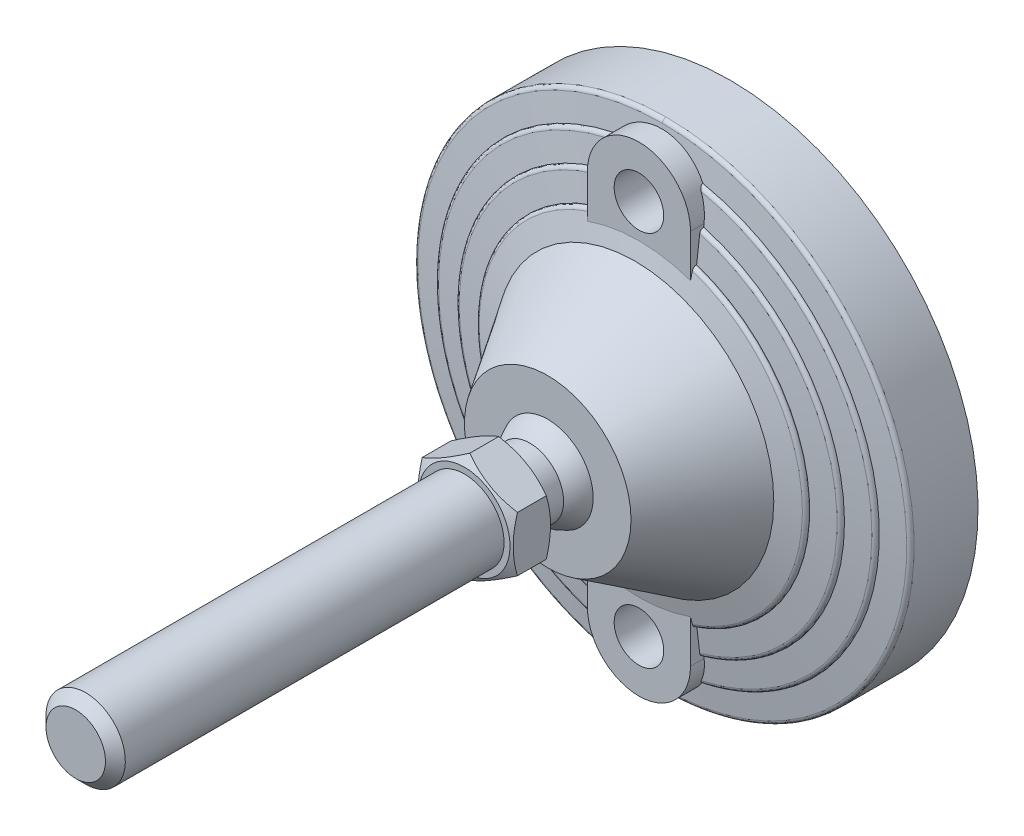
ISO-10303-21;
HEADER;
FILE_DESCRIPTION(('STEP AP214'),'2;1');
FILE_NAME('part.step','',(''),(''),'','','');
FILE_SCHEMA(('AUTOMOTIVE_DESIGN { 1 0 10303 214 1 1 1 1 }'));
ENDSEC;
DATA;
#1=APPLICATION_CONTEXT('core data for automotive mechanical design processes');
#2=APPLICATION_PROTOCOL_DEFINITION('international standard','automotive_design',2000,#1);
#3=PRODUCT_CONTEXT('',#1,'mechanical');
#4=PRODUCT('Part','Part','',(#3));
#5=PRODUCT_RELATED_PRODUCT_CATEGORY('part','',(#4));
#6=PRODUCT_DEFINITION_FORMATION('','',#4);
#7=PRODUCT_DEFINITION_CONTEXT('part definition',#1,'design');
#8=PRODUCT_DEFINITION('design','',#6,#7);
#9=PRODUCT_DEFINITION_SHAPE('','',#8);
#10=(LENGTH_UNIT() NAMED_UNIT(*) SI_UNIT(.MILLI.,.METRE.));
#11=(NAMED_UNIT(*) PLANE_ANGLE_UNIT() SI_UNIT($,.RADIAN.));
#12=(NAMED_UNIT(*) SI_UNIT($,.STERADIAN.) SOLID_ANGLE_UNIT());
#13=UNCERTAINTY_MEASURE_WITH_UNIT(LENGTH_MEASURE(1.E-05),#10,'distance_accuracy_value','');
#14=(GEOMETRIC_REPRESENTATION_CONTEXT(3) GLOBAL_UNCERTAINTY_ASSIGNED_CONTEXT((#13)) GLOBAL_UNIT_ASSIGNED_CONTEXT((#10,
#11,#12)) REPRESENTATION_CONTEXT('',''));
#15=CARTESIAN_POINT('',(0.,0.,0.));
#16=DIRECTION('',(0.,0.,1.));
#17=DIRECTION('',(1.,0.,0.));
#18=AXIS2_PLACEMENT_3D('',#15,#16,#17);
#19=CARTESIAN_POINT('',(-12.,14.022683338,57.));
#20=DIRECTION('',(0.,0.,1.));
#21=DIRECTION('',(0.,-1.,0.));
#22=AXIS2_PLACEMENT_3D('',#19,#20,#21);
#23=PLANE('',#22);
#24=CARTESIAN_POINT('',(0.,0.,57.));
#25=DIRECTION('',(0.,0.,-1.));
#26=DIRECTION('',(0.,1.,0.));
#27=AXIS2_PLACEMENT_3D('',#24,#25,#26);
#28=CIRCLE('',#27,11.5);
#29=CARTESIAN_POINT('',(0.,11.5,57.));
#30=VERTEX_POINT('',#29);
#31=EDGE_CURVE('E212',#30,#30,#28,.T.);
#32=ORIENTED_EDGE('',*,*,#31,.T.);
#33=EDGE_LOOP('',(#32));
#34=FACE_BOUND('',#33,.T.);
#35=CARTESIAN_POINT('',(0.,0.,57.));
#36=DIRECTION('',(0.,0.,-1.));
#37=DIRECTION('',(1.,0.,0.));
#38=AXIS2_PLACEMENT_3D('',#35,#36,#37);
#39=CIRCLE('',#38,8.5);
#40=CARTESIAN_POINT('',(8.49999999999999,0.,57.));
#41=VERTEX_POINT('',#40);
#42=EDGE_CURVE('E226',#41,#41,#39,.T.);
#43=ORIENTED_EDGE('',*,*,#42,.F.);
#44=EDGE_LOOP('',(#43));
#45=FACE_BOUND('',#44,.T.);
#46=ADVANCED_FACE('F14',(#34,#45),#23,.F.);
#47=CARTESIAN_POINT('',(0.,0.,57.));
#48=DIRECTION('',(0.,0.,-1.));
#49=DIRECTION('',(1.,0.,0.));
#50=AXIS2_PLACEMENT_3D('',#47,#48,#49);
#51=CYLINDRICAL_SURFACE('',#50,8.5);
#52=CARTESIAN_POINT('',(0.,0.,50.5));
#53=DIRECTION('',(0.,0.,-1.));
#54=DIRECTION('',(1.,0.,0.));
#55=AXIS2_PLACEMENT_3D('',#52,#53,#54);
#56=CIRCLE('',#55,8.5);
#57=CARTESIAN_POINT('',(8.49999999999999,0.,50.5));
#58=VERTEX_POINT('',#57);
#59=EDGE_CURVE('E1304',#58,#58,#56,.F.);
#60=ORIENTED_EDGE('',*,*,#59,.T.);
#61=EDGE_LOOP('',(#60));
#62=FACE_BOUND('',#61,.T.);
#63=ORIENTED_EDGE('',*,*,#42,.T.);
#64=EDGE_LOOP('',(#63));
#65=FACE_BOUND('',#64,.T.);
#66=ADVANCED_FACE('F1024',(#62,#65),#51,.T.);
#67=CARTESIAN_POINT('',(-8.63159921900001,8.622532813,50.5));
#68=DIRECTION('',(0.,0.,1.));
#69=DIRECTION('',(0.,-1.,0.));
#70=AXIS2_PLACEMENT_3D('',#67,#68,#69);
#71=PLANE('',#70);
#72=CARTESIAN_POINT('',(0.,0.,50.5));
#73=DIRECTION('',(0.,0.,-1.));
#74=DIRECTION('',(0.,1.,0.));
#75=AXIS2_PLACEMENT_3D('',#72,#73,#74);
#76=CIRCLE('',#75,8.49107182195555);
#77=CARTESIAN_POINT('',(0.,8.49107182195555,50.5));
#78=VERTEX_POINT('',#77);
#79=EDGE_CURVE('E1306',#78,#78,#76,.T.);
#80=ORIENTED_EDGE('',*,*,#79,.F.);
#81=EDGE_LOOP('',(#80));
#82=FACE_BOUND('',#81,.T.);
#83=ORIENTED_EDGE('',*,*,#59,.F.);
#84=EDGE_LOOP('',(#83));
#85=FACE_BOUND('',#84,.T.);
#86=ADVANCED_FACE('F1015',(#82,#85),#71,.F.);
#87=CARTESIAN_POINT('',(0.,0.,41.670266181));
#88=DIRECTION('',(0.,0.,-1.));
#89=DIRECTION('',(1.,0.,0.));
#90=AXIS2_PLACEMENT_3D('',#87,#88,#89);
#91=SPHERICAL_SURFACE('',#90,12.25);
#92=CARTESIAN_POINT('',(0.,0.,46.));
#93=DIRECTION('',(0.,0.,-1.));
#94=DIRECTION('',(0.,1.,0.));
#95=AXIS2_PLACEMENT_3D('',#92,#93,#94);
#96=CIRCLE('',#95,11.4593152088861);
#97=CARTESIAN_POINT('',(0.,11.4593152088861,46.));
#98=VERTEX_POINT('',#97);
#99=EDGE_CURVE('E450',#98,#98,#96,.F.);
#100=ORIENTED_EDGE('',*,*,#99,.T.);
#101=EDGE_LOOP('',(#100));
#102=FACE_BOUND('',#101,.T.);
#103=ORIENTED_EDGE('',*,*,#79,.T.);
#104=EDGE_LOOP('',(#103));
#105=FACE_BOUND('',#104,.T.);
#106=ADVANCED_FACE('F1007',(#102,#105),#91,.T.);
#107=CARTESIAN_POINT('',(-63.467641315,63.25,0.));
#108=DIRECTION('',(0.,0.,1.));
#109=DIRECTION('',(0.,-1.,0.));
#110=AXIS2_PLACEMENT_3D('',#107,#108,#109);
#111=PLANE('',#110);
#112=CARTESIAN_POINT('',(0.,0.,0.));
#113=DIRECTION('',(0.,0.,-1.));
#114=DIRECTION('',(0.,1.,0.));
#115=AXIS2_PLACEMENT_3D('',#112,#113,#114);
#116=CIRCLE('',#115,62.5);
#117=CARTESIAN_POINT('',(0.,62.5,0.));
#118=VERTEX_POINT('',#117);
#119=EDGE_CURVE('E413',#118,#118,#116,.F.);
#120=ORIENTED_EDGE('',*,*,#119,.F.);
#121=EDGE_LOOP('',(#120));
#122=FACE_BOUND('',#121,.T.);
#123=CARTESIAN_POINT('',(0.,47.5,0.));
#124=DIRECTION('',(0.,0.,-1.));
#125=DIRECTION('',(-1.,0.,0.));
#126=AXIS2_PLACEMENT_3D('',#123,#124,#125);
#127=CIRCLE('',#126,6.25);
#128=CARTESIAN_POINT('',(-6.25,47.5,0.));
#129=VERTEX_POINT('',#128);
#130=EDGE_CURVE('E1291',#129,#129,#127,.T.);
#131=ORIENTED_EDGE('',*,*,#130,.F.);
#132=EDGE_LOOP('',(#131));
#133=FACE_BOUND('',#132,.T.);
#134=CARTESIAN_POINT('',(0.,-47.5,0.));
#135=DIRECTION('',(0.,0.,-1.));
#136=DIRECTION('',(-1.,0.,0.));
#137=AXIS2_PLACEMENT_3D('',#134,#135,#136);
#138=CIRCLE('',#137,6.25);
#139=CARTESIAN_POINT('',(-6.25,-47.5,0.));
#140=VERTEX_POINT('',#139);
#141=EDGE_CURVE('E1288',#140,#140,#138,.T.);
#142=ORIENTED_EDGE('',*,*,#141,.F.);
#143=EDGE_LOOP('',(#142));
#144=FACE_BOUND('',#143,.T.);
#145=ADVANCED_FACE('F999',(#122,#133,#144),#111,.F.);
#146=CARTESIAN_POINT('',(-21.325127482,-21.252,46.));
#147=DIRECTION('',(0.,0.,-1.));
#148=DIRECTION('',(0.,1.,0.));
#149=AXIS2_PLACEMENT_3D('',#146,#147,#148);
#150=PLANE('',#149);
#151=ORIENTED_EDGE('',*,*,#99,.F.);
#152=EDGE_LOOP('',(#151));
#153=FACE_BOUND('',#152,.T.);
#154=CARTESIAN_POINT('',(0.,0.,46.));
#155=DIRECTION('',(0.,0.,-1.));
#156=DIRECTION('',(1.,0.,0.));
#157=AXIS2_PLACEMENT_3D('',#154,#155,#156);
#158=CIRCLE('',#157,21.);
#159=CARTESIAN_POINT('',(21.,0.,46.));
#160=VERTEX_POINT('',#159);
#161=EDGE_CURVE('E719',#160,#160,#158,.T.);
#162=ORIENTED_EDGE('',*,*,#161,.F.);
#163=EDGE_LOOP('',(#162));
#164=FACE_BOUND('',#163,.T.);
#165=ADVANCED_FACE('F335',(#153,#164),#150,.F.);
#166=CARTESIAN_POINT('',(0.,-47.5,0.));
#167=DIRECTION('',(0.,0.,1.));
#168=DIRECTION('',(0.,-1.,0.));
#169=AXIS2_PLACEMENT_3D('',#166,#167,#168);
#170=CYLINDRICAL_SURFACE('',#169,6.25);
#171=ORIENTED_EDGE('',*,*,#141,.T.);
#172=EDGE_LOOP('',(#171));
#173=FACE_BOUND('',#172,.T.);
#174=CARTESIAN_POINT('',(0.,-47.5,23.));
#175=DIRECTION('',(0.,0.,1.));
#176=DIRECTION('',(0.,-1.,0.));
#177=AXIS2_PLACEMENT_3D('',#174,#175,#176);
#178=CIRCLE('',#177,6.25);
#179=CARTESIAN_POINT('',(0.,-53.75,23.));
#180=VERTEX_POINT('',#179);
#181=EDGE_CURVE('E718',#180,#180,#178,.T.);
#182=ORIENTED_EDGE('',*,*,#181,.T.);
#183=EDGE_LOOP('',(#182));
#184=FACE_BOUND('',#183,.T.);
#185=ADVANCED_FACE('F984',(#173,#184),#170,.F.);
#186=CARTESIAN_POINT('',(12.406354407,39.602176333,21.568111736));
#187=CARTESIAN_POINT('',(59.707464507,24.78394183,21.568111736));
#188=CARTESIAN_POINT('',(59.707464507,-24.78394183,21.568111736));
#189=CARTESIAN_POINT('',(12.406354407,-39.602176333,21.568111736));
#190=CARTESIAN_POINT('',(12.406354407,39.602176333,22.044046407));
#191=CARTESIAN_POINT('',(59.707464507,24.78394183,22.044046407));
#192=CARTESIAN_POINT('',(59.707464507,-24.78394183,22.044046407));
#193=CARTESIAN_POINT('',(12.406354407,-39.602176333,22.044046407));
#194=CARTESIAN_POINT('',(12.31903347,39.323440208,22.419805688));
#195=CARTESIAN_POINT('',(59.287219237,24.609502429,22.419805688));
#196=CARTESIAN_POINT('',(59.287219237,-24.609502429,22.419805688));
#197=CARTESIAN_POINT('',(12.31903347,-39.323440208,22.419805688));
#198=CARTESIAN_POINT('',(12.18115046,38.883305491,22.53720891));
#199=CARTESIAN_POINT('',(58.623636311,24.334056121,22.53720891));
#200=CARTESIAN_POINT('',(58.623636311,-24.334056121,22.53720891));
#201=CARTESIAN_POINT('',(12.18115046,-38.883305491,22.53720891));
#202=(BOUNDED_SURFACE() B_SPLINE_SURFACE(3,3,((#186,#187,#188,#189),(#190,#191,#192,#193),(#194,
#195,#196,#197),(#198,#199,#200,#201)),.UNSPECIFIED.,.F.,.F.,
.F.) B_SPLINE_SURFACE_WITH_KNOTS((4,4),(4,4),(0.,1.),(0.,1.),
.UNSPECIFIED.) GEOMETRIC_REPRESENTATION_ITEM() RATIONAL_B_SPLINE_SURFACE(((1.,0.532632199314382,
0.532632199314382,1.),(0.859679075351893,0.457892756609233,0.457892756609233,0.859679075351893),
(0.859679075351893,0.457892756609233,0.457892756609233,0.859679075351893),(1.,0.532632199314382,
0.532632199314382,1.))) REPRESENTATION_ITEM('') SURFACE());
#203=CARTESIAN_POINT('',(0.,0.,22.5372089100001));
#204=DIRECTION('',(0.,0.,-1.));
#205=DIRECTION('',(0.,1.,0.));
#206=AXIS2_PLACEMENT_3D('',#203,#204,#205);
#207=CIRCLE('',#206,40.746679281);
#208=CARTESIAN_POINT('',(13.,-38.6172483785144,22.537208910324));
#209=VERTEX_POINT('',#208);
#210=CARTESIAN_POINT('',(13.,38.6172483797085,22.5372089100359));
#211=VERTEX_POINT('',#210);
#212=EDGE_CURVE('E239',#209,#211,#207,.F.);
#213=CARTESIAN_POINT('',(13.,-39.4112927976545,21.5681117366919));
#214=CARTESIAN_POINT('',(13.,-39.4112933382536,21.59521048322));
#215=CARTESIAN_POINT('',(13.,-39.4101321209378,21.6222958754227));
#216=CARTESIAN_POINT('',(13.,-39.405504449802,21.6762650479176));
#217=CARTESIAN_POINT('',(13.,-39.4020383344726,21.7031488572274));
#218=CARTESIAN_POINT('',(13.,-39.3882336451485,21.7831079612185));
#219=CARTESIAN_POINT('',(13.,-39.3744885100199,21.8356344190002));
#220=CARTESIAN_POINT('',(13.,-39.3384084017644,21.937608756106));
#221=CARTESIAN_POINT('',(13.,-39.3160736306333,21.987056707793));
#222=CARTESIAN_POINT('',(13.,-39.2635909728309,22.0816017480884));
#223=CARTESIAN_POINT('',(13.,-39.233444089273,22.1266993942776));
#224=CARTESIAN_POINT('',(13.,-39.1656058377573,22.2123360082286));
#225=CARTESIAN_POINT('',(13.,-39.1277714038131,22.2527614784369));
#226=CARTESIAN_POINT('',(13.,-39.0461074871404,22.327071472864));
#227=CARTESIAN_POINT('',(13.,-39.0022718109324,22.3609491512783));
#228=CARTESIAN_POINT('',(13.,-38.9043172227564,22.4250520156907));
#229=CARTESIAN_POINT('',(13.,-38.8495953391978,22.454364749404));
#230=CARTESIAN_POINT('',(13.,-38.7644641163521,22.4909906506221));
#231=CARTESIAN_POINT('',(13.,-38.7355751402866,22.5019763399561));
#232=CARTESIAN_POINT('',(13.,-38.6769796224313,22.5214626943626));
#233=CARTESIAN_POINT('',(13.,-38.6472733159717,22.5299640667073));
#234=CARTESIAN_POINT('',(13.,-38.6172483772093,22.5372089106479));
#235=B_SPLINE_CURVE_WITH_KNOTS('',3,(#213,#214,#215,#216,#217,#218,#219,#220,#221,#222,#223,
#224,#225,#226,#227,#228,#229,#230,#231,#232,#233,#234),.UNSPECIFIED.,.F.,.F.,(4,2,2,2,2,2,2,2,
2,2,4),(0.,0.0812450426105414,0.162478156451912,0.32451953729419,0.4865571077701,
0.648573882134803,0.813939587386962,0.979477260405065,1.16468654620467,1.25731455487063,
1.34991616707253),.UNSPECIFIED.);
#236=CARTESIAN_POINT('',(13.,-39.4112927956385,21.568111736));
#237=VERTEX_POINT('',#236);
#238=EDGE_CURVE('E321',#237,#209,#235,.T.);
#239=CARTESIAN_POINT('',(0.,0.,21.568111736));
#240=DIRECTION('',(0.,0.,-1.));
#241=DIRECTION('',(0.,1.,0.));
#242=AXIS2_PLACEMENT_3D('',#239,#240,#241);
#243=CIRCLE('',#242,41.5);
#244=CARTESIAN_POINT('',(13.,39.4112927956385,21.5681117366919));
#245=VERTEX_POINT('',#244);
#246=EDGE_CURVE('E448',#245,#237,#243,.T.);
#247=CARTESIAN_POINT('',(13.,38.6172483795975,22.5372089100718));
#248=CARTESIAN_POINT('',(13.,38.6757273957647,22.5231434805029));
#249=CARTESIAN_POINT('',(13.,38.7330575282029,22.5042077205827));
#250=CARTESIAN_POINT('',(13.,38.843898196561,22.4570874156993));
#251=CARTESIAN_POINT('',(13.,38.8974017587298,22.4288864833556));
#252=CARTESIAN_POINT('',(13.,38.9989209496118,22.3637346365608));
#253=CARTESIAN_POINT('',(13.,39.0469285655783,22.3267711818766));
#254=CARTESIAN_POINT('',(13.,39.1357078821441,22.2450475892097));
#255=CARTESIAN_POINT('',(13.,39.1764870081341,22.2002955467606));
#256=CARTESIAN_POINT('',(13.,39.2479885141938,22.1059931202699));
#257=CARTESIAN_POINT('',(13.,39.2790300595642,22.0566848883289));
#258=CARTESIAN_POINT('',(13.,39.3318958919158,21.9533393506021));
#259=CARTESIAN_POINT('',(13.,39.3537228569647,21.8993034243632));
#260=CARTESIAN_POINT('',(13.,39.3839717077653,21.7991363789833));
#261=CARTESIAN_POINT('',(13.,39.3941848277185,21.7535382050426));
#262=CARTESIAN_POINT('',(13.,39.4078594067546,21.6613400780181));
#263=CARTESIAN_POINT('',(13.,39.411320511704,21.6147400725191));
#264=CARTESIAN_POINT('',(13.,39.4112927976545,21.5681117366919));
#265=B_SPLINE_CURVE_WITH_KNOTS('',3,(#247,#248,#249,#250,#251,#252,#253,#254,#255,#256,#257,
#258,#259,#260,#261,#262,#263,#264),.UNSPECIFIED.,.F.,.F.,(4,2,2,2,2,2,2,2,4),(0.,
0.180276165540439,0.360872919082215,0.54172970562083,0.722399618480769,0.896310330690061,
1.07017046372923,1.20986980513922,1.34957647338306),.UNSPECIFIED.);
#266=EDGE_CURVE('E238',#211,#245,#265,.T.);
#267=ORIENTED_EDGE('',*,*,#212,.F.);
#268=ORIENTED_EDGE('',*,*,#238,.F.);
#269=ORIENTED_EDGE('',*,*,#246,.F.);
#270=ORIENTED_EDGE('',*,*,#266,.F.);
#271=EDGE_LOOP('',(#267,#268,#269,#270));
#272=FACE_BOUND('',#271,.T.);
#273=ADVANCED_FACE('F917',(#272),#202,.T.);
#274=CARTESIAN_POINT('',(0.,0.,21.568111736));
#275=DIRECTION('',(0.,0.,-1.));
#276=DIRECTION('',(0.,1.,0.));
#277=AXIS2_PLACEMENT_3D('',#274,#275,#276);
#278=CYLINDRICAL_SURFACE('',#277,41.5);
#279=CARTESIAN_POINT('',(0.,0.,21.4545454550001));
#280=DIRECTION('',(0.,0.,-1.));
#281=DIRECTION('',(0.,1.,0.));
#282=AXIS2_PLACEMENT_3D('',#279,#280,#281);
#283=CIRCLE('',#282,41.5);
#284=CARTESIAN_POINT('',(13.,39.4112927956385,21.4545454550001));
#285=VERTEX_POINT('',#284);
#286=CARTESIAN_POINT('',(13.,-39.4112927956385,21.4545454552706));
#287=VERTEX_POINT('',#286);
#288=EDGE_CURVE('E446',#285,#287,#283,.T.);
#289=ORIENTED_EDGE('',*,*,#288,.F.);
#290=DIRECTION('',(0.,0.,-1.));
#291=VECTOR('',#290,1.);
#292=CARTESIAN_POINT('',(13.,39.4112927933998,21.2785712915));
#293=LINE('',#292,#291);
#294=EDGE_CURVE('E291',#245,#285,#293,.T.);
#295=ORIENTED_EDGE('',*,*,#294,.F.);
#296=ORIENTED_EDGE('',*,*,#246,.T.);
#297=DIRECTION('',(0.,0.,1.));
#298=VECTOR('',#297,1.);
#299=CARTESIAN_POINT('',(13.,-39.4112927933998,21.2785712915));
#300=LINE('',#299,#298);
#301=EDGE_CURVE('E319',#287,#237,#300,.T.);
#302=ORIENTED_EDGE('',*,*,#301,.F.);
#303=EDGE_LOOP('',(#289,#295,#296,#302));
#304=FACE_BOUND('',#303,.T.);
#305=ADVANCED_FACE('F303',(#304),#278,.T.);
#306=CARTESIAN_POINT('',(0.,0.,21.454545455));
#307=DIRECTION('',(0.,0.,-1.));
#308=DIRECTION('',(0.,1.,0.));
#309=AXIS2_PLACEMENT_3D('',#306,#307,#308);
#310=CONICAL_SURFACE('',#309,41.5,1.4442041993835);
#311=ORIENTED_EDGE('',*,*,#288,.T.);
#312=CARTESIAN_POINT('',(13.0000000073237,-45.8176832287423,20.674840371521));
#313=CARTESIAN_POINT('',(13.0000000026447,-45.2838642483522,20.7402005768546));
#314=CARTESIAN_POINT('',(13.000000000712,-44.7500350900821,20.8054777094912));
#315=CARTESIAN_POINT('',(12.999999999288,-43.6823542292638,20.9358466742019));
#316=CARTESIAN_POINT('',(12.9999999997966,-43.1485025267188,21.0009385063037));
#317=CARTESIAN_POINT('',(13.0000000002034,-42.0807742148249,21.1309177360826));
#318=CARTESIAN_POINT('',(13.0000000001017,-41.5468976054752,21.195805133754));
#319=CARTESIAN_POINT('',(12.9999999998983,-40.4791166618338,21.3253520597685));
#320=CARTESIAN_POINT('',(12.9999999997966,-39.9452123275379,21.3900115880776));
#321=CARTESIAN_POINT('',(13.,-39.4112927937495,21.4545454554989));
#322=B_SPLINE_CURVE_WITH_KNOTS('',3,(#312,#313,#314,#315,#316,#317,#318,#319,#320,#321),
.UNSPECIFIED.,.F.,.F.,(4,2,2,2,4),(0.,1.61341623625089,3.22683223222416,4.84024827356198,
6.45366455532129),.UNSPECIFIED.);
#323=CARTESIAN_POINT('',(13.,-45.8176832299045,20.6748403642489));
#324=VERTEX_POINT('',#323);
#325=EDGE_CURVE('E311',#324,#287,#322,.T.);
#326=ORIENTED_EDGE('',*,*,#325,.F.);
#327=CARTESIAN_POINT('',(-7.4856174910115E-10,0.,20.674840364));
#328=DIRECTION('',(0.,0.,-1.));
#329=DIRECTION('',(0.,1.,0.));
#330=AXIS2_PLACEMENT_3D('',#327,#328,#329);
#331=CIRCLE('',#330,47.6262542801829);
#332=CARTESIAN_POINT('',(13.,45.8176832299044,20.6748403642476));
#333=VERTEX_POINT('',#332);
#334=EDGE_CURVE('E411',#333,#324,#331,.T.);
#335=ORIENTED_EDGE('',*,*,#334,.F.);
#336=CARTESIAN_POINT('',(13.,39.4112927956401,21.4545454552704));
#337=CARTESIAN_POINT('',(13.,39.9452123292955,21.3900115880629));
#338=CARTESIAN_POINT('',(13.,40.4791166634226,21.3253520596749));
#339=CARTESIAN_POINT('',(13.,41.5468976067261,21.195805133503));
#340=CARTESIAN_POINT('',(13.,42.0807742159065,21.1309177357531));
#341=CARTESIAN_POINT('',(13.,43.1485025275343,21.0009385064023));
#342=CARTESIAN_POINT('',(13.,43.6823542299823,20.9358466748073));
#343=CARTESIAN_POINT('',(13.,44.7500350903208,20.805477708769));
#344=CARTESIAN_POINT('',(13.,45.283864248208,20.7402005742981));
#345=CARTESIAN_POINT('',(13.,45.8176832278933,20.6748403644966));
#346=B_SPLINE_CURVE_WITH_KNOTS('',3,(#336,#337,#338,#339,#340,#341,#342,#343,#344,#345),
.UNSPECIFIED.,.F.,.F.,(4,2,2,2,4),(0.,1.61341628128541,3.22683232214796,4.84024831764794,
6.45366455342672),.UNSPECIFIED.);
#347=EDGE_CURVE('E283',#285,#333,#346,.T.);
#348=ORIENTED_EDGE('',*,*,#347,.F.);
#349=EDGE_LOOP('',(#311,#326,#335,#348));
#350=FACE_BOUND('',#349,.T.);
#351=ADVANCED_FACE('F298',(#350),#310,.T.);
#352=CARTESIAN_POINT('',(12.269850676,46.922284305,19.669623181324));
#353=CARTESIAN_POINT('',(72.557631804,31.157449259,19.669623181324));
#354=CARTESIAN_POINT('',(72.557631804,-31.157449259,19.669623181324));
#355=CARTESIAN_POINT('',(12.269850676,-46.922284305,19.669623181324));
#356=CARTESIAN_POINT('',(12.269850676,46.922284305,19.6740296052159));
#357=CARTESIAN_POINT('',(72.557631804,31.157449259,19.674029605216));
#358=CARTESIAN_POINT('',(72.557631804,-31.157449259,19.674029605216));
#359=CARTESIAN_POINT('',(12.269850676,-46.922284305,19.6740296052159));
#360=CARTESIAN_POINT('',(12.269850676,46.922284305,19.678436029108));
#361=CARTESIAN_POINT('',(72.557631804,31.157449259,19.678436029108));
#362=CARTESIAN_POINT('',(72.557631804,-31.157449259,19.678436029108));
#363=CARTESIAN_POINT('',(12.269850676,-46.922284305,19.678436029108));
#364=CARTESIAN_POINT('',(12.269850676,46.922284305,19.682842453));
#365=CARTESIAN_POINT('',(72.557631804,31.157449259,19.682842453));
#366=CARTESIAN_POINT('',(72.557631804,-31.157449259,19.682842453));
#367=CARTESIAN_POINT('',(12.269850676,-46.922284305,19.682842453));
#368=CARTESIAN_POINT('',(12.269850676,46.922284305,20.211436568));
#369=CARTESIAN_POINT('',(72.557631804,31.157449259,20.211436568));
#370=CARTESIAN_POINT('',(72.557631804,-31.157449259,20.211436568));
#371=CARTESIAN_POINT('',(12.269850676,-46.922284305,20.211436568));
#372=CARTESIAN_POINT('',(12.181461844,46.584268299,20.608103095));
#373=CARTESIAN_POINT('',(72.034945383,30.93299905,20.608103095));
#374=CARTESIAN_POINT('',(72.034945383,-30.93299905,20.608103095));
#375=CARTESIAN_POINT('',(12.181461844,-46.584268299,20.608103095));
#376=CARTESIAN_POINT('',(12.048804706,46.076961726,20.674840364));
#377=CARTESIAN_POINT('',(71.250478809,30.596136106,20.674840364));
#378=CARTESIAN_POINT('',(71.250478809,-30.596136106,20.674840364));
#379=CARTESIAN_POINT('',(12.048804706,-46.076961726,20.674840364));
#380=(BOUNDED_SURFACE() B_SPLINE_SURFACE(3,3,((#352,#353,#354,#355),(#356,#357,#358,#359),(#360,
#361,#362,#363),(#364,#365,#366,#367),(#368,#369,#370,#371),(#372,#373,#374,#375),(#376,#377,
#378,#379)),.UNSPECIFIED.,.F.,.F.,.F.) B_SPLINE_SURFACE_WITH_KNOTS((4,3,4),(4,4),(-0.01,0.,1.),
(0.,1.),.UNSPECIFIED.) GEOMETRIC_REPRESENTATION_ITEM() RATIONAL_B_SPLINE_SURFACE(((1.,
0.501991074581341,0.501991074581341,1.),(1.,0.501991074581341,0.501991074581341,1.),(1.,
0.501991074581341,0.501991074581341,1.),(1.,0.501991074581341,0.501991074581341,1.),
(0.833611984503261,0.418465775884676,0.418465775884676,0.833611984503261),(0.833611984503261,
0.418465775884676,0.418465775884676,0.833611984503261),(1.,0.501991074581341,0.501991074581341,1.))) REPRESENTATION_ITEM('') SURFACE());
#381=CARTESIAN_POINT('',(13.,-46.7252608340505,19.6777848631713));
#382=CARTESIAN_POINT('',(13.,-46.7253979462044,19.7054287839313));
#383=CARTESIAN_POINT('',(13.,-46.7243484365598,19.7330653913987));
#384=CARTESIAN_POINT('',(13.,-46.7198870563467,19.7881439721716));
#385=CARTESIAN_POINT('',(13.,-46.7164754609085,19.8155859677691));
#386=CARTESIAN_POINT('',(13.,-46.7027375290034,19.8972169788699));
#387=CARTESIAN_POINT('',(13.,-46.688908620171,19.9508576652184));
#388=CARTESIAN_POINT('',(13.,-46.6523707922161,20.0550506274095));
#389=CARTESIAN_POINT('',(13.,-46.629652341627,20.1055995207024));
#390=CARTESIAN_POINT('',(13.,-46.5760978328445,20.2021956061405));
#391=CARTESIAN_POINT('',(13.,-46.545261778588,20.248242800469));
#392=CARTESIAN_POINT('',(13.,-46.4762858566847,20.3348542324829));
#393=CARTESIAN_POINT('',(13.,-46.438110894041,20.3753904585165));
#394=CARTESIAN_POINT('',(13.,-46.3556866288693,20.4497572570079));
#395=CARTESIAN_POINT('',(13.,-46.3114344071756,20.4835845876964));
#396=CARTESIAN_POINT('',(13.,-46.2164675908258,20.5448274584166));
#397=CARTESIAN_POINT('',(13.,-46.1655796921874,20.5719736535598));
#398=CARTESIAN_POINT('',(13.,-46.0601083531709,20.6176355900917));
#399=CARTESIAN_POINT('',(13.,-46.0055288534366,20.6361603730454));
#400=CARTESIAN_POINT('',(13.,-45.9281089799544,20.6556819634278));
#401=CARTESIAN_POINT('',(13.,-45.9061721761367,20.660484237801));
#402=CARTESIAN_POINT('',(13.,-45.8620822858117,20.6686997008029));
#403=CARTESIAN_POINT('',(13.,-45.8399296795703,20.6721154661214));
#404=CARTESIAN_POINT('',(13.0000000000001,-45.817683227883,20.6748403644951));
#405=B_SPLINE_CURVE_WITH_KNOTS('',3,(#381,#382,#383,#384,#385,#386,#387,#388,#389,#390,#391,
#392,#393,#394,#395,#396,#397,#398,#399,#400,#401,#402,#403,#404),.UNSPECIFIED.,.F.,.F.,(4,2,2,
2,2,2,2,2,2,2,2,4),(0.,0.0828810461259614,0.165752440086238,0.331061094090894,0.496547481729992,
0.662033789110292,0.828332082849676,0.994710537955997,1.16697834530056,1.33906508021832,
1.40639957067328,1.47360834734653),.UNSPECIFIED.);
#406=CARTESIAN_POINT('',(13.0000000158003,-46.7252608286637,19.6777848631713));
#407=VERTEX_POINT('',#406);
#408=EDGE_CURVE('E320',#407,#324,#405,.T.);
#409=CARTESIAN_POINT('',(13.0000000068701,46.7252608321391,19.6727272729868));
#410=CARTESIAN_POINT('',(13.3212147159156,46.635891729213,19.6727272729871));
#411=CARTESIAN_POINT('',(13.6414983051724,46.5432129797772,19.6727272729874));
#412=CARTESIAN_POINT('',(14.2801231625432,46.3512597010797,19.672727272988));
#413=CARTESIAN_POINT('',(14.5984642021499,46.2519844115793,19.6727272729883));
#414=CARTESIAN_POINT('',(15.5526106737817,45.9435979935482,19.6727272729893));
#415=CARTESIAN_POINT('',(16.1852411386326,45.7245656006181,19.6727272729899));
#416=CARTESIAN_POINT('',(17.4409289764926,45.2604918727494,19.6727272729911));
#417=CARTESIAN_POINT('',(18.0639854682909,45.01544815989,19.6727272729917));
#418=CARTESIAN_POINT('',(19.3000708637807,44.4995075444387,19.672727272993));
#419=CARTESIAN_POINT('',(19.9130888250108,44.228584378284,19.6727272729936));
#420=CARTESIAN_POINT('',(21.1274202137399,43.6615551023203,19.6727272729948));
#421=CARTESIAN_POINT('',(21.7287319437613,43.3654453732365,19.6727272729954));
#422=CARTESIAN_POINT('',(23.5288179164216,42.4321391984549,19.6727272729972));
#423=CARTESIAN_POINT('',(24.7079785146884,41.7565378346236,19.6727272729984));
#424=CARTESIAN_POINT('',(27.0057517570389,40.308619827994,19.6727272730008));
#425=CARTESIAN_POINT('',(28.1243409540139,39.5362661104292,19.672727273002));
#426=CARTESIAN_POINT('',(30.294054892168,37.8994558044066,19.6727272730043));
#427=CARTESIAN_POINT('',(31.3451007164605,37.0348945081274,19.6727272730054));
#428=CARTESIAN_POINT('',(33.3707378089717,35.2206260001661,19.6727272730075));
#429=CARTESIAN_POINT('',(34.3453363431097,34.2709268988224,19.6727272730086));
#430=CARTESIAN_POINT('',(36.2141318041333,32.2900336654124,19.6727272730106));
#431=CARTESIAN_POINT('',(37.1080775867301,31.258602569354,19.6727272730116));
#432=CARTESIAN_POINT('',(38.8059105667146,29.1240638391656,19.6727272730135));
#433=CARTESIAN_POINT('',(39.6097954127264,28.0209543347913,19.6727272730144));
#434=CARTESIAN_POINT('',(41.1215543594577,25.7512426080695,19.6727272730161));
#435=CARTESIAN_POINT('',(41.8294551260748,24.5846581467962,19.6727272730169));
#436=CARTESIAN_POINT('',(43.1444737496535,22.1960153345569,19.6727272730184));
#437=CARTESIAN_POINT('',(43.7515922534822,20.9739573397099,19.6727272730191));
#438=CARTESIAN_POINT('',(44.8608053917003,18.482892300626,19.6727272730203));
#439=CARTESIAN_POINT('',(45.362887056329,17.2138794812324,19.6727272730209));
#440=CARTESIAN_POINT('',(46.2583633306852,14.6380667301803,19.672727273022));
#441=CARTESIAN_POINT('',(46.6517577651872,13.331266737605,19.6727272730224));
#442=CARTESIAN_POINT('',(47.3270705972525,10.6891374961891,19.6727272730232));
#443=CARTESIAN_POINT('',(47.6089860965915,9.3538075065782,19.6727272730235));
#444=CARTESIAN_POINT('',(48.0593220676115,6.66414532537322,19.672727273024));
#445=CARTESIAN_POINT('',(48.2277425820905,5.30981314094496,19.6727272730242));
#446=CARTESIAN_POINT('',(48.4498861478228,2.5918387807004,19.6727272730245));
#447=CARTESIAN_POINT('',(48.5036145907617,1.2281970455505,19.6727272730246));
#448=CARTESIAN_POINT('',(48.4960080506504,-1.49876561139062,19.6727272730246));
#449=CARTESIAN_POINT('',(48.4346730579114,-2.86208653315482,19.6727272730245));
#450=CARTESIAN_POINT('',(48.1973677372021,-5.57880747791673,19.6727272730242));
#451=CARTESIAN_POINT('',(48.021389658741,-6.93220682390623,19.672727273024));
#452=CARTESIAN_POINT('',(47.5560413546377,-9.61936956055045,19.6727272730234));
#453=CARTESIAN_POINT('',(47.2666711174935,-10.9531329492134,19.6727272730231));
#454=CARTESIAN_POINT('',(46.5765756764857,-13.5916227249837,19.6727272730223));
#455=CARTESIAN_POINT('',(46.175843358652,-14.8963472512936,19.6727272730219));
#456=CARTESIAN_POINT('',(45.2658742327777,-17.467402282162,19.6727272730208));
#457=CARTESIAN_POINT('',(44.7566374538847,-18.7337327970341,19.6727272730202));
#458=CARTESIAN_POINT('',(43.6334165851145,-21.218718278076,19.6727272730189));
#459=CARTESIAN_POINT('',(43.0194530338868,-22.4373825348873,19.6727272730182));
#460=CARTESIAN_POINT('',(41.6909757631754,-24.8187625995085,19.6727272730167));
#461=CARTESIAN_POINT('',(40.9764619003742,-25.9814783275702,19.6727272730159));
#462=CARTESIAN_POINT('',(39.7063025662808,-27.8655028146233,19.6727272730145));
#463=CARTESIAN_POINT('',(39.1770724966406,-28.6047764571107,19.6727272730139));
#464=CARTESIAN_POINT('',(38.0778809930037,-30.052466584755,19.6727272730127));
#465=CARTESIAN_POINT('',(37.5079195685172,-30.7608830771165,19.6727272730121));
#466=CARTESIAN_POINT('',(36.3291070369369,-32.1445499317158,19.6727272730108));
#467=CARTESIAN_POINT('',(35.7202564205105,-32.8198007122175,19.6727272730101));
#468=CARTESIAN_POINT('',(34.4653645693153,-34.1352484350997,19.6727272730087));
#469=CARTESIAN_POINT('',(33.8193109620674,-34.7754335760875,19.672727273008));
#470=CARTESIAN_POINT('',(32.4922294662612,-36.0184899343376,19.6727272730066));
#471=CARTESIAN_POINT('',(31.8112009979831,-36.6213605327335,19.6727272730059));
#472=CARTESIAN_POINT('',(30.4163089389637,-37.7878929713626,19.6727272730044));
#473=CARTESIAN_POINT('',(29.7024437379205,-38.351552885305,19.6727272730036));
#474=CARTESIAN_POINT('',(28.1769516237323,-39.4879139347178,19.672727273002));
#475=CARTESIAN_POINT('',(27.3623770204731,-40.0566641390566,19.6727272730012));
#476=CARTESIAN_POINT('',(25.6997855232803,-41.143132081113,19.6727272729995));
#477=CARTESIAN_POINT('',(24.8517655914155,-41.6608451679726,19.6727272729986));
#478=CARTESIAN_POINT('',(23.1254909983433,-42.6432641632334,19.6727272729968));
#479=CARTESIAN_POINT('',(22.2472346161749,-43.1079670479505,19.6727272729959));
#480=CARTESIAN_POINT('',(20.4623876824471,-43.9832963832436,19.6727272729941));
#481=CARTESIAN_POINT('',(19.5557530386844,-44.3938329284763,19.6727272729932));
#482=CARTESIAN_POINT('',(17.7189637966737,-45.1583612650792,19.6727272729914));
#483=CARTESIAN_POINT('',(16.7888095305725,-45.5123538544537,19.6727272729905));
#484=CARTESIAN_POINT('',(14.9085132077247,-46.1625049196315,19.6727272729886));
#485=CARTESIAN_POINT('',(13.9583713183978,-46.4586638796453,19.6727272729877));
#486=CARTESIAN_POINT('',(13.0000000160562,-46.7252608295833,19.6727272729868));
#487=B_SPLINE_CURVE_WITH_KNOTS('',3,(#409,#410,#411,#412,#413,#414,#415,#416,#417,#418,#419,
#420,#421,#422,#423,#424,#425,#426,#427,#428,#429,#430,#431,#432,#433,#434,#435,#436,#437,#438,
#439,#440,#441,#442,#443,#444,#445,#446,#447,#448,#449,#450,#451,#452,#453,#454,#455,#456,#457,
#458,#459,#460,#461,#462,#463,#464,#465,#466,#467,#468,#469,#470,#471,#472,#473,#474,#475,#476,
#477,#478,#479,#480,#481,#482,#483,#484,#485,#486),.UNSPECIFIED.,.F.,.F.,(4,2,2,2,2,2,2,2,2,2,2,
2,2,2,2,2,2,2,2,2,2,2,2,2,2,2,2,2,2,2,2,2,2,2,2,2,2,2,4),(0.,1.00020816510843,2.00053180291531,
4.00833027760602,6.01631246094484,8.02635452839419,10.0366859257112,14.1084282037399,
18.1817355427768,22.2597186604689,26.3373137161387,30.4271967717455,34.5171865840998,
38.6060377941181,42.6948627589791,46.7841923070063,50.8735284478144,54.9629708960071,
59.0524118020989,63.1416604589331,67.2309094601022,71.3204349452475,75.4099608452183,
79.499748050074,83.5895341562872,87.6785191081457,91.767509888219,94.4937471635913,
97.2199838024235,99.9461860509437,102.673300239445,105.400459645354,108.12775293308,
111.106299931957,114.085118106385,117.064106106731,120.047978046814,123.031807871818,
126.015612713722),.UNSPECIFIED.);
#488=CARTESIAN_POINT('',(13.0000000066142,46.7252608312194,19.6777848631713));
#489=VERTEX_POINT('',#488);
#490=EDGE_CURVE('E395',#489,#407,#487,.T.);
#491=CARTESIAN_POINT('',(13.,45.8176832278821,20.6748403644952));
#492=CARTESIAN_POINT('',(13.,45.8768916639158,20.6676266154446));
#493=CARTESIAN_POINT('',(13.,45.9354849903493,20.655431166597));
#494=CARTESIAN_POINT('',(13.,46.0498761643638,20.6214764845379));
#495=CARTESIAN_POINT('',(13.,46.1056719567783,20.5997103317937));
#496=CARTESIAN_POINT('',(13.,46.2128716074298,20.5469963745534));
#497=CARTESIAN_POINT('',(13.,46.2642705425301,20.5160384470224));
#498=CARTESIAN_POINT('',(13.,46.336724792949,20.4633763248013));
#499=CARTESIAN_POINT('',(13.,46.3600988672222,20.4447881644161));
#500=CARTESIAN_POINT('',(13.,46.405165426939,20.405625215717));
#501=CARTESIAN_POINT('',(13.,46.4268560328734,20.3850482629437));
#502=CARTESIAN_POINT('',(13.,46.4880645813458,20.3216088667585));
#503=CARTESIAN_POINT('',(13.,46.5249454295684,20.2761439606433));
#504=CARTESIAN_POINT('',(13.,46.5901806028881,20.1794685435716));
#505=CARTESIAN_POINT('',(13.,46.6185381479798,20.1282602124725));
#506=CARTESIAN_POINT('',(13.,46.653488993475,20.049293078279));
#507=CARTESIAN_POINT('',(13.,46.6637514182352,20.0231112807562));
#508=CARTESIAN_POINT('',(13.,46.6819716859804,19.9699855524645));
#509=CARTESIAN_POINT('',(13.,46.6899313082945,19.9430422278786));
#510=CARTESIAN_POINT('',(13.,46.7102220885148,19.8614024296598));
#511=CARTESIAN_POINT('',(13.,46.7190275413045,19.8057552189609));
#512=CARTESIAN_POINT('',(13.,46.7237631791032,19.737878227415));
#513=CARTESIAN_POINT('',(13.,46.7243742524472,19.7258595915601));
#514=CARTESIAN_POINT('',(13.,46.7251497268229,19.7018236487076));
#515=CARTESIAN_POINT('',(13.,46.7253147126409,19.6898063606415));
#516=CARTESIAN_POINT('',(13.,46.7252608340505,19.6777848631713));
#517=B_SPLINE_CURVE_WITH_KNOTS('',3,(#491,#492,#493,#494,#495,#496,#497,#498,#499,#500,#501,
#502,#503,#504,#505,#506,#507,#508,#509,#510,#511,#512,#513,#514,#515,#516),.UNSPECIFIED.,.F.,
.F.,(4,2,2,2,2,2,2,2,2,2,2,2,4),(0.,0.178718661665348,0.357566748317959,0.536612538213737,
0.626107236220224,0.715700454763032,0.89039685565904,1.06502717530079,1.14929679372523,
1.23350112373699,1.40145319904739,1.43755286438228,1.47360518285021),.UNSPECIFIED.);
#518=EDGE_CURVE('E290',#333,#489,#517,.T.);
#519=ORIENTED_EDGE('',*,*,#334,.T.);
#520=ORIENTED_EDGE('',*,*,#408,.F.);
#521=ORIENTED_EDGE('',*,*,#490,.F.);
#522=ORIENTED_EDGE('',*,*,#518,.F.);
#523=EDGE_LOOP('',(#519,#520,#521,#522));
#524=FACE_BOUND('',#523,.T.);
#525=ADVANCED_FACE('F302',(#524),#380,.T.);
#526=CARTESIAN_POINT('',(0.,62.5,16.119206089));
#527=CARTESIAN_POINT('',(125.,62.5,16.119206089));
#528=CARTESIAN_POINT('',(125.,-62.5,16.119206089));
#529=CARTESIAN_POINT('',(0.,-62.5,16.119206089));
#530=CARTESIAN_POINT('',(0.,62.5,16.647800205));
#531=CARTESIAN_POINT('',(125.,62.5000000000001,16.647800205));
#532=CARTESIAN_POINT('',(125.,-62.5000000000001,16.647800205));
#533=CARTESIAN_POINT('',(0.,-62.5,16.647800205));
#534=CARTESIAN_POINT('',(0.,62.1506185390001,17.044466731));
#535=CARTESIAN_POINT('',(124.301237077,62.150618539,17.044466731));
#536=CARTESIAN_POINT('',(124.301237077,-62.150618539,17.044466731));
#537=CARTESIAN_POINT('',(0.,-62.1506185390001,17.044466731));
#538=CARTESIAN_POINT('',(0.,61.62625428,17.111204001));
#539=CARTESIAN_POINT('',(123.252508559,61.6262542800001,17.111204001));
#540=CARTESIAN_POINT('',(123.252508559,-61.6262542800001,17.111204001));
#541=CARTESIAN_POINT('',(0.,-61.62625428,17.111204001));
#542=(BOUNDED_SURFACE() B_SPLINE_SURFACE(3,3,((#526,#527,#528,#529),(#530,#531,#532,#533),(#534,
#535,#536,#537),(#538,#539,#540,#541)),.UNSPECIFIED.,.F.,.F.,
.F.) B_SPLINE_SURFACE_WITH_KNOTS((4,4),(4,4),(0.,1.),(0.,1.),
.UNSPECIFIED.) GEOMETRIC_REPRESENTATION_ITEM() RATIONAL_B_SPLINE_SURFACE(((1.,0.333333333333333,
0.333333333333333,1.),(0.833611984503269,0.27787066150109,0.27787066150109,0.833611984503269),
(0.833611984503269,0.27787066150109,0.27787066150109,0.833611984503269),(1.,0.333333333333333,
0.333333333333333,1.))) REPRESENTATION_ITEM('') SURFACE());
#543=CARTESIAN_POINT('',(0.,0.,16.119206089));
#544=DIRECTION('',(0.,0.,1.));
#545=DIRECTION('',(0.,-1.,0.));
#546=AXIS2_PLACEMENT_3D('',#543,#544,#545);
#547=CIRCLE('',#546,62.5);
#548=CARTESIAN_POINT('',(-9.61422587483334E-09,-62.5,16.119206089));
#549=VERTEX_POINT('',#548);
#550=CARTESIAN_POINT('',(-2.80605355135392E-09,62.5,16.119206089));
#551=VERTEX_POINT('',#550);
#552=EDGE_CURVE('E710',#549,#551,#547,.T.);
#553=CARTESIAN_POINT('',(0.,62.5,16.119206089));
#554=CARTESIAN_POINT('',(0.,62.5,16.647800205));
#555=CARTESIAN_POINT('',(0.,62.1506185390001,17.044466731));
#556=CARTESIAN_POINT('',(0.,61.62625428,17.111204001));
#557=(BOUNDED_CURVE() B_SPLINE_CURVE(3,(#553,#554,#555,#556),.UNSPECIFIED.,.F.,
.F.) B_SPLINE_CURVE_WITH_KNOTS((4,4),(0.,1.),
.UNSPECIFIED.) CURVE() GEOMETRIC_REPRESENTATION_ITEM() RATIONAL_B_SPLINE_CURVE((1.,
0.833611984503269,0.833611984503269,1.)) REPRESENTATION_ITEM(''));
#558=CARTESIAN_POINT('',(-8.30047029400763E-09,61.6262542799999,17.1112040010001));
#559=VERTEX_POINT('',#558);
#560=EDGE_CURVE('E432',#559,#551,#557,.F.);
#561=CARTESIAN_POINT('',(0.,0.,17.1112040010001));
#562=DIRECTION('',(0.,0.,-1.));
#563=DIRECTION('',(0.,1.,0.));
#564=AXIS2_PLACEMENT_3D('',#561,#562,#563);
#565=CIRCLE('',#564,61.62625428);
#566=CARTESIAN_POINT('',(-1.57996978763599E-08,-61.6262542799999,17.1112040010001));
#567=VERTEX_POINT('',#566);
#568=EDGE_CURVE('E722',#567,#559,#565,.F.);
#569=CARTESIAN_POINT('',(0.,-62.5,16.119206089));
#570=CARTESIAN_POINT('',(0.,-62.5,16.647800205));
#571=CARTESIAN_POINT('',(0.,-62.1506185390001,17.044466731));
#572=CARTESIAN_POINT('',(0.,-61.62625428,17.111204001));
#573=(BOUNDED_CURVE() B_SPLINE_CURVE(3,(#569,#570,#571,#572),.UNSPECIFIED.,.F.,
.F.) B_SPLINE_CURVE_WITH_KNOTS((4,4),(0.,1.),
.UNSPECIFIED.) CURVE() GEOMETRIC_REPRESENTATION_ITEM() RATIONAL_B_SPLINE_CURVE((1.,
0.833611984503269,0.833611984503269,1.)) REPRESENTATION_ITEM(''));
#574=EDGE_CURVE('E438',#549,#567,#573,.T.);
#575=ORIENTED_EDGE('',*,*,#552,.T.);
#576=ORIENTED_EDGE('',*,*,#560,.F.);
#577=ORIENTED_EDGE('',*,*,#568,.F.);
#578=ORIENTED_EDGE('',*,*,#574,.F.);
#579=EDGE_LOOP('',(#575,#576,#577,#578));
#580=FACE_BOUND('',#579,.T.);
#581=ADVANCED_FACE('F944',(#580),#542,.T.);
#582=CARTESIAN_POINT('',(0.,0.,16.119206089));
#583=DIRECTION('',(0.,0.,-1.));
#584=DIRECTION('',(0.,1.,0.));
#585=AXIS2_PLACEMENT_3D('',#582,#583,#584);
#586=CYLINDRICAL_SURFACE('',#585,62.5);
#587=ORIENTED_EDGE('',*,*,#552,.F.);
#588=CARTESIAN_POINT('',(0.,0.,16.119206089));
#589=DIRECTION('',(0.,0.,1.));
#590=DIRECTION('',(0.,-1.,0.));
#591=AXIS2_PLACEMENT_3D('',#588,#589,#590);
#592=CIRCLE('',#591,62.5);
#593=EDGE_CURVE('E430',#551,#549,#592,.T.);
#594=ORIENTED_EDGE('',*,*,#593,.F.);
#595=EDGE_LOOP('',(#587,#594));
#596=FACE_BOUND('',#595,.T.);
#597=ORIENTED_EDGE('',*,*,#119,.T.);
#598=EDGE_LOOP('',(#597));
#599=FACE_BOUND('',#598,.T.);
#600=ADVANCED_FACE('F333',(#596,#599),#586,.T.);
#601=CARTESIAN_POINT('',(13.,-47.5,19.557142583));
#602=DIRECTION('',(1.,0.,0.));
#603=DIRECTION('',(0.,1.,0.));
#604=AXIS2_PLACEMENT_3D('',#601,#602,#603);
#605=PLANE('',#604);
#606=ORIENTED_EDGE('',*,*,#301,.T.);
#607=ORIENTED_EDGE('',*,*,#238,.T.);
#608=CARTESIAN_POINT('',(12.999999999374,-36.6937824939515,22.9999999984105));
#609=CARTESIAN_POINT('',(12.999999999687,-37.0144078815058,22.9230665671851));
#610=CARTESIAN_POINT('',(12.9999999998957,-37.3350093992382,22.8460339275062));
#611=CARTESIAN_POINT('',(13.0000000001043,-37.9761646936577,22.6917702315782));
#612=CARTESIAN_POINT('',(13.0000000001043,-38.2967184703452,22.6145391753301));
#613=CARTESIAN_POINT('',(13.,-38.6172483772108,22.5372089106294));
#614=B_SPLINE_CURVE_WITH_KNOTS('',3,(#608,#609,#610,#611,#612,#613),.UNSPECIFIED.,.F.,.F.,(4,2,
4),(0.,0.989178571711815,1.97835713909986),.UNSPECIFIED.);
#615=CARTESIAN_POINT('',(13.,-36.6937824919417,22.9999999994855));
#616=VERTEX_POINT('',#615);
#617=EDGE_CURVE('E339',#616,#209,#614,.T.);
#618=ORIENTED_EDGE('',*,*,#617,.F.);
#619=DIRECTION('',(0.,-1.,0.));
#620=VECTOR('',#619,1.);
#621=CARTESIAN_POINT('',(13.,-48.6192575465,23.));
#622=LINE('',#621,#620);
#623=CARTESIAN_POINT('',(13.,-47.5000000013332,23.));
#624=VERTEX_POINT('',#623);
#625=EDGE_CURVE('E420',#616,#624,#622,.T.);
#626=ORIENTED_EDGE('',*,*,#625,.T.);
#627=DIRECTION('',(0.,0.,1.));
#628=VECTOR('',#627,1.);
#629=CARTESIAN_POINT('',(13.,-47.5000000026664,20.1100363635));
#630=LINE('',#629,#628);
#631=CARTESIAN_POINT('',(13.,-47.4999998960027,19.5776765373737));
#632=VERTEX_POINT('',#631);
#633=EDGE_CURVE('E416',#632,#624,#630,.T.);
#634=ORIENTED_EDGE('',*,*,#633,.F.);
#635=CARTESIAN_POINT('',(13.,-46.7246498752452,19.6728021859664));
#636=CARTESIAN_POINT('',(13.,-46.8538759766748,19.6569570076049));
#637=CARTESIAN_POINT('',(13.,-46.9831015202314,19.6411072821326));
#638=CARTESIAN_POINT('',(13.,-47.241551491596,19.6093987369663));
#639=CARTESIAN_POINT('',(13.,-47.370775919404,19.5935399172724));
#640=CARTESIAN_POINT('',(13.,-47.499999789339,19.5776765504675));
#641=B_SPLINE_CURVE_WITH_KNOTS('',3,(#635,#636,#637,#638,#639,#640),.UNSPECIFIED.,.F.,.F.,(4,2,
4),(0.,0.390581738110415,0.78116347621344),.UNSPECIFIED.);
#642=EDGE_CURVE('E354',#407,#632,#641,.T.);
#643=ORIENTED_EDGE('',*,*,#642,.F.);
#644=ORIENTED_EDGE('',*,*,#408,.T.);
#645=ORIENTED_EDGE('',*,*,#325,.T.);
#646=EDGE_LOOP('',(#606,#607,#618,#626,#634,#643,#644,#645));
#647=FACE_BOUND('',#646,.T.);
#648=ADVANCED_FACE('F328',(#647),#605,.T.);
#649=CARTESIAN_POINT('',(0.,0.,46.));
#650=DIRECTION('',(0.,0.,-1.));
#651=DIRECTION('',(1.,0.,0.));
#652=AXIS2_PLACEMENT_3D('',#649,#650,#651);
#653=CONICAL_SURFACE('',#652,21.,0.566729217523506);
#654=ORIENTED_EDGE('',*,*,#161,.T.);
#655=EDGE_LOOP('',(#654));
#656=FACE_BOUND('',#655,.T.);
#657=CARTESIAN_POINT('',(0.,0.,24.));
#658=DIRECTION('',(0.,0.,-1.));
#659=DIRECTION('',(0.,1.,0.));
#660=AXIS2_PLACEMENT_3D('',#657,#658,#659);
#661=CIRCLE('',#660,35.);
#662=CARTESIAN_POINT('',(0.,35.,24.));
#663=VERTEX_POINT('',#662);
#664=EDGE_CURVE('E706',#663,#663,#661,.T.);
#665=ORIENTED_EDGE('',*,*,#664,.F.);
#666=EDGE_LOOP('',(#665));
#667=FACE_BOUND('',#666,.T.);
#668=ADVANCED_FACE('F332',(#656,#667),#653,.T.);
#669=CARTESIAN_POINT('',(-13.,-60.687838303,23.));
#670=DIRECTION('',(0.,0.,-1.));
#671=DIRECTION('',(0.,1.,0.));
#672=AXIS2_PLACEMENT_3D('',#669,#670,#671);
#673=PLANE('',#672);
#674=ORIENTED_EDGE('',*,*,#181,.F.);
#675=EDGE_LOOP('',(#674));
#676=FACE_BOUND('',#675,.T.);
#677=ORIENTED_EDGE('',*,*,#625,.F.);
#678=CARTESIAN_POINT('',(0.,0.,22.9999999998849));
#679=DIRECTION('',(0.,0.,-1.));
#680=DIRECTION('',(1.,0.,0.));
#681=AXIS2_PLACEMENT_3D('',#678,#679,#680);
#682=CIRCLE('',#681,38.9285714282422);
#683=CARTESIAN_POINT('',(-13.,-36.6937824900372,22.9999999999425));
#684=VERTEX_POINT('',#683);
#685=EDGE_CURVE('E791',#684,#616,#682,.F.);
#686=ORIENTED_EDGE('',*,*,#685,.F.);
#687=DIRECTION('',(0.,1.,0.));
#688=VECTOR('',#687,1.);
#689=CARTESIAN_POINT('',(-13.,-42.064472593,23.));
#690=LINE('',#689,#688);
#691=CARTESIAN_POINT('',(-13.,-47.5,23.));
#692=VERTEX_POINT('',#691);
#693=EDGE_CURVE('E709',#692,#684,#690,.T.);
#694=ORIENTED_EDGE('',*,*,#693,.F.);
#695=CARTESIAN_POINT('',(0.,-47.5,23.));
#696=DIRECTION('',(0.,0.,-1.));
#697=DIRECTION('',(1.,0.,0.));
#698=AXIS2_PLACEMENT_3D('',#695,#696,#697);
#699=CIRCLE('',#698,13.);
#700=EDGE_CURVE('E423',#624,#692,#699,.T.);
#701=ORIENTED_EDGE('',*,*,#700,.F.);
#702=EDGE_LOOP('',(#677,#686,#694,#701));
#703=FACE_BOUND('',#702,.T.);
#704=ADVANCED_FACE('F256',(#676,#703),#673,.F.);
#705=CARTESIAN_POINT('',(0.,47.5,0.));
#706=DIRECTION('',(0.,0.,1.));
#707=DIRECTION('',(0.,-1.,0.));
#708=AXIS2_PLACEMENT_3D('',#705,#706,#707);
#709=CYLINDRICAL_SURFACE('',#708,6.25);
#710=ORIENTED_EDGE('',*,*,#130,.T.);
#711=EDGE_LOOP('',(#710));
#712=FACE_BOUND('',#711,.T.);
#713=CARTESIAN_POINT('',(0.,47.5,23.));
#714=DIRECTION('',(0.,0.,1.));
#715=DIRECTION('',(0.,-1.,0.));
#716=AXIS2_PLACEMENT_3D('',#713,#714,#715);
#717=CIRCLE('',#716,6.25);
#718=CARTESIAN_POINT('',(0.,41.25,23.));
#719=VERTEX_POINT('',#718);
#720=EDGE_CURVE('E692',#719,#719,#717,.T.);
#721=ORIENTED_EDGE('',*,*,#720,.T.);
#722=EDGE_LOOP('',(#721));
#723=FACE_BOUND('',#722,.T.);
#724=ADVANCED_FACE('F254',(#712,#723),#709,.F.);
#725=CARTESIAN_POINT('',(13.,36.628945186,19.557142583));
#726=DIRECTION('',(1.,0.,0.));
#727=DIRECTION('',(0.,1.,0.));
#728=AXIS2_PLACEMENT_3D('',#725,#726,#727);
#729=PLANE('',#728);
#730=DIRECTION('',(0.,0.,-1.));
#731=VECTOR('',#730,1.);
#732=CARTESIAN_POINT('',(13.,47.4999999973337,20.1100363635));
#733=LINE('',#732,#731);
#734=CARTESIAN_POINT('',(13.,47.4999999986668,23.));
#735=VERTEX_POINT('',#734);
#736=CARTESIAN_POINT('',(13.,47.499999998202,19.5776765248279));
#737=VERTEX_POINT('',#736);
#738=EDGE_CURVE('E690',#735,#737,#733,.T.);
#739=ORIENTED_EDGE('',*,*,#738,.F.);
#740=DIRECTION('',(0.,-1.,0.));
#741=VECTOR('',#740,1.);
#742=CARTESIAN_POINT('',(13.,48.5968912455,23.));
#743=LINE('',#742,#741);
#744=CARTESIAN_POINT('',(13.,36.6937824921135,22.9999999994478));
#745=VERTEX_POINT('',#744);
#746=EDGE_CURVE('E729',#735,#745,#743,.T.);
#747=ORIENTED_EDGE('',*,*,#746,.T.);
#748=CARTESIAN_POINT('',(13.,36.6937824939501,22.9999999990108));
#749=CARTESIAN_POINT('',(13.,37.6335857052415,22.7745100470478));
#750=CARTESIAN_POINT('',(13.,38.6172483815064,22.5372089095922));
#751=B_SPLINE_CURVE_WITH_KNOTS('',2,(#748,#749,#750),.UNSPECIFIED.,.F.,.F.,(3,3),(0.,1.),.UNSPECIFIED.);
#752=EDGE_CURVE('E233',#745,#211,#751,.T.);
#753=ORIENTED_EDGE('',*,*,#752,.T.);
#754=ORIENTED_EDGE('',*,*,#266,.T.);
#755=ORIENTED_EDGE('',*,*,#294,.T.);
#756=ORIENTED_EDGE('',*,*,#347,.T.);
#757=ORIENTED_EDGE('',*,*,#518,.T.);
#758=CARTESIAN_POINT('',(13.,47.499999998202,19.5776765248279));
#759=CARTESIAN_POINT('',(13.,47.3707760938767,19.5935398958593));
#760=CARTESIAN_POINT('',(13.,47.2415516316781,19.6093987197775));
#761=CARTESIAN_POINT('',(13.,46.9831015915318,19.6411072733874));
#762=CARTESIAN_POINT('',(13.,46.8538760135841,19.6569570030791));
#763=CARTESIAN_POINT('',(13.,46.724649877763,19.6728021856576));
#764=B_SPLINE_CURVE_WITH_KNOTS('',3,(#758,#759,#760,#761,#762,#763),.UNSPECIFIED.,.F.,.F.,(4,2,
4),(0.,0.390581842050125,0.781163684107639),.UNSPECIFIED.);
#765=EDGE_CURVE('E397',#737,#489,#764,.T.);
#766=ORIENTED_EDGE('',*,*,#765,.F.);
#767=EDGE_LOOP('',(#739,#747,#753,#754,#755,#756,#757,#766));
#768=FACE_BOUND('',#767,.T.);
#769=ADVANCED_FACE('F243',(#768),#729,.T.);
#770=CARTESIAN_POINT('',(0.,0.,19.672727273));
#771=DIRECTION('',(0.,0.,-1.));
#772=DIRECTION('',(0.,1.,0.));
#773=AXIS2_PLACEMENT_3D('',#770,#771,#772);
#774=CONICAL_SURFACE('',#773,48.5,1.44420419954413);
#775=ORIENTED_EDGE('',*,*,#765,.T.);
#776=ORIENTED_EDGE('',*,*,#490,.T.);
#777=ORIENTED_EDGE('',*,*,#642,.T.);
#778=CARTESIAN_POINT('',(11.5932568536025,-53.3818700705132,18.8930221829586));
#779=CARTESIAN_POINT('',(11.7613010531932,-53.0507456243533,18.9296661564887));
#780=CARTESIAN_POINT('',(11.9150335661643,-52.7124850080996,18.9673922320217));
#781=CARTESIAN_POINT('',(12.1930253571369,-52.0241209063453,19.0448334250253));
#782=CARTESIAN_POINT('',(12.3172727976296,-51.6740127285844,19.0845493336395));
#783=CARTESIAN_POINT('',(12.5332133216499,-50.9714687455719,19.16498494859));
#784=CARTESIAN_POINT('',(12.6254861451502,-50.6192069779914,19.2056706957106));
#785=CARTESIAN_POINT('',(12.780106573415,-49.9085284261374,19.2885418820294));
#786=CARTESIAN_POINT('',(12.8424702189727,-49.5501150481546,19.3307265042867));
#787=CARTESIAN_POINT('',(12.9262918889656,-48.910751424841,19.4067383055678));
#788=CARTESIAN_POINT('',(12.9538012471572,-48.6305476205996,19.4403063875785));
#789=CARTESIAN_POINT('',(12.9907296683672,-48.066897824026,19.5083749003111));
#790=CARTESIAN_POINT('',(13.0000099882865,-47.78344335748,19.5428804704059));
#791=CARTESIAN_POINT('',(13.,-47.4999997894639,19.5776765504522));
#792=B_SPLINE_CURVE_WITH_KNOTS('',3,(#778,#779,#780,#781,#782,#783,#784,#785,#786,#787,#788,
#789,#790,#791),.UNSPECIFIED.,.F.,.F.,(4,2,2,2,2,2,4),(0.,1.11904065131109,2.23852981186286,
3.33650467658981,4.43389001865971,5.28395886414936,6.14047298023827),.UNSPECIFIED.);
#793=CARTESIAN_POINT('',(11.5932568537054,-53.3818700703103,18.8930221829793));
#794=VERTEX_POINT('',#793);
#795=EDGE_CURVE('E380',#794,#632,#792,.T.);
#796=ORIENTED_EDGE('',*,*,#795,.F.);
#797=CARTESIAN_POINT('',(-6.43570254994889E-11,0.,18.893022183));
#798=DIRECTION('',(0.,0.,-1.));
#799=DIRECTION('',(0.,1.,0.));
#800=AXIS2_PLACEMENT_3D('',#797,#798,#799);
#801=CIRCLE('',#800,54.6262542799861);
#802=CARTESIAN_POINT('',(11.5932568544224,53.3818700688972,18.8930221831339));
#803=VERTEX_POINT('',#802);
#804=EDGE_CURVE('E401',#803,#794,#801,.T.);
#805=ORIENTED_EDGE('',*,*,#804,.F.);
#806=CARTESIAN_POINT('',(13.,47.499999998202,19.5776765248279));
#807=CARTESIAN_POINT('',(13.0000412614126,47.8703415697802,19.5322107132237));
#808=CARTESIAN_POINT('',(12.9841765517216,48.2407469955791,19.487238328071));
#809=CARTESIAN_POINT('',(12.9208802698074,48.9791698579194,19.3985010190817));
#810=CARTESIAN_POINT('',(12.873434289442,49.3471861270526,19.3547366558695));
#811=CARTESIAN_POINT('',(12.7484369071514,50.0709315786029,19.2695070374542));
#812=CARTESIAN_POINT('',(12.6714831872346,50.4267608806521,19.2280137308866));
#813=CARTESIAN_POINT('',(12.4879990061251,51.1307124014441,19.1466643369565));
#814=CARTESIAN_POINT('',(12.3814849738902,51.4788387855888,19.106807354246));
#815=CARTESIAN_POINT('',(12.166853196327,52.0877128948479,19.0376853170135));
#816=CARTESIAN_POINT('',(12.0645073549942,52.3504706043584,19.0080576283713));
#817=CARTESIAN_POINT('',(11.8420691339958,52.870860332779,18.9497450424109));
#818=CARTESIAN_POINT('',(11.7218478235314,53.1284382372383,18.9210690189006));
#819=CARTESIAN_POINT('',(11.5932568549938,53.3818700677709,18.8930221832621));
#820=B_SPLINE_CURVE_WITH_KNOTS('',3,(#806,#807,#808,#809,#810,#811,#812,#813,#814,#815,#816,
#817,#818,#819),.UNSPECIFIED.,.F.,.F.,(4,2,2,2,2,2,4),(0.,1.11903694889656,2.23858477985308,
3.33656129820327,4.43392880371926,5.283972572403,6.1404750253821),.UNSPECIFIED.);
#821=EDGE_CURVE('E371',#737,#803,#820,.T.);
#822=ORIENTED_EDGE('',*,*,#821,.F.);
#823=EDGE_LOOP('',(#775,#776,#777,#796,#805,#822));
#824=FACE_BOUND('',#823,.T.);
#825=ADVANCED_FACE('F253',(#824),#774,.T.);
#826=CARTESIAN_POINT('',(10.12472555,54.568671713,17.887804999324));
#827=CARTESIAN_POINT('',(88.74549149,39.98129671,17.887804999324));
#828=CARTESIAN_POINT('',(88.74549149,-39.98129671,17.887804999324));
#829=CARTESIAN_POINT('',(10.12472555,-54.568671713,17.887804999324));
#830=CARTESIAN_POINT('',(10.12472555,54.568671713,17.892211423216));
#831=CARTESIAN_POINT('',(88.74549149,39.98129671,17.892211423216));
#832=CARTESIAN_POINT('',(88.74549149,-39.98129671,17.892211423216));
#833=CARTESIAN_POINT('',(10.12472555,-54.568671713,17.892211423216));
#834=CARTESIAN_POINT('',(10.12472555,54.568671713,17.896617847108));
#835=CARTESIAN_POINT('',(88.74549149,39.98129671,17.896617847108));
#836=CARTESIAN_POINT('',(88.74549149,-39.98129671,17.896617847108));
#837=CARTESIAN_POINT('',(10.12472555,-54.568671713,17.896617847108));
#838=CARTESIAN_POINT('',(10.12472555,54.568671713,17.901024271));
#839=CARTESIAN_POINT('',(88.74549149,39.98129671,17.901024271));
#840=CARTESIAN_POINT('',(88.74549149,-39.98129671,17.901024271));
#841=CARTESIAN_POINT('',(10.12472555,-54.568671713,17.901024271));
#842=CARTESIAN_POINT('',(10.12472555,54.568671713,18.429618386));
#843=CARTESIAN_POINT('',(88.7454914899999,39.98129671,18.429618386));
#844=CARTESIAN_POINT('',(88.7454914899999,-39.98129671,18.429618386));
#845=CARTESIAN_POINT('',(10.12472555,-54.568671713,18.429618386));
#846=CARTESIAN_POINT('',(10.060988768,54.2251531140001,18.826284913));
#847=CARTESIAN_POINT('',(88.186824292,39.7296079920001,18.826284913));
#848=CARTESIAN_POINT('',(88.186824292,-39.7296079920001,18.826284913));
#849=CARTESIAN_POINT('',(10.060988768,-54.2251531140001,18.826284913));
#850=CARTESIAN_POINT('',(9.965330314,53.709588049,18.893022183));
#851=CARTESIAN_POINT('',(87.348356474,39.351864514,18.893022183));
#852=CARTESIAN_POINT('',(87.348356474,-39.351864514,18.893022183));
#853=CARTESIAN_POINT('',(9.965330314,-53.709588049,18.893022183));
#854=(BOUNDED_SURFACE() B_SPLINE_SURFACE(3,3,((#826,#827,#828,#829),(#830,#831,#832,#833),(#834,
#835,#836,#837),(#838,#839,#840,#841),(#842,#843,#844,#845),(#846,#847,#848,#849),(#850,#851,
#852,#853)),.UNSPECIFIED.,.F.,.F.,.F.) B_SPLINE_SURFACE_WITH_KNOTS((4,3,4),(4,4),(-0.01,0.,1.),
(0.,1.),.UNSPECIFIED.) GEOMETRIC_REPRESENTATION_ITEM() RATIONAL_B_SPLINE_SURFACE(((1.,
0.454951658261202,0.454951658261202,1.),(1.,0.454951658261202,0.454951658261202,1.),(1.,
0.454951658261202,0.454951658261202,1.),(1.,0.454951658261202,0.454951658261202,1.),
(0.833611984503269,0.379253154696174,0.379253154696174,0.833611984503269),(0.833611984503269,
0.379253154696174,0.379253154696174,0.833611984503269),(1.,0.454951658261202,0.454951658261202,1.))) REPRESENTATION_ITEM('') SURFACE());
#855=CARTESIAN_POINT('',(0.,0.,17.890909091));
#856=DIRECTION('',(0.,0.,-1.));
#857=DIRECTION('',(1.,0.,0.));
#858=AXIS2_PLACEMENT_3D('',#855,#856,#857);
#859=CIRCLE('',#858,55.5);
#860=CARTESIAN_POINT('',(11.0210073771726,54.3947368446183,17.8959666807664));
#861=VERTEX_POINT('',#860);
#862=CARTESIAN_POINT('',(11.02100737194,-54.3947368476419,17.8959666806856));
#863=VERTEX_POINT('',#862);
#864=EDGE_CURVE('E757',#861,#863,#859,.T.);
#865=CARTESIAN_POINT('',(11.5932568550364,53.381870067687,18.8930221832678));
#866=CARTESIAN_POINT('',(11.5742588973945,53.4193168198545,18.8888715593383));
#867=CARTESIAN_POINT('',(11.5551583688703,53.4565124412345,18.8831357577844));
#868=CARTESIAN_POINT('',(11.5168510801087,53.5302460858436,18.8684898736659));
#869=CARTESIAN_POINT('',(11.4976442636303,53.5667837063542,18.8595779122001));
#870=CARTESIAN_POINT('',(11.4398026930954,53.675569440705,18.827948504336));
#871=CARTESIAN_POINT('',(11.4011915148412,53.7465090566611,18.8003901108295));
#872=CARTESIAN_POINT('',(11.3310664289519,53.8727053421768,18.7372637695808));
#873=CARTESIAN_POINT('',(11.2993422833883,53.9287360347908,18.7034638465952));
#874=CARTESIAN_POINT('',(11.2382417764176,54.0349557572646,18.6261176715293));
#875=CARTESIAN_POINT('',(11.2088591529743,54.0851605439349,18.5825986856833));
#876=CARTESIAN_POINT('',(11.1609968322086,54.1658664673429,18.497795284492));
#877=CARTESIAN_POINT('',(11.1416342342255,54.1981465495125,18.4587049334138));
#878=CARTESIAN_POINT('',(11.106123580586,54.2568626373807,18.3750125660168));
#879=CARTESIAN_POINT('',(11.0899722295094,54.2833046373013,18.3304162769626));
#880=CARTESIAN_POINT('',(11.0645457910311,54.3246839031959,18.2447155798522));
#881=CARTESIAN_POINT('',(11.0545578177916,54.3408324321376,18.204409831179));
#882=CARTESIAN_POINT('',(11.0382174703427,54.3671681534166,18.1212219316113));
#883=CARTESIAN_POINT('',(11.0318575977,54.3773676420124,18.0783452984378));
#884=CARTESIAN_POINT('',(11.0253158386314,54.3878463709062,18.0119053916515));
#885=CARTESIAN_POINT('',(11.0236343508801,54.3905364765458,17.9888429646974));
#886=CARTESIAN_POINT('',(11.0214382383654,54.3940481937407,17.9425113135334));
#887=CARTESIAN_POINT('',(11.0209241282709,54.3948689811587,17.9192420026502));
#888=CARTESIAN_POINT('',(11.0210073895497,54.394736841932,17.8959666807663));
#889=B_SPLINE_CURVE_WITH_KNOTS('',3,(#865,#866,#867,#868,#869,#870,#871,#872,#873,#874,#875,
#876,#877,#878,#879,#880,#881,#882,#883,#884,#885,#886,#887,#888),.UNSPECIFIED.,.F.,.F.,(4,2,2,
2,2,2,2,2,2,2,2,4),(0.,0.126511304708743,0.253097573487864,0.507880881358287,0.725288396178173,
0.942093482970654,1.10433476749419,1.26640868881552,1.39953909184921,1.53239333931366,
1.60213777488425,1.67191295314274),.UNSPECIFIED.);
#890=EDGE_CURVE('E684',#803,#861,#889,.T.);
#891=CARTESIAN_POINT('',(11.0210073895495,-54.394736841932,17.8959666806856));
#892=CARTESIAN_POINT('',(11.0209229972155,-54.3948706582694,17.9190661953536));
#893=CARTESIAN_POINT('',(11.0214299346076,-54.3940613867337,17.9421693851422));
#894=CARTESIAN_POINT('',(11.0235945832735,-54.3906001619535,17.9881652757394));
#895=CARTESIAN_POINT('',(11.0252513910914,-54.3879496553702,18.0110581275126));
#896=CARTESIAN_POINT('',(11.0296648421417,-54.3808799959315,18.0562576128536));
#897=CARTESIAN_POINT('',(11.0324119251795,-54.3764762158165,18.0785675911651));
#898=CARTESIAN_POINT('',(11.0389383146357,-54.365994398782,18.1226321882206));
#899=CARTESIAN_POINT('',(11.0427177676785,-54.3599161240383,18.1443867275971));
#900=CARTESIAN_POINT('',(11.0554767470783,-54.3393489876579,18.208522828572));
#901=CARTESIAN_POINT('',(11.0658887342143,-54.3225090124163,18.2498921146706));
#902=CARTESIAN_POINT('',(11.0898158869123,-54.2835467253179,18.3291278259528));
#903=CARTESIAN_POINT('',(11.1033381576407,-54.2614123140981,18.3669859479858));
#904=CARTESIAN_POINT('',(11.1384598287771,-54.2034507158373,18.4526827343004));
#905=CARTESIAN_POINT('',(11.1611616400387,-54.165636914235,18.4987283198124));
#906=CARTESIAN_POINT('',(11.2095892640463,-54.0838726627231,18.5831368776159));
#907=CARTESIAN_POINT('',(11.2353209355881,-54.0399102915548,18.6214845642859));
#908=CARTESIAN_POINT('',(11.2968188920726,-53.9332517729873,18.7012510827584));
#909=CARTESIAN_POINT('',(11.3332423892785,-53.8689452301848,18.7400048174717));
#910=CARTESIAN_POINT('',(11.407424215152,-53.7351050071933,18.8050561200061));
#911=CARTESIAN_POINT('',(11.4451825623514,-53.6655712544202,18.8313535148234));
#912=CARTESIAN_POINT('',(11.5014324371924,-53.5595886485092,18.8613792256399));
#913=CARTESIAN_POINT('',(11.5199102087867,-53.5243893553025,18.8697736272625));
#914=CARTESIAN_POINT('',(11.5567095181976,-53.4534911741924,18.8836000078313));
#915=CARTESIAN_POINT('',(11.5750313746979,-53.4177944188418,18.8890420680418));
#916=CARTESIAN_POINT('',(11.5932568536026,-53.3818700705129,18.8930221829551));
#917=B_SPLINE_CURVE_WITH_KNOTS('',3,(#891,#892,#893,#894,#895,#896,#897,#898,#899,#900,#901,
#902,#903,#904,#905,#906,#907,#908,#909,#910,#911,#912,#913,#914,#915,#916),.UNSPECIFIED.,.F.,
.F.,(4,2,2,2,2,2,2,2,2,2,2,2,4),(0.,0.0692678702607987,0.138481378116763,0.207100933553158,
0.275730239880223,0.412641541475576,0.54986876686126,0.740100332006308,0.930705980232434,
1.17976894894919,1.42883537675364,1.55063397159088,1.67201400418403),.UNSPECIFIED.);
#918=EDGE_CURVE('E428',#863,#794,#917,.T.);
#919=ORIENTED_EDGE('',*,*,#864,.F.);
#920=ORIENTED_EDGE('',*,*,#890,.F.);
#921=ORIENTED_EDGE('',*,*,#804,.T.);
#922=ORIENTED_EDGE('',*,*,#918,.F.);
#923=EDGE_LOOP('',(#919,#920,#921,#922));
#924=FACE_BOUND('',#923,.T.);
#925=ADVANCED_FACE('F359',(#924),#854,.T.);
#926=CARTESIAN_POINT('',(0.,-62.5,16.119206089));
#927=CARTESIAN_POINT('',(-125.,-62.5,16.119206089));
#928=CARTESIAN_POINT('',(-125.,62.5,16.119206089));
#929=CARTESIAN_POINT('',(0.,62.5,16.119206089));
#930=CARTESIAN_POINT('',(0.,-62.5,16.647800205));
#931=CARTESIAN_POINT('',(-125.,-62.5000000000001,16.647800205));
#932=CARTESIAN_POINT('',(-125.,62.5000000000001,16.647800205));
#933=CARTESIAN_POINT('',(0.,62.5,16.647800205));
#934=CARTESIAN_POINT('',(0.,-62.1506185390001,17.044466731));
#935=CARTESIAN_POINT('',(-124.301237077,-62.150618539,17.044466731));
#936=CARTESIAN_POINT('',(-124.301237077,62.150618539,17.044466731));
#937=CARTESIAN_POINT('',(0.,62.1506185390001,17.044466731));
#938=CARTESIAN_POINT('',(0.,-61.62625428,17.111204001));
#939=CARTESIAN_POINT('',(-123.252508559,-61.6262542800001,17.111204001));
#940=CARTESIAN_POINT('',(-123.252508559,61.6262542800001,17.111204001));
#941=CARTESIAN_POINT('',(0.,61.62625428,17.111204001));
#942=(BOUNDED_SURFACE() B_SPLINE_SURFACE(3,3,((#926,#927,#928,#929),(#930,#931,#932,#933),(#934,
#935,#936,#937),(#938,#939,#940,#941)),.UNSPECIFIED.,.F.,.F.,
.F.) B_SPLINE_SURFACE_WITH_KNOTS((4,4),(4,4),(0.,1.),(0.,1.),
.UNSPECIFIED.) GEOMETRIC_REPRESENTATION_ITEM() RATIONAL_B_SPLINE_SURFACE(((1.,0.333333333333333,
0.333333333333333,1.),(0.833611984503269,0.27787066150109,0.27787066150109,0.833611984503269),
(0.833611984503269,0.27787066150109,0.27787066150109,0.833611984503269),(1.,0.333333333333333,
0.333333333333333,1.))) REPRESENTATION_ITEM('') SURFACE());
#943=CARTESIAN_POINT('',(0.,0.,17.1112040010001));
#944=DIRECTION('',(0.,0.,-1.));
#945=DIRECTION('',(0.,1.,0.));
#946=AXIS2_PLACEMENT_3D('',#943,#944,#945);
#947=CIRCLE('',#946,61.62625428);
#948=EDGE_CURVE('E689',#559,#567,#947,.F.);
#949=ORIENTED_EDGE('',*,*,#560,.T.);
#950=ORIENTED_EDGE('',*,*,#593,.T.);
#951=ORIENTED_EDGE('',*,*,#574,.T.);
#952=ORIENTED_EDGE('',*,*,#948,.F.);
#953=EDGE_LOOP('',(#949,#950,#951,#952));
#954=FACE_BOUND('',#953,.T.);
#955=ADVANCED_FACE('F659',(#954),#942,.T.);
#956=CARTESIAN_POINT('',(0.,-47.5,23.));
#957=DIRECTION('',(0.,0.,-1.));
#958=DIRECTION('',(1.,0.,0.));
#959=AXIS2_PLACEMENT_3D('',#956,#957,#958);
#960=CYLINDRICAL_SURFACE('',#959,13.);
#961=CARTESIAN_POINT('',(11.0212529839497,-54.3943442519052,17.8909518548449));
#962=CARTESIAN_POINT('',(10.8279142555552,-54.7034885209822,17.8572775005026));
#963=CARTESIAN_POINT('',(10.6214505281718,-55.0045428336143,17.8247251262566));
#964=CARTESIAN_POINT('',(10.1838418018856,-55.5883982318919,17.761993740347));
#965=CARTESIAN_POINT('',(9.95269731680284,-55.8711996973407,17.7318146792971));
#966=CARTESIAN_POINT('',(9.46740937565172,-56.4163523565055,17.6739724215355));
#967=CARTESIAN_POINT('',(9.21327751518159,-56.6787137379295,17.6463079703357));
#968=CARTESIAN_POINT('',(8.68370436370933,-57.1812448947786,17.5935909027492));
#969=CARTESIAN_POINT('',(8.4082634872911,-57.4214151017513,17.5685382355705));
#970=CARTESIAN_POINT('',(7.83782458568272,-57.8779598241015,17.5211307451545));
#971=CARTESIAN_POINT('',(7.54281473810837,-58.0943197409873,17.4987775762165));
#972=CARTESIAN_POINT('',(6.93547493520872,-58.5014930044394,17.4568757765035));
#973=CARTESIAN_POINT('',(6.62314503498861,-58.6923064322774,17.4373271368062));
#974=CARTESIAN_POINT('',(5.98347109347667,-59.0469378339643,17.4011162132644));
#975=CARTESIAN_POINT('',(5.65613123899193,-59.2107632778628,17.384453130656));
#976=CARTESIAN_POINT('',(4.98869237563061,-59.5102765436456,17.3540716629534));
#977=CARTESIAN_POINT('',(4.64859345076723,-59.645964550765,17.3403532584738));
#978=CARTESIAN_POINT('',(3.9585976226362,-59.8880172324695,17.3159327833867));
#979=CARTESIAN_POINT('',(3.60871655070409,-59.9944265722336,17.3052261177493));
#980=CARTESIAN_POINT('',(2.90115937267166,-60.1774131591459,17.2868421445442));
#981=CARTESIAN_POINT('',(2.54348325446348,-60.2539903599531,17.2791648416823));
#982=CARTESIAN_POINT('',(1.8228199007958,-60.376760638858,17.2668675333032));
#983=CARTESIAN_POINT('',(1.45983150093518,-60.4229469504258,17.2622482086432));
#984=CARTESIAN_POINT('',(0.731228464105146,-60.4845665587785,17.2560871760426));
#985=CARTESIAN_POINT('',(0.36561383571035,-60.4999999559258,17.2545454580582));
#986=CARTESIAN_POINT('',(-0.364119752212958,-60.5000000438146,17.2545454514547));
#987=CARTESIAN_POINT('',(-0.728238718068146,-60.484692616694,17.2560745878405));
#988=CARTESIAN_POINT('',(-1.45388119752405,-60.4235754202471,17.2621853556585));
#989=CARTESIAN_POINT('',(-1.81540471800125,-60.377765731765,17.2667669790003));
#990=CARTESIAN_POINT('',(-2.5331926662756,-60.2559952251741,17.278963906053));
#991=CARTESIAN_POINT('',(-2.88945838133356,-60.1800419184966,17.2865784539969));
#992=CARTESIAN_POINT('',(-3.59429038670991,-59.9985402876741,17.3048124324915));
#993=CARTESIAN_POINT('',(-3.9428566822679,-59.8929919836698,17.3154318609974));
#994=CARTESIAN_POINT('',(-4.62977653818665,-59.6530863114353,17.3396338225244));
#995=CARTESIAN_POINT('',(-4.9681313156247,-59.5187323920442,17.3532160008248));
#996=CARTESIAN_POINT('',(-5.63227981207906,-59.2221876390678,17.3832923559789));
#997=CARTESIAN_POINT('',(-5.95807349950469,-59.059996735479,17.3997865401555));
#998=CARTESIAN_POINT('',(-6.59489843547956,-58.7089052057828,17.4356288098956));
#999=CARTESIAN_POINT('',(-6.90592525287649,-58.5199966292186,17.45497774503));
#1000=CARTESIAN_POINT('',(-7.51093018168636,-58.116876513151,17.4964507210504));
#1001=CARTESIAN_POINT('',(-7.80490813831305,-57.9026647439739,17.5185747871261));
#1002=CARTESIAN_POINT('',(-8.37802701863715,-57.4470929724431,17.5658633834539));
#1003=CARTESIAN_POINT('',(-8.65687938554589,-57.2053740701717,17.5910685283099));
#1004=CARTESIAN_POINT('',(-9.19291505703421,-56.6992507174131,17.6441454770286));
#1005=CARTESIAN_POINT('',(-9.45009760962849,-56.4348454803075,17.6720173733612));
#1006=CARTESIAN_POINT('',(-9.94109957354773,-55.8851277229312,17.7303301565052));
#1007=CARTESIAN_POINT('',(-10.1749040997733,-55.5998020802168,17.7607726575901));
#1008=CARTESIAN_POINT('',(-10.6173529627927,-55.0105165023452,17.8240792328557));
#1009=CARTESIAN_POINT('',(-10.8259970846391,-54.7065564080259,17.8569433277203));
#1010=CARTESIAN_POINT('',(-11.0212529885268,-54.3943442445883,17.8909518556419));
#1011=B_SPLINE_CURVE_WITH_KNOTS('',3,(#961,#962,#963,#964,#965,#966,#967,#968,#969,#970,#971,
#972,#973,#974,#975,#976,#977,#978,#979,#980,#981,#982,#983,#984,#985,#986,#987,#988,#989,#990,
#991,#992,#993,#994,#995,#996,#997,#998,#999,#1000,#1001,#1002,#1003,#1004,#1005,#1006,#1007,
#1008,#1009,#1010),.UNSPECIFIED.,.F.,.F.,(4,2,2,2,2,2,2,2,2,2,2,2,2,2,2,2,2,2,2,2,2,2,2,2,4),
(0.,1.09819800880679,2.19637315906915,3.2939974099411,4.39160031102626,5.48987246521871,
6.58814112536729,7.68610528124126,8.78406220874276,9.88033477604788,10.9766090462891,
12.0731273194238,13.1696420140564,14.261675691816,15.3537064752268,16.4454653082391,
17.5372233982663,18.6288508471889,19.7204810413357,20.8124367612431,21.9044023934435,
23.0127408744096,24.1211178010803,25.2301960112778,26.3392836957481),.UNSPECIFIED.);
#1012=CARTESIAN_POINT('',(-11.02100738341,-54.3947368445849,17.8959666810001));
#1013=VERTEX_POINT('',#1012);
#1014=EDGE_CURVE('E683',#863,#1013,#1011,.T.);
#1015=ORIENTED_EDGE('',*,*,#1014,.F.);
#1016=ORIENTED_EDGE('',*,*,#918,.T.);
#1017=ORIENTED_EDGE('',*,*,#795,.T.);
#1018=ORIENTED_EDGE('',*,*,#633,.T.);
#1019=ORIENTED_EDGE('',*,*,#700,.T.);
#1020=DIRECTION('',(0.,0.,1.));
#1021=VECTOR('',#1020,1.);
#1022=CARTESIAN_POINT('',(-13.,-47.5,21.2785712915));
#1023=LINE('',#1022,#1021);
#1024=CARTESIAN_POINT('',(-13.,-47.500000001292,19.5776765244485));
#1025=VERTEX_POINT('',#1024);
#1026=EDGE_CURVE('E724',#1025,#692,#1023,.T.);
#1027=ORIENTED_EDGE('',*,*,#1026,.F.);
#1028=CARTESIAN_POINT('',(-11.5932568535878,-53.3818700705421,18.8930221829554));
#1029=CARTESIAN_POINT('',(-11.7613010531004,-53.0507456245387,18.9296661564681));
#1030=CARTESIAN_POINT('',(-11.915033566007,-52.7124850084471,18.9673922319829));
#1031=CARTESIAN_POINT('',(-12.1930253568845,-52.0241209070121,19.0448334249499));
#1032=CARTESIAN_POINT('',(-12.3172727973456,-51.6740127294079,19.0845493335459));
#1033=CARTESIAN_POINT('',(-12.5332133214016,-50.9714687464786,19.1649849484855));
#1034=CARTESIAN_POINT('',(-12.625486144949,-50.6192069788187,19.2056706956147));
#1035=CARTESIAN_POINT('',(-12.7801065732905,-49.908528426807,19.2885418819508));
#1036=CARTESIAN_POINT('',(-12.8424702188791,-49.5501150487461,19.3307265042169));
#1037=CARTESIAN_POINT('',(-12.9262918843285,-48.9107514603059,19.4067383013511));
#1038=CARTESIAN_POINT('',(-12.9538012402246,-48.6305476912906,19.4403063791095));
#1039=CARTESIAN_POINT('',(-12.9907296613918,-48.0668979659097,19.5083748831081));
#1040=CARTESIAN_POINT('',(-13.0000099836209,-47.7834435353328,19.5428804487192));
#1041=CARTESIAN_POINT('',(-13.,-47.5000000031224,19.5776765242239));
#1042=B_SPLINE_CURVE_WITH_KNOTS('',3,(#1028,#1029,#1030,#1031,#1032,#1033,#1034,#1035,#1036,
#1037,#1038,#1039,#1040,#1041),.UNSPECIFIED.,.F.,.F.,(4,2,2,2,2,2,4),(0.,1.11904065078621,
2.23852981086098,3.33650467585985,4.43389001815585,5.28395875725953,6.14047276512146),.UNSPECIFIED.);
#1043=CARTESIAN_POINT('',(-11.5932568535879,-53.381870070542,18.8930221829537));
#1044=VERTEX_POINT('',#1043);
#1045=EDGE_CURVE('E670',#1044,#1025,#1042,.T.);
#1046=ORIENTED_EDGE('',*,*,#1045,.F.);
#1047=CARTESIAN_POINT('',(-11.0210073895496,-54.394736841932,17.8959666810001));
#1048=CARTESIAN_POINT('',(-11.0209229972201,-54.3948706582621,17.9190661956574));
#1049=CARTESIAN_POINT('',(-11.0214299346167,-54.3940613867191,17.9421693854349));
#1050=CARTESIAN_POINT('',(-11.0235945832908,-54.3906001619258,17.9881652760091));
#1051=CARTESIAN_POINT('',(-11.0252513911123,-54.3879496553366,18.0110581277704));
#1052=CARTESIAN_POINT('',(-11.0296648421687,-54.3808799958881,18.0562576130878));
#1053=CARTESIAN_POINT('',(-11.0324119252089,-54.3764762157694,18.0785675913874));
#1054=CARTESIAN_POINT('',(-11.0389383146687,-54.365994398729,18.1226321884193));
#1055=CARTESIAN_POINT('',(-11.0427177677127,-54.3599161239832,18.144386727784));
#1056=CARTESIAN_POINT('',(-11.0554767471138,-54.3393489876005,18.2085228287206));
#1057=CARTESIAN_POINT('',(-11.0658887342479,-54.3225090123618,18.2498921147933));
#1058=CARTESIAN_POINT('',(-11.0898158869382,-54.2835467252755,18.3291278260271));
#1059=CARTESIAN_POINT('',(-11.1033381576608,-54.2614123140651,18.3669859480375));
#1060=CARTESIAN_POINT('',(-11.1384598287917,-54.203450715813,18.4526827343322));
#1061=CARTESIAN_POINT('',(-11.1611616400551,-54.1656369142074,18.4987283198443));
#1062=CARTESIAN_POINT('',(-11.2095892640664,-54.083872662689,18.5831368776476));
#1063=CARTESIAN_POINT('',(-11.23532093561,-54.0399102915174,18.6214845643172));
#1064=CARTESIAN_POINT('',(-11.2968188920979,-53.9332517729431,18.7012510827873));
#1065=CARTESIAN_POINT('',(-11.3332423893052,-53.8689452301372,18.7400048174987));
#1066=CARTESIAN_POINT('',(-11.4074242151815,-53.7351050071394,18.8050561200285));
#1067=CARTESIAN_POINT('',(-11.4451825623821,-53.6655712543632,18.8313535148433));
#1068=CARTESIAN_POINT('',(-11.5014324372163,-53.5595886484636,18.861379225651));
#1069=CARTESIAN_POINT('',(-11.5199102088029,-53.5243893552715,18.869773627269));
#1070=CARTESIAN_POINT('',(-11.5567095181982,-53.4534911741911,18.8836000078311));
#1071=CARTESIAN_POINT('',(-11.5750313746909,-53.4177944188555,18.8890420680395));
#1072=CARTESIAN_POINT('',(-11.593256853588,-53.3818700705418,18.8930221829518));
#1073=B_SPLINE_CURVE_WITH_KNOTS('',3,(#1047,#1048,#1049,#1050,#1051,#1052,#1053,#1054,#1055,
#1056,#1057,#1058,#1059,#1060,#1061,#1062,#1063,#1064,#1065,#1066,#1067,#1068,#1069,#1070,#1071,
#1072),.UNSPECIFIED.,.F.,.F.,(4,2,2,2,2,2,2,2,2,2,2,2,4),(0.,0.0692678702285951,
0.138481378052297,0.20710093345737,0.275730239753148,0.412641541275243,0.549868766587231,
0.740100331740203,0.930705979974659,1.17976894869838,1.42883537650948,1.55063397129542,
1.67201400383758),.UNSPECIFIED.);
#1074=EDGE_CURVE('E653',#1013,#1044,#1073,.T.);
#1075=ORIENTED_EDGE('',*,*,#1074,.F.);
#1076=EDGE_LOOP('',(#1015,#1016,#1017,#1018,#1019,#1027,#1046,#1075));
#1077=FACE_BOUND('',#1076,.T.);
#1078=ADVANCED_FACE('F426',(#1077),#960,.T.);
#1079=CARTESIAN_POINT('',(-13.,-36.628945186,19.557142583));
#1080=DIRECTION('',(-1.,0.,0.));
#1081=DIRECTION('',(0.,-1.,0.));
#1082=AXIS2_PLACEMENT_3D('',#1079,#1080,#1081);
#1083=PLANE('',#1082);
#1084=ORIENTED_EDGE('',*,*,#1026,.T.);
#1085=ORIENTED_EDGE('',*,*,#693,.T.);
#1086=CARTESIAN_POINT('',(-13.0000000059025,-38.6172483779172,22.5372089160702));
#1087=CARTESIAN_POINT('',(-13.0000000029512,-38.2967184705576,22.6145391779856));
#1088=CARTESIAN_POINT('',(-13.0000000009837,-37.9761646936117,22.6917702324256));
#1089=CARTESIAN_POINT('',(-12.9999999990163,-37.3350093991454,22.8460339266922));
#1090=CARTESIAN_POINT('',(-12.9999999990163,-37.0144078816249,22.9230665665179));
#1091=CARTESIAN_POINT('',(-13.,-36.6937824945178,22.9999999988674));
#1092=B_SPLINE_CURVE_WITH_KNOTS('',3,(#1086,#1087,#1088,#1089,#1090,#1091),.UNSPECIFIED.,.F.,
.F.,(4,2,4),(0.,0.989178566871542,1.97835713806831),.UNSPECIFIED.);
#1093=CARTESIAN_POINT('',(-13.,-38.6172483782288,22.5372089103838));
#1094=VERTEX_POINT('',#1093);
#1095=EDGE_CURVE('E708',#1094,#684,#1092,.T.);
#1096=ORIENTED_EDGE('',*,*,#1095,.F.);
#1097=CARTESIAN_POINT('',(-13.,-39.4112927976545,21.5681117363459));
#1098=CARTESIAN_POINT('',(-13.,-39.4112933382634,21.5952104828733));
#1099=CARTESIAN_POINT('',(-13.,-39.4101321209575,21.6222958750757));
#1100=CARTESIAN_POINT('',(-13.,-39.4055044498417,21.6762650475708));
#1101=CARTESIAN_POINT('',(-13.,-39.4020383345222,21.7031488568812));
#1102=CARTESIAN_POINT('',(-13.,-39.3882336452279,21.7831079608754));
#1103=CARTESIAN_POINT('',(-13.,-39.3744885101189,21.8356344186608));
#1104=CARTESIAN_POINT('',(-13.,-39.3384084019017,21.9376087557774));
#1105=CARTESIAN_POINT('',(-13.,-39.3160736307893,21.9870567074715));
#1106=CARTESIAN_POINT('',(-13.,-39.2635909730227,22.0816017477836));
#1107=CARTESIAN_POINT('',(-13.,-39.2334440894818,22.1266993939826));
#1108=CARTESIAN_POINT('',(-13.,-39.1656058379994,22.2123360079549));
#1109=CARTESIAN_POINT('',(-13.,-39.1277714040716,22.2527614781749));
#1110=CARTESIAN_POINT('',(-13.,-39.0461074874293,22.327071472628));
#1111=CARTESIAN_POINT('',(-13.,-39.0022718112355,22.3609491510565));
#1112=CARTESIAN_POINT('',(-13.,-38.9043172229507,22.42505201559));
#1113=CARTESIAN_POINT('',(-13.,-38.8495953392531,22.4543647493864));
#1114=CARTESIAN_POINT('',(-13.,-38.7644641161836,22.4909906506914));
#1115=CARTESIAN_POINT('',(-13.,-38.7355751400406,22.5019763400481));
#1116=CARTESIAN_POINT('',(-13.,-38.676979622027,22.5214626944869));
#1117=CARTESIAN_POINT('',(-13.,-38.6472733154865,22.5299640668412));
#1118=CARTESIAN_POINT('',(-13.,-38.6172483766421,22.5372089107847));
#1119=B_SPLINE_CURVE_WITH_KNOTS('',3,(#1097,#1098,#1099,#1100,#1101,#1102,#1103,#1104,#1105,
#1106,#1107,#1108,#1109,#1110,#1111,#1112,#1113,#1114,#1115,#1116,#1117,#1118),.UNSPECIFIED.,
.F.,.F.,(4,2,2,2,2,2,2,2,2,2,4),(0.,0.0812450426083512,0.162478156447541,0.324519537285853,
0.486557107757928,0.648573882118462,0.813939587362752,0.979477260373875,1.16468654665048,
1.25731455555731,1.34991616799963),.UNSPECIFIED.);
#1120=CARTESIAN_POINT('',(-13.000000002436,-39.4112927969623,21.5681117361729));
#1121=VERTEX_POINT('',#1120);
#1122=EDGE_CURVE('E728',#1121,#1094,#1119,.T.);
#1123=ORIENTED_EDGE('',*,*,#1122,.F.);
#1124=DIRECTION('',(0.,0.,1.));
#1125=VECTOR('',#1124,1.);
#1126=CARTESIAN_POINT('',(-13.000000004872,-39.4112927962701,21.5113285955));
#1127=LINE('',#1126,#1125);
#1128=CARTESIAN_POINT('',(-13.000000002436,-39.4112927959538,21.4545454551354));
#1129=VERTEX_POINT('',#1128);
#1130=EDGE_CURVE('E702',#1129,#1121,#1127,.T.);
#1131=ORIENTED_EDGE('',*,*,#1130,.F.);
#1132=CARTESIAN_POINT('',(-13.0000000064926,-45.8176832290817,20.6748403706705));
#1133=CARTESIAN_POINT('',(-13.0000000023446,-45.2838642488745,20.7402005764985));
#1134=CARTESIAN_POINT('',(-13.0000000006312,-44.7500350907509,20.8054777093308));
#1135=CARTESIAN_POINT('',(-12.9999999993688,-43.6823542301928,20.9358466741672));
#1136=CARTESIAN_POINT('',(-12.9999999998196,-43.1485025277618,21.000938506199));
#1137=CARTESIAN_POINT('',(-13.0000000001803,-42.080774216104,21.1309177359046));
#1138=CARTESIAN_POINT('',(-13.0000000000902,-41.5468976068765,21.1958051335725));
#1139=CARTESIAN_POINT('',(-12.9999999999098,-40.4791166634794,21.3253520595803));
#1140=CARTESIAN_POINT('',(-12.9999999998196,-39.9452123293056,21.3900115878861));
#1141=CARTESIAN_POINT('',(-13.,-39.4112927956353,21.454545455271));
#1142=B_SPLINE_CURVE_WITH_KNOTS('',3,(#1132,#1133,#1134,#1135,#1136,#1137,#1138,#1139,#1140,
#1141),.UNSPECIFIED.,.F.,.F.,(4,2,2,2,4),(0.,1.61341623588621,3.22683223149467,4.84024827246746,
6.45366455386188),.UNSPECIFIED.);
#1143=CARTESIAN_POINT('',(-13.0000000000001,-45.8176832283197,20.674840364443));
#1144=VERTEX_POINT('',#1143);
#1145=EDGE_CURVE('E748',#1144,#1129,#1142,.T.);
#1146=ORIENTED_EDGE('',*,*,#1145,.F.);
#1147=CARTESIAN_POINT('',(-13.,-46.7252608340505,19.6777848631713));
#1148=CARTESIAN_POINT('',(-13.,-46.7253979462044,19.7054287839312));
#1149=CARTESIAN_POINT('',(-13.,-46.7243484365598,19.7330653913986));
#1150=CARTESIAN_POINT('',(-13.,-46.7198870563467,19.7881439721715));
#1151=CARTESIAN_POINT('',(-13.,-46.7164754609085,19.8155859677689));
#1152=CARTESIAN_POINT('',(-13.,-46.7027375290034,19.8972169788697));
#1153=CARTESIAN_POINT('',(-13.,-46.6889086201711,19.9508576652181));
#1154=CARTESIAN_POINT('',(-13.,-46.6523707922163,20.0550506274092));
#1155=CARTESIAN_POINT('',(-13.,-46.6296523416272,20.105599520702));
#1156=CARTESIAN_POINT('',(-13.,-46.5760978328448,20.20219560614));
#1157=CARTESIAN_POINT('',(-13.,-46.5452617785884,20.2482428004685));
#1158=CARTESIAN_POINT('',(-13.,-46.4762858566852,20.3348542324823));
#1159=CARTESIAN_POINT('',(-13.,-46.4381108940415,20.3753904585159));
#1160=CARTESIAN_POINT('',(-13.,-46.3556866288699,20.4497572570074));
#1161=CARTESIAN_POINT('',(-13.,-46.3114344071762,20.4835845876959));
#1162=CARTESIAN_POINT('',(-13.,-46.2164675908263,20.5448274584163));
#1163=CARTESIAN_POINT('',(-13.,-46.1655796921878,20.5719736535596));
#1164=CARTESIAN_POINT('',(-13.,-46.0601083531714,20.6176355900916));
#1165=CARTESIAN_POINT('',(-13.,-46.0055288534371,20.6361603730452));
#1166=CARTESIAN_POINT('',(-13.,-45.9281089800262,20.6556819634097));
#1167=CARTESIAN_POINT('',(-13.,-45.9061721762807,20.6604842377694));
#1168=CARTESIAN_POINT('',(-13.,-45.8620822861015,20.6686997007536));
#1169=CARTESIAN_POINT('',(-13.0000000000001,-45.8399296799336,20.6721154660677));
#1170=CARTESIAN_POINT('',(-13.0000000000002,-45.81768322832,20.6748403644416));
#1171=B_SPLINE_CURVE_WITH_KNOTS('',3,(#1147,#1148,#1149,#1150,#1151,#1152,#1153,#1154,#1155,
#1156,#1157,#1158,#1159,#1160,#1161,#1162,#1163,#1164,#1165,#1166,#1167,#1168,#1169,#1170),
.UNSPECIFIED.,.F.,.F.,(4,2,2,2,2,2,2,2,2,2,2,4),(0.,0.082881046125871,0.165752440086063,
0.331061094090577,0.49654748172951,0.662033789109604,0.828332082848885,0.994710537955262,
1.16697834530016,1.33906508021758,1.4063995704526,1.47360834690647),.UNSPECIFIED.);
#1172=CARTESIAN_POINT('',(-13.0000000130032,-46.7252608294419,19.6777848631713));
#1173=VERTEX_POINT('',#1172);
#1174=EDGE_CURVE('E752',#1173,#1144,#1171,.T.);
#1175=ORIENTED_EDGE('',*,*,#1174,.F.);
#1176=CARTESIAN_POINT('',(-12.999999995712,-47.5000000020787,19.5776765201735));
#1177=CARTESIAN_POINT('',(-12.999999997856,-47.3707760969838,19.5935398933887));
#1178=CARTESIAN_POINT('',(-12.9999999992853,-47.2415516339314,19.6093987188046));
#1179=CARTESIAN_POINT('',(-13.0000000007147,-46.9831015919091,19.6411072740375));
#1180=CARTESIAN_POINT('',(-13.0000000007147,-46.8538760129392,19.6569570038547));
#1181=CARTESIAN_POINT('',(-13.,-46.7246498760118,19.6728021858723));
#1182=B_SPLINE_CURVE_WITH_KNOTS('',3,(#1176,#1177,#1178,#1179,#1180,#1181),.UNSPECIFIED.,.F.,
.F.,(4,2,4),(0.,0.390581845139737,0.781163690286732),.UNSPECIFIED.);
#1183=EDGE_CURVE('E837',#1025,#1173,#1182,.T.);
#1184=ORIENTED_EDGE('',*,*,#1183,.F.);
#1185=EDGE_LOOP('',(#1084,#1085,#1096,#1123,#1131,#1146,#1175,#1184));
#1186=FACE_BOUND('',#1185,.T.);
#1187=ADVANCED_FACE('F258',(#1186),#1083,.T.);
#1188=CARTESIAN_POINT('',(0.,0.,24.));
#1189=DIRECTION('',(0.,0.,-1.));
#1190=DIRECTION('',(1.,0.,0.));
#1191=AXIS2_PLACEMENT_3D('',#1188,#1189,#1190);
#1192=CONICAL_SURFACE('',#1191,35.,1.32154418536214);
#1193=ORIENTED_EDGE('',*,*,#664,.T.);
#1194=EDGE_LOOP('',(#1193));
#1195=FACE_BOUND('',#1194,.T.);
#1196=ORIENTED_EDGE('',*,*,#1095,.T.);
#1197=ORIENTED_EDGE('',*,*,#685,.T.);
#1198=ORIENTED_EDGE('',*,*,#617,.T.);
#1199=ORIENTED_EDGE('',*,*,#212,.T.);
#1200=ORIENTED_EDGE('',*,*,#752,.F.);
#1201=CARTESIAN_POINT('',(0.,0.,22.9999999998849));
#1202=DIRECTION('',(0.,0.,-1.));
#1203=DIRECTION('',(1.,0.,0.));
#1204=AXIS2_PLACEMENT_3D('',#1201,#1202,#1203);
#1205=CIRCLE('',#1204,38.9285714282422);
#1206=CARTESIAN_POINT('',(-13.,36.6937824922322,22.9999999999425));
#1207=VERTEX_POINT('',#1206);
#1208=EDGE_CURVE('E695',#745,#1207,#1205,.F.);
#1209=ORIENTED_EDGE('',*,*,#1208,.T.);
#1210=CARTESIAN_POINT('',(-13.,38.6172483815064,22.5372089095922));
#1211=CARTESIAN_POINT('',(-13.,37.6335856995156,22.7745100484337));
#1212=CARTESIAN_POINT('',(-13.,36.6937824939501,22.9999999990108));
#1213=B_SPLINE_CURVE_WITH_KNOTS('',2,(#1210,#1211,#1212),.UNSPECIFIED.,.F.,.F.,(3,3),(0.,1.),.UNSPECIFIED.);
#1214=CARTESIAN_POINT('',(-13.,38.6172483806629,22.5372089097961));
#1215=VERTEX_POINT('',#1214);
#1216=EDGE_CURVE('E240',#1215,#1207,#1213,.T.);
#1217=ORIENTED_EDGE('',*,*,#1216,.F.);
#1218=CARTESIAN_POINT('',(0.,0.,22.53720891));
#1219=DIRECTION('',(0.,0.,-1.));
#1220=DIRECTION('',(1.,0.,0.));
#1221=AXIS2_PLACEMENT_3D('',#1218,#1219,#1220);
#1222=CIRCLE('',#1221,40.746679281);
#1223=EDGE_CURVE('E704',#1094,#1215,#1222,.T.);
#1224=ORIENTED_EDGE('',*,*,#1223,.F.);
#1225=EDGE_LOOP('',(#1196,#1197,#1198,#1199,#1200,#1209,#1217,#1224));
#1226=FACE_BOUND('',#1225,.T.);
#1227=ADVANCED_FACE('F662',(#1195,#1226),#1192,.T.);
#1228=CARTESIAN_POINT('',(-12.269850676,-46.922284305,19.669623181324));
#1229=CARTESIAN_POINT('',(-72.557631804,-31.157449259,19.669623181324));
#1230=CARTESIAN_POINT('',(-72.557631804,31.157449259,19.669623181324));
#1231=CARTESIAN_POINT('',(-12.269850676,46.922284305,19.669623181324));
#1232=CARTESIAN_POINT('',(-12.269850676,-46.922284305,19.6740296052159));
#1233=CARTESIAN_POINT('',(-72.557631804,-31.157449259,19.674029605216));
#1234=CARTESIAN_POINT('',(-72.557631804,31.157449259,19.674029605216));
#1235=CARTESIAN_POINT('',(-12.269850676,46.922284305,19.6740296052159));
#1236=CARTESIAN_POINT('',(-12.269850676,-46.922284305,19.678436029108));
#1237=CARTESIAN_POINT('',(-72.557631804,-31.157449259,19.678436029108));
#1238=CARTESIAN_POINT('',(-72.557631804,31.157449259,19.678436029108));
#1239=CARTESIAN_POINT('',(-12.269850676,46.922284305,19.678436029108));
#1240=CARTESIAN_POINT('',(-12.269850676,-46.922284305,19.682842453));
#1241=CARTESIAN_POINT('',(-72.557631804,-31.157449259,19.682842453));
#1242=CARTESIAN_POINT('',(-72.557631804,31.157449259,19.682842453));
#1243=CARTESIAN_POINT('',(-12.269850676,46.922284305,19.682842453));
#1244=CARTESIAN_POINT('',(-12.269850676,-46.922284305,20.211436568));
#1245=CARTESIAN_POINT('',(-72.557631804,-31.157449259,20.211436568));
#1246=CARTESIAN_POINT('',(-72.557631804,31.157449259,20.211436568));
#1247=CARTESIAN_POINT('',(-12.269850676,46.922284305,20.211436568));
#1248=CARTESIAN_POINT('',(-12.181461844,-46.584268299,20.608103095));
#1249=CARTESIAN_POINT('',(-72.034945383,-30.93299905,20.608103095));
#1250=CARTESIAN_POINT('',(-72.034945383,30.93299905,20.608103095));
#1251=CARTESIAN_POINT('',(-12.181461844,46.584268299,20.608103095));
#1252=CARTESIAN_POINT('',(-12.048804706,-46.076961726,20.674840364));
#1253=CARTESIAN_POINT('',(-71.250478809,-30.596136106,20.674840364));
#1254=CARTESIAN_POINT('',(-71.250478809,30.596136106,20.674840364));
#1255=CARTESIAN_POINT('',(-12.048804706,46.076961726,20.674840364));
#1256=(BOUNDED_SURFACE() B_SPLINE_SURFACE(3,3,((#1228,#1229,#1230,#1231),(#1232,#1233,#1234,
#1235),(#1236,#1237,#1238,#1239),(#1240,#1241,#1242,#1243),(#1244,#1245,#1246,#1247),(#1248,
#1249,#1250,#1251),(#1252,#1253,#1254,#1255)),.UNSPECIFIED.,.F.,.F.,
.F.) B_SPLINE_SURFACE_WITH_KNOTS((4,3,4),(4,4),(-0.01,0.,1.),(0.,1.),
.UNSPECIFIED.) GEOMETRIC_REPRESENTATION_ITEM() RATIONAL_B_SPLINE_SURFACE(((1.,0.501991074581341,
0.501991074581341,1.),(1.,0.501991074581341,0.501991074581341,1.),(1.,0.501991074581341,
0.501991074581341,1.),(1.,0.501991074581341,0.501991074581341,1.),(0.833611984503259,
0.418465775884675,0.418465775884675,0.833611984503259),(0.833611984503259,0.418465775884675,
0.418465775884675,0.833611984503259),(1.,0.501991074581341,0.501991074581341,1.))) REPRESENTATION_ITEM('') SURFACE());
#1257=CARTESIAN_POINT('',(0.,0.,19.672727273));
#1258=DIRECTION('',(0.,0.,-1.));
#1259=DIRECTION('',(0.,1.,0.));
#1260=AXIS2_PLACEMENT_3D('',#1257,#1258,#1259);
#1261=CIRCLE('',#1260,48.5);
#1262=CARTESIAN_POINT('',(-13.0000000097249,46.7252608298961,19.6777848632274));
#1263=VERTEX_POINT('',#1262);
#1264=EDGE_CURVE('E834',#1173,#1263,#1261,.T.);
#1265=CARTESIAN_POINT('',(0.,0.,20.6748403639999));
#1266=DIRECTION('',(0.,0.,-1.));
#1267=DIRECTION('',(0.,1.,0.));
#1268=AXIS2_PLACEMENT_3D('',#1265,#1266,#1267);
#1269=CIRCLE('',#1268,47.62625428);
#1270=CARTESIAN_POINT('',(-13.,45.8176832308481,20.6748403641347));
#1271=VERTEX_POINT('',#1270);
#1272=EDGE_CURVE('E749',#1271,#1144,#1269,.F.);
#1273=CARTESIAN_POINT('',(-13.,46.7252608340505,19.6777848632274));
#1274=CARTESIAN_POINT('',(-13.,46.725397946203,19.7054287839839));
#1275=CARTESIAN_POINT('',(-13.,46.7243484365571,19.7330653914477));
#1276=CARTESIAN_POINT('',(-13.,46.719887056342,19.7881439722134));
#1277=CARTESIAN_POINT('',(-13.,46.7164754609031,19.8155859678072));
#1278=CARTESIAN_POINT('',(-13.,46.7027375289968,19.8972169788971));
#1279=CARTESIAN_POINT('',(-13.,46.6889086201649,19.9508576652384));
#1280=CARTESIAN_POINT('',(-13.,46.6523707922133,20.0550506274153));
#1281=CARTESIAN_POINT('',(-13.,46.6296523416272,20.1055995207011));
#1282=CARTESIAN_POINT('',(-13.,46.5760978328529,20.2021956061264));
#1283=CARTESIAN_POINT('',(-13.,46.5452617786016,20.2482428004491));
#1284=CARTESIAN_POINT('',(-13.,46.4762858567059,20.3348542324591));
#1285=CARTESIAN_POINT('',(-13.,46.4381108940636,20.3753904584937));
#1286=CARTESIAN_POINT('',(-13.,46.3556866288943,20.4497572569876));
#1287=CARTESIAN_POINT('',(-13.,46.3114344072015,20.4835845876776));
#1288=CARTESIAN_POINT('',(-13.,46.2164675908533,20.5448274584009));
#1289=CARTESIAN_POINT('',(-13.,46.1655796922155,20.5719736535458));
#1290=CARTESIAN_POINT('',(-13.,46.0601083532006,20.6176355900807));
#1291=CARTESIAN_POINT('',(-13.,46.0055288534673,20.6361603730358));
#1292=CARTESIAN_POINT('',(-13.,45.9281089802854,20.655681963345));
#1293=CARTESIAN_POINT('',(-13.,45.9061721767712,20.6604842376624));
#1294=CARTESIAN_POINT('',(-13.,45.8620822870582,20.6686997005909));
#1295=CARTESIAN_POINT('',(-13.,45.8399296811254,20.6721154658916));
#1296=CARTESIAN_POINT('',(-13.0000000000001,45.8176832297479,20.6748403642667));
#1297=B_SPLINE_CURVE_WITH_KNOTS('',3,(#1273,#1274,#1275,#1276,#1277,#1278,#1279,#1280,#1281,
#1282,#1283,#1284,#1285,#1286,#1287,#1288,#1289,#1290,#1291,#1292,#1293,#1294,#1295,#1296),
.UNSPECIFIED.,.F.,.F.,(4,2,2,2,2,2,2,2,2,2,2,4),(0.,0.0828810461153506,0.165752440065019,
0.331061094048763,0.496547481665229,0.662033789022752,0.828332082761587,0.994710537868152,
1.16697834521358,1.3390650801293,1.40639956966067,1.47360834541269),.UNSPECIFIED.);
#1298=EDGE_CURVE('E824',#1263,#1271,#1297,.T.);
#1299=ORIENTED_EDGE('',*,*,#1264,.F.);
#1300=ORIENTED_EDGE('',*,*,#1174,.T.);
#1301=ORIENTED_EDGE('',*,*,#1272,.F.);
#1302=ORIENTED_EDGE('',*,*,#1298,.F.);
#1303=EDGE_LOOP('',(#1299,#1300,#1301,#1302));
#1304=FACE_BOUND('',#1303,.T.);
#1305=ADVANCED_FACE('F800',(#1304),#1256,.T.);
#1306=CARTESIAN_POINT('',(0.,0.,21.454545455));
#1307=DIRECTION('',(0.,0.,-1.));
#1308=DIRECTION('',(0.,1.,0.));
#1309=AXIS2_PLACEMENT_3D('',#1306,#1307,#1308);
#1310=CONICAL_SURFACE('',#1309,41.5,1.4442041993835);
#1311=CARTESIAN_POINT('',(0.,0.,21.454545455));
#1312=DIRECTION('',(0.,0.,-1.));
#1313=DIRECTION('',(0.,1.,0.));
#1314=AXIS2_PLACEMENT_3D('',#1311,#1312,#1313);
#1315=CIRCLE('',#1314,41.5);
#1316=CARTESIAN_POINT('',(-13.,39.4112927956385,21.4545454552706));
#1317=VERTEX_POINT('',#1316);
#1318=EDGE_CURVE('E705',#1317,#1129,#1315,.F.);
#1319=ORIENTED_EDGE('',*,*,#1318,.F.);
#1320=CARTESIAN_POINT('',(-13.0000000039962,45.8176832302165,20.6748403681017));
#1321=CARTESIAN_POINT('',(-13.0000000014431,45.2838642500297,20.7402005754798));
#1322=CARTESIAN_POINT('',(-13.0000000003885,44.7500350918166,20.8054777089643));
#1323=CARTESIAN_POINT('',(-12.9999999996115,43.6823542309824,20.9358466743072));
#1324=CARTESIAN_POINT('',(-12.999999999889,43.1485025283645,21.0009385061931));
#1325=CARTESIAN_POINT('',(-13.000000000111,42.0807742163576,21.1309177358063));
#1326=CARTESIAN_POINT('',(-13.0000000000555,41.5468976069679,21.1958051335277));
#1327=CARTESIAN_POINT('',(-12.9999999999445,40.479116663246,21.3253520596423));
#1328=CARTESIAN_POINT('',(-12.999999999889,39.9452123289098,21.3900115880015));
#1329=CARTESIAN_POINT('',(-13.,39.4112927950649,21.4545454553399));
#1330=B_SPLINE_CURVE_WITH_KNOTS('',3,(#1320,#1321,#1322,#1323,#1324,#1325,#1326,#1327,#1328,
#1329),.UNSPECIFIED.,.F.,.F.,(4,2,2,2,4),(0.,1.61341623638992,3.22683223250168,4.8402482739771,
6.45366455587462),.UNSPECIFIED.);
#1331=EDGE_CURVE('E736',#1271,#1317,#1330,.T.);
#1332=ORIENTED_EDGE('',*,*,#1331,.F.);
#1333=ORIENTED_EDGE('',*,*,#1272,.T.);
#1334=ORIENTED_EDGE('',*,*,#1145,.T.);
#1335=EDGE_LOOP('',(#1319,#1332,#1333,#1334));
#1336=FACE_BOUND('',#1335,.T.);
#1337=ADVANCED_FACE('F806',(#1336),#1310,.T.);
#1338=CARTESIAN_POINT('',(0.,0.,21.568111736));
#1339=DIRECTION('',(0.,0.,-1.));
#1340=DIRECTION('',(0.,1.,0.));
#1341=AXIS2_PLACEMENT_3D('',#1338,#1339,#1340);
#1342=CYLINDRICAL_SURFACE('',#1341,41.5);
#1343=ORIENTED_EDGE('',*,*,#1318,.T.);
#1344=ORIENTED_EDGE('',*,*,#1130,.T.);
#1345=CARTESIAN_POINT('',(-2.87007490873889E-10,0.,21.568111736));
#1346=DIRECTION('',(0.,0.,1.));
#1347=DIRECTION('',(0.,-1.,0.));
#1348=AXIS2_PLACEMENT_3D('',#1345,#1346,#1347);
#1349=CIRCLE('',#1348,41.4999999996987);
#1350=CARTESIAN_POINT('',(-13.,39.4112927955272,21.5681117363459));
#1351=VERTEX_POINT('',#1350);
#1352=EDGE_CURVE('E725',#1351,#1121,#1349,.T.);
#1353=ORIENTED_EDGE('',*,*,#1352,.F.);
#1354=DIRECTION('',(0.,0.,1.));
#1355=VECTOR('',#1354,1.);
#1356=CARTESIAN_POINT('',(-13.,39.4112927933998,21.2785712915));
#1357=LINE('',#1356,#1355);
#1358=EDGE_CURVE('E732',#1317,#1351,#1357,.T.);
#1359=ORIENTED_EDGE('',*,*,#1358,.F.);
#1360=EDGE_LOOP('',(#1343,#1344,#1353,#1359));
#1361=FACE_BOUND('',#1360,.T.);
#1362=ADVANCED_FACE('F881',(#1361),#1342,.T.);
#1363=CARTESIAN_POINT('',(-12.406354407,-39.602176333,21.568111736));
#1364=CARTESIAN_POINT('',(-59.707464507,-24.78394183,21.568111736));
#1365=CARTESIAN_POINT('',(-59.707464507,24.78394183,21.568111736));
#1366=CARTESIAN_POINT('',(-12.406354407,39.602176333,21.568111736));
#1367=CARTESIAN_POINT('',(-12.406354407,-39.602176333,22.044046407));
#1368=CARTESIAN_POINT('',(-59.707464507,-24.78394183,22.044046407));
#1369=CARTESIAN_POINT('',(-59.707464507,24.78394183,22.044046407));
#1370=CARTESIAN_POINT('',(-12.406354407,39.602176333,22.044046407));
#1371=CARTESIAN_POINT('',(-12.31903347,-39.3234402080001,22.419805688));
#1372=CARTESIAN_POINT('',(-59.287219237,-24.609502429,22.419805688));
#1373=CARTESIAN_POINT('',(-59.287219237,24.609502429,22.419805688));
#1374=CARTESIAN_POINT('',(-12.31903347,39.3234402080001,22.419805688));
#1375=CARTESIAN_POINT('',(-12.18115046,-38.883305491,22.53720891));
#1376=CARTESIAN_POINT('',(-58.623636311,-24.334056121,22.53720891));
#1377=CARTESIAN_POINT('',(-58.623636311,24.334056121,22.53720891));
#1378=CARTESIAN_POINT('',(-12.18115046,38.883305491,22.53720891));
#1379=(BOUNDED_SURFACE() B_SPLINE_SURFACE(3,3,((#1363,#1364,#1365,#1366),(#1367,#1368,#1369,
#1370),(#1371,#1372,#1373,#1374),(#1375,#1376,#1377,#1378)),.UNSPECIFIED.,.F.,.F.,
.F.) B_SPLINE_SURFACE_WITH_KNOTS((4,4),(4,4),(0.,1.),(0.,1.),
.UNSPECIFIED.) GEOMETRIC_REPRESENTATION_ITEM() RATIONAL_B_SPLINE_SURFACE(((1.,0.532632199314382,
0.532632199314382,1.),(0.859679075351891,0.457892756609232,0.457892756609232,0.859679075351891),
(0.859679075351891,0.457892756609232,0.457892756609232,0.859679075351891),(1.,0.532632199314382,
0.532632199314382,1.))) REPRESENTATION_ITEM('') SURFACE());
#1380=CARTESIAN_POINT('',(-13.,39.4112927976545,21.5681117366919));
#1381=CARTESIAN_POINT('',(-13.,39.4112933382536,21.59521048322));
#1382=CARTESIAN_POINT('',(-13.,39.4101321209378,21.6222958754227));
#1383=CARTESIAN_POINT('',(-13.,39.405504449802,21.6762650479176));
#1384=CARTESIAN_POINT('',(-13.,39.4020383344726,21.7031488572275));
#1385=CARTESIAN_POINT('',(-13.,39.3882336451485,21.7831079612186));
#1386=CARTESIAN_POINT('',(-13.,39.3744885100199,21.8356344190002));
#1387=CARTESIAN_POINT('',(-13.,39.3384084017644,21.9376087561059));
#1388=CARTESIAN_POINT('',(-13.,39.3160736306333,21.987056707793));
#1389=CARTESIAN_POINT('',(-13.,39.263590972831,22.0816017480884));
#1390=CARTESIAN_POINT('',(-13.,39.233444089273,22.1266993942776));
#1391=CARTESIAN_POINT('',(-13.,39.1656058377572,22.2123360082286));
#1392=CARTESIAN_POINT('',(-13.,39.1277714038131,22.2527614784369));
#1393=CARTESIAN_POINT('',(-13.,39.0461074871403,22.3270714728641));
#1394=CARTESIAN_POINT('',(-13.,39.0022718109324,22.3609491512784));
#1395=CARTESIAN_POINT('',(-13.,38.9043172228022,22.4250520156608));
#1396=CARTESIAN_POINT('',(-13.,38.8495953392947,22.4543647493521));
#1397=CARTESIAN_POINT('',(-13.,38.76446411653,22.4909906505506));
#1398=CARTESIAN_POINT('',(-13.,38.7355751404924,22.5019763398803));
#1399=CARTESIAN_POINT('',(-13.,38.6769796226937,22.5214626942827));
#1400=CARTESIAN_POINT('',(-13.,38.6472733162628,22.5299640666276));
#1401=CARTESIAN_POINT('',(-13.,38.6172483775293,22.5372089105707));
#1402=B_SPLINE_CURVE_WITH_KNOTS('',3,(#1380,#1381,#1382,#1383,#1384,#1385,#1386,#1387,#1388,
#1389,#1390,#1391,#1392,#1393,#1394,#1395,#1396,#1397,#1398,#1399,#1400,#1401),.UNSPECIFIED.,
.F.,.F.,(4,2,2,2,2,2,2,2,2,2,4),(0.,0.0812450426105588,0.162478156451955,0.32451953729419,
0.486557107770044,0.648573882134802,0.813939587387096,0.979477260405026,1.16468654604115,
1.25731455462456,1.34991616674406),.UNSPECIFIED.);
#1403=EDGE_CURVE('E735',#1351,#1215,#1402,.T.);
#1404=ORIENTED_EDGE('',*,*,#1352,.T.);
#1405=ORIENTED_EDGE('',*,*,#1122,.T.);
#1406=ORIENTED_EDGE('',*,*,#1223,.T.);
#1407=ORIENTED_EDGE('',*,*,#1403,.F.);
#1408=EDGE_LOOP('',(#1404,#1405,#1406,#1407));
#1409=FACE_BOUND('',#1408,.T.);
#1410=ADVANCED_FACE('F875',(#1409),#1379,.T.);
#1411=CARTESIAN_POINT('',(-13.,36.550945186,23.));
#1412=DIRECTION('',(0.,0.,-1.));
#1413=DIRECTION('',(0.,1.,0.));
#1414=AXIS2_PLACEMENT_3D('',#1411,#1412,#1413);
#1415=PLANE('',#1414);
#1416=ORIENTED_EDGE('',*,*,#720,.F.);
#1417=EDGE_LOOP('',(#1416));
#1418=FACE_BOUND('',#1417,.T.);
#1419=ORIENTED_EDGE('',*,*,#1208,.F.);
#1420=ORIENTED_EDGE('',*,*,#746,.F.);
#1421=CARTESIAN_POINT('',(0.,47.5,23.));
#1422=DIRECTION('',(0.,0.,-1.));
#1423=DIRECTION('',(1.,0.,0.));
#1424=AXIS2_PLACEMENT_3D('',#1421,#1422,#1423);
#1425=CIRCLE('',#1424,13.);
#1426=CARTESIAN_POINT('',(-13.,47.4999999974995,23.));
#1427=VERTEX_POINT('',#1426);
#1428=EDGE_CURVE('E863',#1427,#735,#1425,.T.);
#1429=ORIENTED_EDGE('',*,*,#1428,.F.);
#1430=DIRECTION('',(0.,1.,0.));
#1431=VECTOR('',#1430,1.);
#1432=CARTESIAN_POINT('',(-13.,42.064472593,23.));
#1433=LINE('',#1432,#1431);
#1434=EDGE_CURVE('E737',#1207,#1427,#1433,.T.);
#1435=ORIENTED_EDGE('',*,*,#1434,.F.);
#1436=EDGE_LOOP('',(#1419,#1420,#1429,#1435));
#1437=FACE_BOUND('',#1436,.T.);
#1438=ADVANCED_FACE('F880',(#1418,#1437),#1415,.F.);
#1439=CARTESIAN_POINT('',(0.,0.,17.890909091));
#1440=DIRECTION('',(0.,0.,-1.));
#1441=DIRECTION('',(1.,0.,0.));
#1442=AXIS2_PLACEMENT_3D('',#1439,#1440,#1441);
#1443=CONICAL_SURFACE('',#1442,55.5,1.44420419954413);
#1444=ORIENTED_EDGE('',*,*,#864,.T.);
#1445=ORIENTED_EDGE('',*,*,#1014,.T.);
#1446=CARTESIAN_POINT('',(0.,0.,17.890909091));
#1447=DIRECTION('',(0.,0.,-1.));
#1448=DIRECTION('',(1.,0.,0.));
#1449=AXIS2_PLACEMENT_3D('',#1446,#1447,#1448);
#1450=CIRCLE('',#1449,55.5);
#1451=CARTESIAN_POINT('',(-11.0210073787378,54.3947368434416,17.8959666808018));
#1452=VERTEX_POINT('',#1451);
#1453=EDGE_CURVE('E655',#1452,#1013,#1450,.F.);
#1454=ORIENTED_EDGE('',*,*,#1453,.F.);
#1455=CARTESIAN_POINT('',(11.021252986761,54.3943442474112,17.8909518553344));
#1456=CARTESIAN_POINT('',(10.8279142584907,54.70348851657,17.8572775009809));
#1457=CARTESIAN_POINT('',(10.6214505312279,55.004542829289,17.8247251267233));
#1458=CARTESIAN_POINT('',(10.183841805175,55.5883982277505,17.76199374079));
#1459=CARTESIAN_POINT('',(9.95269732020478,55.8711996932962,17.7318146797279));
#1460=CARTESIAN_POINT('',(9.46740937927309,56.4163523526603,17.6739724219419));
#1461=CARTESIAN_POINT('',(9.21327751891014,56.6787137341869,17.6463079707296));
#1462=CARTESIAN_POINT('',(8.68370436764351,57.1812448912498,17.593590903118));
#1463=CARTESIAN_POINT('',(8.40826349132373,57.4214150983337,17.5685382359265));
#1464=CARTESIAN_POINT('',(7.83782458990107,57.8779598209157,17.5211307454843));
#1465=CARTESIAN_POINT('',(7.54281474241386,58.0943197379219,17.4987775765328));
#1466=CARTESIAN_POINT('',(6.93547493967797,58.5014930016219,17.4568757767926));
#1467=CARTESIAN_POINT('',(6.62314503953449,58.6923064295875,17.4373271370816));
#1468=CARTESIAN_POINT('',(5.98347109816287,59.046937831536,17.4011162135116));
#1469=CARTESIAN_POINT('',(5.65613124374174,59.2107632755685,17.3844531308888));
#1470=CARTESIAN_POINT('',(4.98869238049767,59.5102765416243,17.3540716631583));
#1471=CARTESIAN_POINT('',(4.648593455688,59.6459645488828,17.340353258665));
#1472=CARTESIAN_POINT('',(3.95859762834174,59.8880172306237,17.3159327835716));
#1473=CARTESIAN_POINT('',(3.60871655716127,59.9944265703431,17.3052261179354));
#1474=CARTESIAN_POINT('',(2.90115938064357,60.1774131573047,17.286842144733));
#1475=CARTESIAN_POINT('',(2.5434832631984,60.2539903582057,17.2791648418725));
#1476=CARTESIAN_POINT('',(1.82281991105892,60.376760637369,17.2668675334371));
#1477=CARTESIAN_POINT('',(1.45983151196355,60.4229469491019,17.2622482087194));
#1478=CARTESIAN_POINT('',(0.731228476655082,60.4845665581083,17.2560871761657));
#1479=CARTESIAN_POINT('',(0.365613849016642,60.4999999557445,17.2545454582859));
#1480=CARTESIAN_POINT('',(-0.364119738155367,60.5000000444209,17.254545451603));
#1481=CARTESIAN_POINT('',(-0.72823870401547,60.4846926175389,17.256074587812));
#1482=CARTESIAN_POINT('',(-1.45388118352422,60.4235754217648,17.2621853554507));
#1483=CARTESIAN_POINT('',(-1.81540470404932,60.3777657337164,17.26676697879));
#1484=CARTESIAN_POINT('',(-2.5331926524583,60.2559952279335,17.2789639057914));
#1485=CARTESIAN_POINT('',(-2.88945836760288,60.1800419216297,17.2865784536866));
#1486=CARTESIAN_POINT('',(-3.59429037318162,59.9985402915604,17.3048124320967));
#1487=CARTESIAN_POINT('',(-3.94285666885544,59.8929919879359,17.3154318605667));
#1488=CARTESIAN_POINT('',(-4.62977652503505,59.6530863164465,17.3396338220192));
#1489=CARTESIAN_POINT('',(-4.96813130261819,59.518732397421,17.3532160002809));
#1490=CARTESIAN_POINT('',(-5.63227979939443,59.2221876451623,17.3832923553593));
#1491=CARTESIAN_POINT('',(-5.95807348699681,59.0599967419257,17.399786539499));
#1492=CARTESIAN_POINT('',(-6.594898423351,58.7089052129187,17.4356288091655));
#1493=CARTESIAN_POINT('',(-6.90592524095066,58.5199966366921,17.4549777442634));
#1494=CARTESIAN_POINT('',(-7.51093017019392,58.1168765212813,17.4964507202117));
#1495=CARTESIAN_POINT('',(-7.80490812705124,57.9026647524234,17.5185747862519));
#1496=CARTESIAN_POINT('',(-8.37802700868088,57.4470929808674,17.5658633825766));
#1497=CARTESIAN_POINT('',(-8.65687937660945,57.2053740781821,17.5910685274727));
#1498=CARTESIAN_POINT('',(-9.19291505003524,56.6992507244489,17.6441454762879));
#1499=CARTESIAN_POINT('',(-9.45009760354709,56.4348454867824,17.6720173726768));
#1500=CARTESIAN_POINT('',(-9.94109956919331,55.88512772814,17.7303301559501));
#1501=CARTESIAN_POINT('',(-10.1749040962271,55.5998020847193,17.7607726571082));
#1502=CARTESIAN_POINT('',(-10.617352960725,55.0105165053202,17.8240792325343));
#1503=CARTESIAN_POINT('',(-10.8259970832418,54.7065564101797,17.8569433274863));
#1504=CARTESIAN_POINT('',(-11.0212529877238,54.394344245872,17.8909518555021));
#1505=B_SPLINE_CURVE_WITH_KNOTS('',3,(#1455,#1456,#1457,#1458,#1459,#1460,#1461,#1462,#1463,
#1464,#1465,#1466,#1467,#1468,#1469,#1470,#1471,#1472,#1473,#1474,#1475,#1476,#1477,#1478,#1479,
#1480,#1481,#1482,#1483,#1484,#1485,#1486,#1487,#1488,#1489,#1490,#1491,#1492,#1493,#1494,#1495,
#1496,#1497,#1498,#1499,#1500,#1501,#1502,#1503,#1504),.UNSPECIFIED.,.F.,.F.,(4,2,2,2,2,2,2,2,2,
2,2,2,2,2,2,2,2,2,2,2,2,2,2,2,4),(0.,1.09819800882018,2.19637315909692,3.29399740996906,
4.3916003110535,5.48987246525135,6.58814112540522,7.68610528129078,8.78406220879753,
9.88033477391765,10.9766090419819,12.0731273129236,13.1696420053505,14.2616756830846,
15.353706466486,16.4454652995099,17.5372233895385,18.6288508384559,19.7204810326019,
20.8124367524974,21.9044023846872,23.0127408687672,24.121117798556,25.2301960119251,
26.3392836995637),.UNSPECIFIED.);
#1506=EDGE_CURVE('E624',#861,#1452,#1505,.T.);
#1507=ORIENTED_EDGE('',*,*,#1506,.F.);
#1508=EDGE_LOOP('',(#1444,#1445,#1454,#1507));
#1509=FACE_BOUND('',#1508,.T.);
#1510=ORIENTED_EDGE('',*,*,#948,.T.);
#1511=ORIENTED_EDGE('',*,*,#568,.T.);
#1512=EDGE_LOOP('',(#1510,#1511));
#1513=FACE_BOUND('',#1512,.T.);
#1514=ADVANCED_FACE('F635',(#1509,#1513),#1443,.T.);
#1515=CARTESIAN_POINT('',(-10.12472555,-54.568671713,17.887804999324));
#1516=CARTESIAN_POINT('',(-88.74549149,-39.98129671,17.8878049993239));
#1517=CARTESIAN_POINT('',(-88.74549149,39.98129671,17.8878049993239));
#1518=CARTESIAN_POINT('',(-10.12472555,54.568671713,17.887804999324));
#1519=CARTESIAN_POINT('',(-10.12472555,-54.568671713,17.892211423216));
#1520=CARTESIAN_POINT('',(-88.74549149,-39.98129671,17.8922114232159));
#1521=CARTESIAN_POINT('',(-88.74549149,39.98129671,17.8922114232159));
#1522=CARTESIAN_POINT('',(-10.12472555,54.568671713,17.892211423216));
#1523=CARTESIAN_POINT('',(-10.12472555,-54.568671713,17.896617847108));
#1524=CARTESIAN_POINT('',(-88.74549149,-39.98129671,17.8966178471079));
#1525=CARTESIAN_POINT('',(-88.74549149,39.98129671,17.8966178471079));
#1526=CARTESIAN_POINT('',(-10.12472555,54.568671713,17.896617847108));
#1527=CARTESIAN_POINT('',(-10.12472555,-54.568671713,17.901024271));
#1528=CARTESIAN_POINT('',(-88.74549149,-39.98129671,17.901024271));
#1529=CARTESIAN_POINT('',(-88.74549149,39.98129671,17.901024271));
#1530=CARTESIAN_POINT('',(-10.12472555,54.568671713,17.901024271));
#1531=CARTESIAN_POINT('',(-10.12472555,-54.568671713,18.429618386));
#1532=CARTESIAN_POINT('',(-88.7454914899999,-39.98129671,18.429618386));
#1533=CARTESIAN_POINT('',(-88.7454914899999,39.98129671,18.429618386));
#1534=CARTESIAN_POINT('',(-10.12472555,54.568671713,18.429618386));
#1535=CARTESIAN_POINT('',(-10.060988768,-54.2251531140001,18.826284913));
#1536=CARTESIAN_POINT('',(-88.186824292,-39.7296079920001,18.826284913));
#1537=CARTESIAN_POINT('',(-88.186824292,39.7296079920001,18.826284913));
#1538=CARTESIAN_POINT('',(-10.060988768,54.2251531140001,18.826284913));
#1539=CARTESIAN_POINT('',(-9.965330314,-53.709588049,18.893022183));
#1540=CARTESIAN_POINT('',(-87.348356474,-39.351864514,18.893022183));
#1541=CARTESIAN_POINT('',(-87.348356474,39.351864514,18.893022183));
#1542=CARTESIAN_POINT('',(-9.965330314,53.709588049,18.893022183));
#1543=(BOUNDED_SURFACE() B_SPLINE_SURFACE(3,3,((#1515,#1516,#1517,#1518),(#1519,#1520,#1521,
#1522),(#1523,#1524,#1525,#1526),(#1527,#1528,#1529,#1530),(#1531,#1532,#1533,#1534),(#1535,
#1536,#1537,#1538),(#1539,#1540,#1541,#1542)),.UNSPECIFIED.,.F.,.F.,
.F.) B_SPLINE_SURFACE_WITH_KNOTS((4,3,4),(4,4),(-0.01,0.,1.),(0.,1.),
.UNSPECIFIED.) GEOMETRIC_REPRESENTATION_ITEM() RATIONAL_B_SPLINE_SURFACE(((1.,0.454951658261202,
0.454951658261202,1.),(1.,0.454951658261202,0.454951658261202,1.),(1.,0.454951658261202,
0.454951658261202,1.),(1.,0.454951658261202,0.454951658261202,1.),(0.833611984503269,
0.379253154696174,0.379253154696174,0.833611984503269),(0.833611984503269,0.379253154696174,
0.379253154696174,0.833611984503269),(1.,0.454951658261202,0.454951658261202,1.))) REPRESENTATION_ITEM('') SURFACE());
#1544=CARTESIAN_POINT('',(0.,0.,18.8930221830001));
#1545=DIRECTION('',(0.,0.,-1.));
#1546=DIRECTION('',(0.,1.,0.));
#1547=AXIS2_PLACEMENT_3D('',#1544,#1545,#1546);
#1548=CIRCLE('',#1547,54.62625428);
#1549=CARTESIAN_POINT('',(-11.593256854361,53.3818700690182,18.8930221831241));
#1550=VERTEX_POINT('',#1549);
#1551=EDGE_CURVE('E741',#1550,#1044,#1548,.F.);
#1552=CARTESIAN_POINT('',(-11.0210073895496,54.394736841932,17.8959666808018));
#1553=CARTESIAN_POINT('',(-11.0209229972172,54.3948706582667,17.919066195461));
#1554=CARTESIAN_POINT('',(-11.0214299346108,54.3940613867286,17.9421693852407));
#1555=CARTESIAN_POINT('',(-11.0235945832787,54.3906001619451,17.9881652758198));
#1556=CARTESIAN_POINT('',(-11.0252513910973,54.3879496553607,18.011058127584));
#1557=CARTESIAN_POINT('',(-11.029664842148,54.3808799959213,18.0562576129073));
#1558=CARTESIAN_POINT('',(-11.0324119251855,54.3764762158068,18.0785675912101));
#1559=CARTESIAN_POINT('',(-11.0389383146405,54.3659943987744,18.1226321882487));
#1560=CARTESIAN_POINT('',(-11.0427177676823,54.3599161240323,18.1443867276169));
#1561=CARTESIAN_POINT('',(-11.0554767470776,54.3393489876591,18.2085228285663));
#1562=CARTESIAN_POINT('',(-11.065888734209,54.322509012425,18.2498921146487));
#1563=CARTESIAN_POINT('',(-11.0898158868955,54.2835467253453,18.3291278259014));
#1564=CARTESIAN_POINT('',(-11.1033381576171,54.2614123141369,18.3669859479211));
#1565=CARTESIAN_POINT('',(-11.1384598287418,54.2034507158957,18.4526827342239));
#1566=CARTESIAN_POINT('',(-11.1611616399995,54.1656369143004,18.4987283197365));
#1567=CARTESIAN_POINT('',(-11.2095892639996,54.0838726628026,18.5831368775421));
#1568=CARTESIAN_POINT('',(-11.2353209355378,54.0399102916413,18.6214845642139));
#1569=CARTESIAN_POINT('',(-11.2968188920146,53.9332517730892,18.7012510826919));
#1570=CARTESIAN_POINT('',(-11.3332423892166,53.8689452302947,18.7400048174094));
#1571=CARTESIAN_POINT('',(-11.4074242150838,53.7351050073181,18.8050561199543));
#1572=CARTESIAN_POINT('',(-11.4451825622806,53.6655712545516,18.8313535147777));
#1573=CARTESIAN_POINT('',(-11.501432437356,53.559588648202,18.861379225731));
#1574=CARTESIAN_POINT('',(-11.5199102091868,53.5243893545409,18.8697736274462));
#1575=CARTESIAN_POINT('',(-11.5567095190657,53.4534911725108,18.8836000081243));
#1576=CARTESIAN_POINT('',(-11.5750313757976,53.4177944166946,18.8890420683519));
#1577=CARTESIAN_POINT('',(-11.5932568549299,53.3818700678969,18.8930221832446));
#1578=B_SPLINE_CURVE_WITH_KNOTS('',3,(#1552,#1553,#1554,#1555,#1556,#1557,#1558,#1559,#1560,
#1561,#1562,#1563,#1564,#1565,#1566,#1567,#1568,#1569,#1570,#1571,#1572,#1573,#1574,#1575,#1576,
#1577),.UNSPECIFIED.,.F.,.F.,(4,2,2,2,2,2,2,2,2,2,2,2,4),(0.,0.0692678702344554,
0.138481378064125,0.207100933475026,0.275730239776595,0.412641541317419,0.549868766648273,
0.740100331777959,0.930705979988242,1.17976894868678,1.42883537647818,1.55063397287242,
1.6720140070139),.UNSPECIFIED.);
#1579=EDGE_CURVE('E622',#1452,#1550,#1578,.T.);
#1580=ORIENTED_EDGE('',*,*,#1551,.F.);
#1581=ORIENTED_EDGE('',*,*,#1579,.F.);
#1582=ORIENTED_EDGE('',*,*,#1453,.T.);
#1583=ORIENTED_EDGE('',*,*,#1074,.T.);
#1584=EDGE_LOOP('',(#1580,#1581,#1582,#1583));
#1585=FACE_BOUND('',#1584,.T.);
#1586=ADVANCED_FACE('F630',(#1585),#1543,.T.);
#1587=CARTESIAN_POINT('',(0.,0.,19.672727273));
#1588=DIRECTION('',(0.,0.,-1.));
#1589=DIRECTION('',(0.,1.,0.));
#1590=AXIS2_PLACEMENT_3D('',#1587,#1588,#1589);
#1591=CONICAL_SURFACE('',#1590,48.5,1.44420419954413);
#1592=CARTESIAN_POINT('',(-13.0000000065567,47.4999997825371,19.5776765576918));
#1593=CARTESIAN_POINT('',(-13.0000000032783,47.3707759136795,19.5935399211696));
#1594=CARTESIAN_POINT('',(-13.0000000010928,47.2415514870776,19.6093987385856));
#1595=CARTESIAN_POINT('',(-12.9999999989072,46.9831015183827,19.6411072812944));
#1596=CARTESIAN_POINT('',(-12.9999999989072,46.8538759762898,19.6569570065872));
#1597=CARTESIAN_POINT('',(-13.,46.7246498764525,19.6728021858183));
#1598=B_SPLINE_CURVE_WITH_KNOTS('',3,(#1592,#1593,#1594,#1595,#1596,#1597),.UNSPECIFIED.,.F.,
.F.,(4,2,4),(0.,0.390581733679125,0.781163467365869),.UNSPECIFIED.);
#1599=CARTESIAN_POINT('',(-13.,47.4999998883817,19.5776765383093));
#1600=VERTEX_POINT('',#1599);
#1601=EDGE_CURVE('E740',#1600,#1263,#1598,.T.);
#1602=ORIENTED_EDGE('',*,*,#1601,.F.);
#1603=CARTESIAN_POINT('',(-11.5932568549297,53.3818700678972,18.8930221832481));
#1604=CARTESIAN_POINT('',(-11.7613010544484,53.0507456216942,18.9296661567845));
#1605=CARTESIAN_POINT('',(-11.9150335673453,52.7124850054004,18.9673922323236));
#1606=CARTESIAN_POINT('',(-12.1930253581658,52.0241209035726,19.0448334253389));
#1607=CARTESIAN_POINT('',(-12.3172727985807,51.6740127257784,19.0845493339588));
#1608=CARTESIAN_POINT('',(-12.5332133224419,50.9714687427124,19.1649849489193));
#1609=CARTESIAN_POINT('',(-12.6254861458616,50.619206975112,19.2056706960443));
#1610=CARTESIAN_POINT('',(-12.7801065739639,49.9085284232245,19.2885418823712));
#1611=CARTESIAN_POINT('',(-12.8424702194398,49.5501150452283,19.3307265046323));
#1612=CARTESIAN_POINT('',(-12.9262918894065,48.9107514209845,19.406738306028));
#1613=CARTESIAN_POINT('',(-12.9538012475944,48.6305476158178,19.4403063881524));
#1614=CARTESIAN_POINT('',(-12.9907296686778,48.0668978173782,19.5083749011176));
#1615=CARTESIAN_POINT('',(-13.0000099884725,47.7834433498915,19.5428804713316));
#1616=CARTESIAN_POINT('',(-13.,47.4999997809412,19.5776765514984));
#1617=B_SPLINE_CURVE_WITH_KNOTS('',3,(#1603,#1604,#1605,#1606,#1607,#1608,#1609,#1610,#1611,
#1612,#1613,#1614,#1615,#1616),.UNSPECIFIED.,.F.,.F.,(4,2,2,2,2,2,4),(0.,1.11904065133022,
2.23852981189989,3.33650467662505,4.43389001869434,5.28395886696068,6.14047298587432),.UNSPECIFIED.);
#1618=EDGE_CURVE('E616',#1550,#1600,#1617,.T.);
#1619=ORIENTED_EDGE('',*,*,#1618,.F.);
#1620=ORIENTED_EDGE('',*,*,#1551,.T.);
#1621=ORIENTED_EDGE('',*,*,#1045,.T.);
#1622=ORIENTED_EDGE('',*,*,#1183,.T.);
#1623=ORIENTED_EDGE('',*,*,#1264,.T.);
#1624=EDGE_LOOP('',(#1602,#1619,#1620,#1621,#1622,#1623));
#1625=FACE_BOUND('',#1624,.T.);
#1626=ADVANCED_FACE('F588',(#1625),#1591,.T.);
#1627=CARTESIAN_POINT('',(-13.,47.5,19.557142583));
#1628=DIRECTION('',(-1.,0.,0.));
#1629=DIRECTION('',(0.,-1.,0.));
#1630=AXIS2_PLACEMENT_3D('',#1627,#1628,#1629);
#1631=PLANE('',#1630);
#1632=ORIENTED_EDGE('',*,*,#1358,.T.);
#1633=ORIENTED_EDGE('',*,*,#1403,.T.);
#1634=ORIENTED_EDGE('',*,*,#1216,.T.);
#1635=ORIENTED_EDGE('',*,*,#1434,.T.);
#1636=DIRECTION('',(0.,0.,1.));
#1637=VECTOR('',#1636,1.);
#1638=CARTESIAN_POINT('',(-13.,47.499999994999,20.1100363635));
#1639=LINE('',#1638,#1637);
#1640=EDGE_CURVE('E29',#1600,#1427,#1639,.T.);
#1641=ORIENTED_EDGE('',*,*,#1640,.F.);
#1642=ORIENTED_EDGE('',*,*,#1601,.T.);
#1643=ORIENTED_EDGE('',*,*,#1298,.T.);
#1644=ORIENTED_EDGE('',*,*,#1331,.T.);
#1645=EDGE_LOOP('',(#1632,#1633,#1634,#1635,#1641,#1642,#1643,#1644));
#1646=FACE_BOUND('',#1645,.T.);
#1647=ADVANCED_FACE('F16',(#1646),#1631,.T.);
#1648=CARTESIAN_POINT('',(0.,47.5,23.));
#1649=DIRECTION('',(0.,0.,-1.));
#1650=DIRECTION('',(1.,0.,0.));
#1651=AXIS2_PLACEMENT_3D('',#1648,#1649,#1650);
#1652=CYLINDRICAL_SURFACE('',#1651,13.);
#1653=ORIENTED_EDGE('',*,*,#1618,.T.);
#1654=ORIENTED_EDGE('',*,*,#1640,.T.);
#1655=ORIENTED_EDGE('',*,*,#1428,.T.);
#1656=ORIENTED_EDGE('',*,*,#738,.T.);
#1657=ORIENTED_EDGE('',*,*,#821,.T.);
#1658=ORIENTED_EDGE('',*,*,#890,.T.);
#1659=ORIENTED_EDGE('',*,*,#1506,.T.);
#1660=ORIENTED_EDGE('',*,*,#1579,.T.);
#1661=EDGE_LOOP('',(#1653,#1654,#1655,#1656,#1657,#1658,#1659,#1660));
#1662=FACE_BOUND('',#1661,.T.);
#1663=ADVANCED_FACE('F579',(#1662),#1652,.T.);
#1664=CARTESIAN_POINT('',(0.,0.,60.2378275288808));
#1665=DIRECTION('',(0.,0.,1.));
#1666=DIRECTION('',(0.,-1.,0.));
#1667=AXIS2_PLACEMENT_3D('',#1664,#1665,#1666);
#1668=CONICAL_SURFACE('',#1667,17.1080817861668,1.0471975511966);
#1669=CARTESIAN_POINT('',(12.0002,-6.92808775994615,58.3605385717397));
#1670=CARTESIAN_POINT('',(11.7364142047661,-7.08038455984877,58.2726247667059));
#1671=CARTESIAN_POINT('',(11.4716448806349,-7.23324920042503,58.1887011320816));
#1672=CARTESIAN_POINT('',(10.939982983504,-7.54020433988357,58.0299413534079));
#1673=CARTESIAN_POINT('',(10.673089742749,-7.69429522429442,57.9551081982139));
#1674=CARTESIAN_POINT('',(9.86810959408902,-8.15905072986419,57.7456926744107));
#1675=CARTESIAN_POINT('',(9.32684492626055,-8.47155003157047,57.6265783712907));
#1676=CARTESIAN_POINT('',(8.51686717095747,-8.93919090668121,57.4869061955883));
#1677=CARTESIAN_POINT('',(8.25057389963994,-9.09293539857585,57.4471189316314));
#1678=CARTESIAN_POINT('',(7.7167544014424,-9.4011362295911,57.3803985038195));
#1679=CARTESIAN_POINT('',(7.44922815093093,-9.55559258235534,57.3534655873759));
#1680=CARTESIAN_POINT('',(6.91372963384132,-9.86476279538,57.3131437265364));
#1681=CARTESIAN_POINT('',(6.64575827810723,-10.0194761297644,57.2997386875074));
#1682=CARTESIAN_POINT('',(6.10956726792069,-10.329046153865,57.2867582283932));
#1683=CARTESIAN_POINT('',(5.8413476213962,-10.4839028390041,57.2871823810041));
#1684=CARTESIAN_POINT('',(5.33991062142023,-10.7734076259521,57.3008951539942));
#1685=CARTESIAN_POINT('',(5.10665750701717,-10.9080763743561,57.3125111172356));
#1686=CARTESIAN_POINT('',(4.64068775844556,-11.1771041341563,57.3459831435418));
#1687=CARTESIAN_POINT('',(4.40797116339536,-11.3114631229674,57.3678399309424));
#1688=CARTESIAN_POINT('',(3.943200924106,-11.5797983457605,57.4214125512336));
#1689=CARTESIAN_POINT('',(3.71114798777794,-11.7137741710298,57.4531365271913));
#1690=CARTESIAN_POINT('',(3.24813003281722,-11.981097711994,57.5258869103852));
#1691=CARTESIAN_POINT('',(3.01716508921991,-12.1144453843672,57.5669139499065));
#1692=CARTESIAN_POINT('',(2.31605804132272,-12.5192297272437,57.7049867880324));
#1693=CARTESIAN_POINT('',(1.84794625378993,-12.7894941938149,57.8158000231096));
#1694=CARTESIAN_POINT('',(0.918702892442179,-13.3259930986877,58.0673009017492));
#1695=CARTESIAN_POINT('',(0.457559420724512,-13.5922344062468,58.207929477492));
#1696=CARTESIAN_POINT('',(-0.000200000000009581,-13.8565219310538,58.3605385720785));
#1697=B_SPLINE_CURVE_WITH_KNOTS('',3,(#1669,#1670,#1671,#1672,#1673,#1674,#1675,#1676,#1677,
#1678,#1679,#1680,#1681,#1682,#1683,#1684,#1685,#1686,#1687,#1688,#1689,#1690,#1691,#1692,#1693,
#1694,#1695,#1696),.UNSPECIFIED.,.F.,.F.,(4,2,2,2,2,2,2,2,2,2,2,2,2,4),(0.,0.951004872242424,
1.90232158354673,3.80900466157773,4.73894551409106,5.66890426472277,6.59775529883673,
7.52657763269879,8.33514643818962,9.1437724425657,9.95306755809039,10.7624176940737,
12.4167102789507,14.0677556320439),.UNSPECIFIED.);
#1698=CARTESIAN_POINT('',(12.,-6.92820323,58.3604719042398));
#1699=VERTEX_POINT('',#1698);
#1700=CARTESIAN_POINT('',(0.,-13.856406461,58.3604719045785));
#1701=VERTEX_POINT('',#1700);
#1702=EDGE_CURVE('E36',#1699,#1701,#1697,.T.);
#1703=ORIENTED_EDGE('',*,*,#1702,.T.);
#1704=CARTESIAN_POINT('',(0.000199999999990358,-13.8565219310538,58.3605385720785));
#1705=CARTESIAN_POINT('',(-0.263585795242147,-13.7042251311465,58.2726247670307));
#1706=CARTESIAN_POINT('',(-0.528355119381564,-13.5513604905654,58.1887011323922));
#1707=CARTESIAN_POINT('',(-1.06001701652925,-13.2444053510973,58.0299413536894));
#1708=CARTESIAN_POINT('',(-1.3269102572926,-13.0903144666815,57.9551081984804));
#1709=CARTESIAN_POINT('',(-2.13189040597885,-12.6255589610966,57.7456926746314));
#1710=CARTESIAN_POINT('',(-2.6731550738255,-12.3130596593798,57.6265783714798));
#1711=CARTESIAN_POINT('',(-3.4831328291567,-11.8454187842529,57.4869061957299));
#1712=CARTESIAN_POINT('',(-3.74942610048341,-11.6916742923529,57.4471189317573));
#1713=CARTESIAN_POINT('',(-4.28324559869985,-11.3834734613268,57.3803985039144));
#1714=CARTESIAN_POINT('',(-4.55077184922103,-11.2290171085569,57.3534655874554));
#1715=CARTESIAN_POINT('',(-5.08627036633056,-10.9198468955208,57.3131437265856));
#1716=CARTESIAN_POINT('',(-5.35424172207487,-10.7651335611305,57.2997386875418));
#1717=CARTESIAN_POINT('',(-5.89043273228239,-10.4555635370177,57.2867582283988));
#1718=CARTESIAN_POINT('',(-6.15865237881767,-10.3007068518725,57.2871823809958));
#1719=CARTESIAN_POINT('',(-6.66008937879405,-10.0112020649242,57.3008951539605));
#1720=CARTESIAN_POINT('',(-6.89334249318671,-9.87653331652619,57.3125111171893));
#1721=CARTESIAN_POINT('',(-7.35931224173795,-9.60750555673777,57.3459831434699));
#1722=CARTESIAN_POINT('',(-7.59202883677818,-9.47314656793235,57.3678399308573));
#1723=CARTESIAN_POINT('',(-8.05679907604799,-9.20481134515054,57.421412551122));
#1724=CARTESIAN_POINT('',(-8.28885201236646,-9.07083551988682,57.4531365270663));
#1725=CARTESIAN_POINT('',(-8.75186996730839,-8.80351197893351,57.5258869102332));
#1726=CARTESIAN_POINT('',(-8.98283491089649,-8.67016430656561,57.566913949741));
#1727=CARTESIAN_POINT('',(-9.68394195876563,-8.26537996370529,57.7049867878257));
#1728=CARTESIAN_POINT('',(-10.1520537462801,-7.99511549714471,57.8158000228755));
#1729=CARTESIAN_POINT('',(-11.0812971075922,-7.45861659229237,58.0673009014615));
#1730=CARTESIAN_POINT('',(-11.5424405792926,-7.19237528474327,58.2079294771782));
#1731=CARTESIAN_POINT('',(-12.0002,-6.92808775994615,58.3605385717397));
#1732=B_SPLINE_CURVE_WITH_KNOTS('',3,(#1704,#1705,#1706,#1707,#1708,#1709,#1710,#1711,#1712,
#1713,#1714,#1715,#1716,#1717,#1718,#1719,#1720,#1721,#1722,#1723,#1724,#1725,#1726,#1727,#1728,
#1729,#1730,#1731),.UNSPECIFIED.,.F.,.F.,(4,2,2,2,2,2,2,2,2,2,2,2,2,4),(0.,0.95100487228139,
1.90232158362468,3.80900466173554,4.73894551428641,5.66890426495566,6.59775529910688,
7.52657763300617,8.33514643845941,9.14377244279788,9.95306755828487,10.7624176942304,
12.4167102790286,14.0677556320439),.UNSPECIFIED.);
#1733=CARTESIAN_POINT('',(-12.,-6.92820323,58.3604719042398));
#1734=VERTEX_POINT('',#1733);
#1735=EDGE_CURVE('E203',#1701,#1734,#1732,.T.);
#1736=ORIENTED_EDGE('',*,*,#1735,.T.);
#1737=CARTESIAN_POINT('',(-12.,18.595885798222,63.1381473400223));
#1738=CARTESIAN_POINT('',(-12.,18.3338930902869,63.0110535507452));
#1739=CARTESIAN_POINT('',(-12.,18.0715925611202,62.8845946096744));
#1740=CARTESIAN_POINT('',(-12.,17.5463116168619,62.6330902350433));
#1741=CARTESIAN_POINT('',(-12.,17.283331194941,62.5080448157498));
#1742=CARTESIAN_POINT('',(-12.,16.4932034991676,62.1352115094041));
#1743=CARTESIAN_POINT('',(-12.,15.9649475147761,61.8897643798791));
#1744=CARTESIAN_POINT('',(-12.,14.9020141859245,61.4052746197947));
#1745=CARTESIAN_POINT('',(-12.,14.367317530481,61.1662742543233));
#1746=CARTESIAN_POINT('',(-12.,13.2936669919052,60.6980693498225));
#1747=CARTESIAN_POINT('',(-12.,12.7547133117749,60.4688643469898));
#1748=CARTESIAN_POINT('',(-12.,11.6543567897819,60.0157038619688));
#1749=CARTESIAN_POINT('',(-12.,11.0927873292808,59.7921508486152));
#1750=CARTESIAN_POINT('',(-12.,9.96306923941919,59.3619975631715));
#1751=CARTESIAN_POINT('',(-12.,9.39491987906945,59.1553991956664));
#1752=CARTESIAN_POINT('',(-12.,8.25222463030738,58.7645921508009));
#1753=CARTESIAN_POINT('',(-12.,7.67769440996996,58.5803380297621));
#1754=CARTESIAN_POINT('',(-12.,6.52033816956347,58.2401309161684));
#1755=CARTESIAN_POINT('',(-12.,5.93751482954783,58.0841689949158));
#1756=CARTESIAN_POINT('',(-12.,5.05856816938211,57.8775212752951));
#1757=CARTESIAN_POINT('',(-12.,4.76560179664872,57.8133254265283));
#1758=CARTESIAN_POINT('',(-12.,4.17766987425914,57.6947987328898));
#1759=CARTESIAN_POINT('',(-12.,3.88270436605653,57.6404676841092));
#1760=CARTESIAN_POINT('',(-12.,3.29097842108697,57.5426304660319));
#1761=CARTESIAN_POINT('',(-12.,2.99421800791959,57.4991241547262));
#1762=CARTESIAN_POINT('',(-12.,2.39921812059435,57.4238048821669));
#1763=CARTESIAN_POINT('',(-12.,2.10097870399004,57.3919914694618));
#1764=CARTESIAN_POINT('',(-12.,1.50732567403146,57.3410880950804));
#1765=CARTESIAN_POINT('',(-12.,1.21192590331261,57.3218376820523));
#1766=CARTESIAN_POINT('',(-12.,0.620577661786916,57.2958451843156));
#1767=CARTESIAN_POINT('',(-12.,0.324629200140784,57.289102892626));
#1768=CARTESIAN_POINT('',(-12.,-0.267288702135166,57.2882869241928));
#1769=CARTESIAN_POINT('',(-12.,-0.563258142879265,57.2942133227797));
#1770=CARTESIAN_POINT('',(-12.,-1.15468429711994,57.3185905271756));
#1771=CARTESIAN_POINT('',(-12.,-1.45014098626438,57.3370419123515));
#1772=CARTESIAN_POINT('',(-12.,-2.16062975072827,57.3960814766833));
#1773=CARTESIAN_POINT('',(-12.,-2.57517478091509,57.4426352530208));
#1774=CARTESIAN_POINT('',(-12.,-3.40118150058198,57.5578607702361));
#1775=CARTESIAN_POINT('',(-12.,-3.81264276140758,57.6265355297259));
#1776=CARTESIAN_POINT('',(-12.,-4.63209152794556,57.7835600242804));
#1777=CARTESIAN_POINT('',(-12.,-5.04007606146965,57.8719251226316));
#1778=CARTESIAN_POINT('',(-12.,-5.85194929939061,58.0656347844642));
#1779=CARTESIAN_POINT('',(-12.,-6.25583806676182,58.1709790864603));
#1780=CARTESIAN_POINT('',(-12.,-7.06841865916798,58.3985793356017));
#1781=CARTESIAN_POINT('',(-12.,-7.47701966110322,58.5211573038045));
#1782=CARTESIAN_POINT('',(-12.,-8.29019615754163,58.7789410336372));
#1783=CARTESIAN_POINT('',(-12.,-8.69477162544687,58.9141468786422));
#1784=CARTESIAN_POINT('',(-12.,-9.50009794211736,59.1950427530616));
#1785=CARTESIAN_POINT('',(-12.,-9.90085002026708,59.3407292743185));
#1786=CARTESIAN_POINT('',(-12.,-10.6990355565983,59.640876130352));
#1787=CARTESIAN_POINT('',(-12.,-11.0964690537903,59.7953363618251));
#1788=CARTESIAN_POINT('',(-12.,-12.03506335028,60.170143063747));
#1789=CARTESIAN_POINT('',(-12.,-12.5749386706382,60.3937038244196));
#1790=CARTESIAN_POINT('',(-12.,-13.6500982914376,60.8516365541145));
#1791=CARTESIAN_POINT('',(-12.,-14.1853823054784,61.0860091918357));
#1792=CARTESIAN_POINT('',(-12.,-15.2522169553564,61.563395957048));
#1793=CARTESIAN_POINT('',(-12.,-15.7837667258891,61.8064120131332));
#1794=CARTESIAN_POINT('',(-12.,-16.843638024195,62.2993384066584));
#1795=CARTESIAN_POINT('',(-12.,-17.371959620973,62.5492485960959));
#1796=CARTESIAN_POINT('',(-12.,-18.4264894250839,63.0549489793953));
#1797=CARTESIAN_POINT('',(-12.,-18.9526946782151,63.3107453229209));
#1798=CARTESIAN_POINT('',(-12.,-20.0028397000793,63.8269460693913));
#1799=CARTESIAN_POINT('',(-12.,-20.5267794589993,64.0873504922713));
#1800=CARTESIAN_POINT('',(-12.,-21.572674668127,64.6119423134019));
#1801=CARTESIAN_POINT('',(-12.,-22.0946303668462,64.8761292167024));
#1802=CARTESIAN_POINT('',(-12.,-23.1369124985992,65.4076993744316));
#1803=CARTESIAN_POINT('',(-12.,-23.6572389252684,65.6750826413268));
#1804=CARTESIAN_POINT('',(-12.,-25.1287691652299,66.4360777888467));
#1805=CARTESIAN_POINT('',(-12.,-26.0783377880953,66.9328515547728));
#1806=CARTESIAN_POINT('',(-12.,-27.9739581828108,67.9331294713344));
#1807=CARTESIAN_POINT('',(-12.,-28.9200098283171,68.4366338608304));
#1808=CARTESIAN_POINT('',(-12.,-30.807000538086,69.4475344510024));
#1809=CARTESIAN_POINT('',(-12.,-31.7479464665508,69.9549178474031));
#1810=CARTESIAN_POINT('',(-12.,-33.1577071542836,70.7189873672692));
#1811=CARTESIAN_POINT('',(-12.,-33.6273383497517,70.9741693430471));
#1812=CARTESIAN_POINT('',(-12.,-34.5661106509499,71.4854315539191));
#1813=CARTESIAN_POINT('',(-12.,-35.035251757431,71.7415117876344));
#1814=CARTESIAN_POINT('',(-12.,-35.5041756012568,71.997989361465));
#1815=B_SPLINE_CURVE_WITH_KNOTS('',3,(#1737,#1738,#1739,#1740,#1741,#1742,#1743,#1744,#1745,
#1746,#1747,#1748,#1749,#1750,#1751,#1752,#1753,#1754,#1755,#1756,#1757,#1758,#1759,#1760,#1761,
#1762,#1763,#1764,#1765,#1766,#1767,#1768,#1769,#1770,#1771,#1772,#1773,#1774,#1775,#1776,#1777,
#1778,#1779,#1780,#1781,#1782,#1783,#1784,#1785,#1786,#1787,#1788,#1789,#1790,#1791,#1792,#1793,
#1794,#1795,#1796,#1797,#1798,#1799,#1800,#1801,#1802,#1803,#1804,#1805,#1806,#1807,#1808,#1809,
#1810,#1811,#1812,#1813,#1814),.UNSPECIFIED.,.F.,.F.,(4,2,2,2,2,2,2,2,2,2,2,2,2,2,2,2,2,2,2,2,2,
2,2,2,2,2,2,2,2,2,2,2,2,2,2,2,2,2,4),(0.,0.873575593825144,1.74715999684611,3.49458806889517,
5.25155312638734,7.00843490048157,8.82151732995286,10.6348031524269,12.4443369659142,
14.2532987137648,15.1529114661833,16.0525056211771,16.9520879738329,17.8516355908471,
18.7394571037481,19.6272639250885,20.515076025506,21.4029291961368,22.6536894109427,
23.9046203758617,25.1565308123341,26.4084219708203,27.6879518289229,28.967490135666,
30.2466021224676,31.5256990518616,33.2785371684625,35.0314838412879,36.7848241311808,
38.5381268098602,40.2933528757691,42.0485865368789,43.8035925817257,45.5586054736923,
48.7735579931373,51.9886249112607,55.1956903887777,56.7991364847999,58.402580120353),.UNSPECIFIED.);
#1816=CARTESIAN_POINT('',(-12.,6.92820323,58.3604719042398));
#1817=VERTEX_POINT('',#1816);
#1818=EDGE_CURVE('E207',#1734,#1817,#1815,.F.);
#1819=ORIENTED_EDGE('',*,*,#1818,.T.);
#1820=CARTESIAN_POINT('',(-12.0002,6.92808775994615,58.3605385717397));
#1821=CARTESIAN_POINT('',(-11.7364142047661,7.08038455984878,58.2726247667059));
#1822=CARTESIAN_POINT('',(-11.4716448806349,7.23324920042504,58.1887011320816));
#1823=CARTESIAN_POINT('',(-10.939982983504,7.54020433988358,58.0299413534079));
#1824=CARTESIAN_POINT('',(-10.6730897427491,7.69429522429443,57.9551081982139));
#1825=CARTESIAN_POINT('',(-9.86810959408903,8.1590507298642,57.7456926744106));
#1826=CARTESIAN_POINT('',(-9.32684492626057,8.47155003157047,57.6265783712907));
#1827=CARTESIAN_POINT('',(-8.51686717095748,8.93919090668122,57.4869061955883));
#1828=CARTESIAN_POINT('',(-8.25057389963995,9.09293539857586,57.4471189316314));
#1829=CARTESIAN_POINT('',(-7.71675440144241,9.40113622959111,57.3803985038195));
#1830=CARTESIAN_POINT('',(-7.44922815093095,9.55559258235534,57.3534655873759));
#1831=CARTESIAN_POINT('',(-6.91372963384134,9.86476279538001,57.3131437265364));
#1832=CARTESIAN_POINT('',(-6.64575827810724,10.0194761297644,57.2997386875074));
#1833=CARTESIAN_POINT('',(-6.10956726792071,10.329046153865,57.2867582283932));
#1834=CARTESIAN_POINT('',(-5.84134762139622,10.4839028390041,57.2871823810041));
#1835=CARTESIAN_POINT('',(-5.33991062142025,10.7734076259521,57.3008951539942));
#1836=CARTESIAN_POINT('',(-5.10665750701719,10.9080763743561,57.3125111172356));
#1837=CARTESIAN_POINT('',(-4.64068775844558,11.1771041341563,57.3459831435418));
#1838=CARTESIAN_POINT('',(-4.40797116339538,11.3114631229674,57.3678399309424));
#1839=CARTESIAN_POINT('',(-3.94320092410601,11.5797983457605,57.4214125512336));
#1840=CARTESIAN_POINT('',(-3.71114798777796,11.7137741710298,57.4531365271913));
#1841=CARTESIAN_POINT('',(-3.24813003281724,11.981097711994,57.5258869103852));
#1842=CARTESIAN_POINT('',(-3.01716508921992,12.1144453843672,57.5669139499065));
#1843=CARTESIAN_POINT('',(-2.31605804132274,12.5192297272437,57.7049867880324));
#1844=CARTESIAN_POINT('',(-1.84794625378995,12.7894941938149,57.8158000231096));
#1845=CARTESIAN_POINT('',(-0.918702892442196,13.3259930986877,58.0673009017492));
#1846=CARTESIAN_POINT('',(-0.457559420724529,13.5922344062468,58.207929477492));
#1847=CARTESIAN_POINT('',(0.000199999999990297,13.8565219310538,58.3605385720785));
#1848=B_SPLINE_CURVE_WITH_KNOTS('',3,(#1820,#1821,#1822,#1823,#1824,#1825,#1826,#1827,#1828,
#1829,#1830,#1831,#1832,#1833,#1834,#1835,#1836,#1837,#1838,#1839,#1840,#1841,#1842,#1843,#1844,
#1845,#1846,#1847),.UNSPECIFIED.,.F.,.F.,(4,2,2,2,2,2,2,2,2,2,2,2,2,4),(0.,0.951004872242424,
1.90232158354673,3.80900466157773,4.73894551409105,5.66890426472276,6.59775529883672,
7.52657763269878,8.33514643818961,9.14377244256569,9.95306755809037,10.7624176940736,
12.4167102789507,14.0677556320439),.UNSPECIFIED.);
#1849=CARTESIAN_POINT('',(0.,13.856406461,58.3604719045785));
#1850=VERTEX_POINT('',#1849);
#1851=EDGE_CURVE('E221',#1817,#1850,#1848,.T.);
#1852=ORIENTED_EDGE('',*,*,#1851,.T.);
#1853=CARTESIAN_POINT('',(-0.000200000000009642,13.8565219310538,58.3605385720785));
#1854=CARTESIAN_POINT('',(0.263585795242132,13.7042251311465,58.2726247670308));
#1855=CARTESIAN_POINT('',(0.528355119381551,13.5513604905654,58.1887011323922));
#1856=CARTESIAN_POINT('',(1.06001701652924,13.2444053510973,58.0299413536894));
#1857=CARTESIAN_POINT('',(1.32691025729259,13.0903144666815,57.9551081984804));
#1858=CARTESIAN_POINT('',(2.13189040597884,12.6255589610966,57.7456926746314));
#1859=CARTESIAN_POINT('',(2.67315507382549,12.3130596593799,57.6265783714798));
#1860=CARTESIAN_POINT('',(3.48313282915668,11.8454187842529,57.4869061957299));
#1861=CARTESIAN_POINT('',(3.74942610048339,11.6916742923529,57.4471189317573));
#1862=CARTESIAN_POINT('',(4.28324559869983,11.3834734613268,57.3803985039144));
#1863=CARTESIAN_POINT('',(4.55077184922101,11.2290171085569,57.3534655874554));
#1864=CARTESIAN_POINT('',(5.08627036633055,10.9198468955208,57.3131437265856));
#1865=CARTESIAN_POINT('',(5.35424172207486,10.7651335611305,57.2997386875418));
#1866=CARTESIAN_POINT('',(5.89043273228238,10.4555635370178,57.2867582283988));
#1867=CARTESIAN_POINT('',(6.15865237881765,10.3007068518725,57.2871823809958));
#1868=CARTESIAN_POINT('',(6.66008937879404,10.0112020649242,57.3008951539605));
#1869=CARTESIAN_POINT('',(6.8933424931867,9.87653331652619,57.3125111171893));
#1870=CARTESIAN_POINT('',(7.35931224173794,9.60750555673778,57.3459831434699));
#1871=CARTESIAN_POINT('',(7.59202883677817,9.47314656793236,57.3678399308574));
#1872=CARTESIAN_POINT('',(8.05679907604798,9.20481134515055,57.421412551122));
#1873=CARTESIAN_POINT('',(8.28885201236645,9.07083551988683,57.4531365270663));
#1874=CARTESIAN_POINT('',(8.75186996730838,8.80351197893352,57.5258869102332));
#1875=CARTESIAN_POINT('',(8.98283491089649,8.67016430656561,57.566913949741));
#1876=CARTESIAN_POINT('',(9.68394195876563,8.26537996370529,57.7049867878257));
#1877=CARTESIAN_POINT('',(10.1520537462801,7.99511549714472,57.8158000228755));
#1878=CARTESIAN_POINT('',(11.0812971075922,7.45861659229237,58.0673009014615));
#1879=CARTESIAN_POINT('',(11.5424405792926,7.19237528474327,58.2079294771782));
#1880=CARTESIAN_POINT('',(12.0002,6.92808775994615,58.3605385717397));
#1881=B_SPLINE_CURVE_WITH_KNOTS('',3,(#1853,#1854,#1855,#1856,#1857,#1858,#1859,#1860,#1861,
#1862,#1863,#1864,#1865,#1866,#1867,#1868,#1869,#1870,#1871,#1872,#1873,#1874,#1875,#1876,#1877,
#1878,#1879,#1880),.UNSPECIFIED.,.F.,.F.,(4,2,2,2,2,2,2,2,2,2,2,2,2,4),(0.,0.95100487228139,
1.90232158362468,3.80900466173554,4.73894551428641,5.66890426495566,6.59775529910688,
7.52657763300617,8.33514643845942,9.14377244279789,9.95306755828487,10.7624176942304,
12.4167102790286,14.0677556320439),.UNSPECIFIED.);
#1882=CARTESIAN_POINT('',(12.,6.92820323,58.3604719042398));
#1883=VERTEX_POINT('',#1882);
#1884=EDGE_CURVE('E544',#1850,#1883,#1881,.T.);
#1885=ORIENTED_EDGE('',*,*,#1884,.T.);
#1886=CARTESIAN_POINT('',(12.,18.595885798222,63.1381473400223));
#1887=CARTESIAN_POINT('',(12.,18.3338930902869,63.0110535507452));
#1888=CARTESIAN_POINT('',(12.,18.0715925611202,62.8845946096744));
#1889=CARTESIAN_POINT('',(12.,17.5463116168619,62.6330902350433));
#1890=CARTESIAN_POINT('',(12.,17.283331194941,62.5080448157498));
#1891=CARTESIAN_POINT('',(12.,16.4932034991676,62.1352115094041));
#1892=CARTESIAN_POINT('',(12.,15.9649475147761,61.8897643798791));
#1893=CARTESIAN_POINT('',(12.,14.9020141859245,61.4052746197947));
#1894=CARTESIAN_POINT('',(12.,14.367317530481,61.1662742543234));
#1895=CARTESIAN_POINT('',(12.,13.2936669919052,60.6980693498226));
#1896=CARTESIAN_POINT('',(12.,12.7547133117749,60.4688643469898));
#1897=CARTESIAN_POINT('',(12.,11.6543567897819,60.0157038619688));
#1898=CARTESIAN_POINT('',(12.,11.0927873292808,59.7921508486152));
#1899=CARTESIAN_POINT('',(12.,9.96306923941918,59.3619975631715));
#1900=CARTESIAN_POINT('',(12.,9.39491987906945,59.1553991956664));
#1901=CARTESIAN_POINT('',(12.,8.25222463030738,58.7645921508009));
#1902=CARTESIAN_POINT('',(12.,7.67769440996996,58.5803380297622));
#1903=CARTESIAN_POINT('',(12.,6.52033816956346,58.2401309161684));
#1904=CARTESIAN_POINT('',(12.,5.93751482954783,58.0841689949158));
#1905=CARTESIAN_POINT('',(12.,5.05856816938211,57.8775212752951));
#1906=CARTESIAN_POINT('',(12.,4.76560179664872,57.8133254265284));
#1907=CARTESIAN_POINT('',(12.,4.17766987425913,57.6947987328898));
#1908=CARTESIAN_POINT('',(12.,3.88270436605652,57.6404676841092));
#1909=CARTESIAN_POINT('',(12.,3.29097842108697,57.5426304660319));
#1910=CARTESIAN_POINT('',(12.,2.99421800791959,57.4991241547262));
#1911=CARTESIAN_POINT('',(12.,2.39921812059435,57.4238048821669));
#1912=CARTESIAN_POINT('',(12.,2.10097870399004,57.3919914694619));
#1913=CARTESIAN_POINT('',(12.,1.50732567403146,57.3410880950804));
#1914=CARTESIAN_POINT('',(12.,1.21192590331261,57.3218376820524));
#1915=CARTESIAN_POINT('',(12.,0.620577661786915,57.2958451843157));
#1916=CARTESIAN_POINT('',(12.,0.324629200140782,57.289102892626));
#1917=CARTESIAN_POINT('',(12.,-0.267288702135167,57.2882869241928));
#1918=CARTESIAN_POINT('',(12.,-0.563258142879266,57.2942133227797));
#1919=CARTESIAN_POINT('',(12.,-1.15468429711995,57.3185905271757));
#1920=CARTESIAN_POINT('',(12.,-1.45014098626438,57.3370419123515));
#1921=CARTESIAN_POINT('',(12.,-2.16062975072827,57.3960814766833));
#1922=CARTESIAN_POINT('',(12.,-2.57517478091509,57.4426352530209));
#1923=CARTESIAN_POINT('',(12.,-3.40118150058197,57.5578607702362));
#1924=CARTESIAN_POINT('',(12.,-3.81264276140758,57.6265355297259));
#1925=CARTESIAN_POINT('',(12.,-4.63209152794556,57.7835600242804));
#1926=CARTESIAN_POINT('',(12.,-5.04007606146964,57.8719251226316));
#1927=CARTESIAN_POINT('',(12.,-5.8519492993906,58.0656347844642));
#1928=CARTESIAN_POINT('',(12.,-6.25583806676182,58.1709790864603));
#1929=CARTESIAN_POINT('',(12.,-7.06841865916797,58.3985793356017));
#1930=CARTESIAN_POINT('',(12.,-7.47701966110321,58.5211573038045));
#1931=CARTESIAN_POINT('',(12.,-8.29019615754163,58.7789410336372));
#1932=CARTESIAN_POINT('',(12.,-8.69477162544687,58.9141468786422));
#1933=CARTESIAN_POINT('',(12.,-9.50009794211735,59.1950427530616));
#1934=CARTESIAN_POINT('',(12.,-9.90085002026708,59.3407292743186));
#1935=CARTESIAN_POINT('',(12.,-10.6990355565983,59.640876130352));
#1936=CARTESIAN_POINT('',(12.,-11.0964690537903,59.7953363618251));
#1937=CARTESIAN_POINT('',(12.,-12.03506335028,60.170143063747));
#1938=CARTESIAN_POINT('',(12.,-12.5749386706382,60.3937038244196));
#1939=CARTESIAN_POINT('',(12.,-13.6500982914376,60.8516365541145));
#1940=CARTESIAN_POINT('',(12.,-14.1853823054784,61.0860091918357));
#1941=CARTESIAN_POINT('',(12.,-15.2522169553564,61.563395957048));
#1942=CARTESIAN_POINT('',(12.,-15.7837667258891,61.8064120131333));
#1943=CARTESIAN_POINT('',(12.,-16.843638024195,62.2993384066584));
#1944=CARTESIAN_POINT('',(12.,-17.371959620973,62.5492485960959));
#1945=CARTESIAN_POINT('',(12.,-18.4264894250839,63.0549489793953));
#1946=CARTESIAN_POINT('',(12.,-18.9526946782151,63.3107453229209));
#1947=CARTESIAN_POINT('',(12.,-20.0028397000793,63.8269460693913));
#1948=CARTESIAN_POINT('',(12.,-20.5267794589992,64.0873504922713));
#1949=CARTESIAN_POINT('',(12.,-21.572674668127,64.6119423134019));
#1950=CARTESIAN_POINT('',(12.,-22.0946303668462,64.8761292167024));
#1951=CARTESIAN_POINT('',(12.,-23.1369124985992,65.4076993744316));
#1952=CARTESIAN_POINT('',(12.,-23.6572389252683,65.6750826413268));
#1953=CARTESIAN_POINT('',(12.,-25.1287691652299,66.4360777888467));
#1954=CARTESIAN_POINT('',(12.,-26.0783377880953,66.9328515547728));
#1955=CARTESIAN_POINT('',(12.,-27.9739581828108,67.9331294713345));
#1956=CARTESIAN_POINT('',(12.,-28.9200098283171,68.4366338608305));
#1957=CARTESIAN_POINT('',(12.,-30.807000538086,69.4475344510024));
#1958=CARTESIAN_POINT('',(12.,-31.7479464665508,69.9549178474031));
#1959=CARTESIAN_POINT('',(12.,-33.1577071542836,70.7189873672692));
#1960=CARTESIAN_POINT('',(12.,-33.6273383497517,70.9741693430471));
#1961=CARTESIAN_POINT('',(12.,-34.5661106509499,71.4854315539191));
#1962=CARTESIAN_POINT('',(12.,-35.035251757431,71.7415117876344));
#1963=CARTESIAN_POINT('',(12.,-35.5041756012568,71.997989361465));
#1964=B_SPLINE_CURVE_WITH_KNOTS('',3,(#1886,#1887,#1888,#1889,#1890,#1891,#1892,#1893,#1894,
#1895,#1896,#1897,#1898,#1899,#1900,#1901,#1902,#1903,#1904,#1905,#1906,#1907,#1908,#1909,#1910,
#1911,#1912,#1913,#1914,#1915,#1916,#1917,#1918,#1919,#1920,#1921,#1922,#1923,#1924,#1925,#1926,
#1927,#1928,#1929,#1930,#1931,#1932,#1933,#1934,#1935,#1936,#1937,#1938,#1939,#1940,#1941,#1942,
#1943,#1944,#1945,#1946,#1947,#1948,#1949,#1950,#1951,#1952,#1953,#1954,#1955,#1956,#1957,#1958,
#1959,#1960,#1961,#1962,#1963),.UNSPECIFIED.,.F.,.F.,(4,2,2,2,2,2,2,2,2,2,2,2,2,2,2,2,2,2,2,2,2,
2,2,2,2,2,2,2,2,2,2,2,2,2,2,2,2,2,4),(0.,0.873575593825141,1.7471599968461,3.49458806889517,
5.25155312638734,7.00843490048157,8.82151732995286,10.6348031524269,12.4443369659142,
14.2532987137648,15.1529114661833,16.0525056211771,16.9520879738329,17.8516355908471,
18.7394571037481,19.6272639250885,20.515076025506,21.4029291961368,22.6536894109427,
23.9046203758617,25.1565308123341,26.4084219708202,27.6879518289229,28.9674901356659,
30.2466021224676,31.5256990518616,33.2785371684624,35.0314838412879,36.7848241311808,
38.5381268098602,40.2933528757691,42.0485865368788,43.8035925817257,45.5586054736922,
48.7735579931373,51.9886249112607,55.1956903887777,56.7991364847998,58.402580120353),.UNSPECIFIED.);
#1965=EDGE_CURVE('E551',#1883,#1699,#1964,.T.);
#1966=ORIENTED_EDGE('',*,*,#1965,.T.);
#1967=EDGE_LOOP('',(#1703,#1736,#1819,#1852,#1885,#1966));
#1968=FACE_BOUND('',#1967,.T.);
#1969=ORIENTED_EDGE('',*,*,#31,.F.);
#1970=EDGE_LOOP('',(#1969));
#1971=FACE_BOUND('',#1970,.T.);
#1972=ADVANCED_FACE('F205',(#1968,#1971),#1668,.T.);
#1973=CARTESIAN_POINT('',(-7.61611695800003,-7.59,165.));
#1974=DIRECTION('',(0.,0.,-1.));
#1975=DIRECTION('',(0.,1.,0.));
#1976=AXIS2_PLACEMENT_3D('',#1973,#1974,#1975);
#1977=PLANE('',#1976);
#1978=CARTESIAN_POINT('',(0.,0.,165.));
#1979=DIRECTION('',(0.,0.,-1.));
#1980=DIRECTION('',(0.,1.,0.));
#1981=AXIS2_PLACEMENT_3D('',#1978,#1979,#1980);
#1982=CIRCLE('',#1981,7.5);
#1983=CARTESIAN_POINT('',(0.,7.5,165.));
#1984=VERTEX_POINT('',#1983);
#1985=EDGE_CURVE('E456',#1984,#1984,#1982,.T.);
#1986=ORIENTED_EDGE('',*,*,#1985,.F.);
#1987=EDGE_LOOP('',(#1986));
#1988=FACE_BOUND('',#1987,.T.);
#1989=ADVANCED_FACE('F587',(#1988),#1977,.F.);
#1990=CARTESIAN_POINT('',(0.,0.,165.));
#1991=DIRECTION('',(0.,0.,-1.));
#1992=DIRECTION('',(0.,1.,0.));
#1993=AXIS2_PLACEMENT_3D('',#1990,#1991,#1992);
#1994=CONICAL_SURFACE('',#1993,7.5,0.785398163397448);
#1995=CARTESIAN_POINT('',(0.,0.,162.5));
#1996=DIRECTION('',(0.,0.,-1.));
#1997=DIRECTION('',(0.,1.,0.));
#1998=AXIS2_PLACEMENT_3D('',#1995,#1996,#1997);
#1999=CIRCLE('',#1998,10.);
#2000=CARTESIAN_POINT('',(0.,10.,162.5));
#2001=VERTEX_POINT('',#2000);
#2002=EDGE_CURVE('E452',#2001,#2001,#1999,.T.);
#2003=ORIENTED_EDGE('',*,*,#2002,.F.);
#2004=EDGE_LOOP('',(#2003));
#2005=FACE_BOUND('',#2004,.T.);
#2006=ORIENTED_EDGE('',*,*,#1985,.T.);
#2007=EDGE_LOOP('',(#2006));
#2008=FACE_BOUND('',#2007,.T.);
#2009=ADVANCED_FACE('F509',(#2005,#2008),#1994,.T.);
#2010=CARTESIAN_POINT('',(0.,0.,162.5));
#2011=DIRECTION('',(0.,0.,-1.));
#2012=DIRECTION('',(0.,1.,0.));
#2013=AXIS2_PLACEMENT_3D('',#2010,#2011,#2012);
#2014=CYLINDRICAL_SURFACE('',#2013,10.);
#2015=CARTESIAN_POINT('',(0.,0.,67.));
#2016=DIRECTION('',(0.,0.,-1.));
#2017=DIRECTION('',(0.,1.,0.));
#2018=AXIS2_PLACEMENT_3D('',#2015,#2016,#2017);
#2019=CIRCLE('',#2018,10.);
#2020=CARTESIAN_POINT('',(0.,10.,67.));
#2021=VERTEX_POINT('',#2020);
#2022=EDGE_CURVE('E455',#2021,#2021,#2019,.F.);
#2023=ORIENTED_EDGE('',*,*,#2022,.T.);
#2024=EDGE_LOOP('',(#2023));
#2025=FACE_BOUND('',#2024,.T.);
#2026=ORIENTED_EDGE('',*,*,#2002,.T.);
#2027=EDGE_LOOP('',(#2026));
#2028=FACE_BOUND('',#2027,.T.);
#2029=ADVANCED_FACE('F1133',(#2025,#2028),#2014,.T.);
#2030=CARTESIAN_POINT('',(-12.,-14.022683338,67.));
#2031=DIRECTION('',(0.,0.,-1.));
#2032=DIRECTION('',(0.,1.,0.));
#2033=AXIS2_PLACEMENT_3D('',#2030,#2031,#2032);
#2034=PLANE('',#2033);
#2035=CARTESIAN_POINT('',(0.,0.,67.));
#2036=DIRECTION('',(0.,0.,-1.));
#2037=DIRECTION('',(0.,1.,0.));
#2038=AXIS2_PLACEMENT_3D('',#2035,#2036,#2037);
#2039=CIRCLE('',#2038,11.5);
#2040=CARTESIAN_POINT('',(0.,11.5,67.));
#2041=VERTEX_POINT('',#2040);
#2042=EDGE_CURVE('E565',#2041,#2041,#2039,.T.);
#2043=ORIENTED_EDGE('',*,*,#2042,.F.);
#2044=EDGE_LOOP('',(#2043));
#2045=FACE_BOUND('',#2044,.T.);
#2046=ORIENTED_EDGE('',*,*,#2022,.F.);
#2047=EDGE_LOOP('',(#2046));
#2048=FACE_BOUND('',#2047,.T.);
#2049=ADVANCED_FACE('F507',(#2045,#2048),#2034,.F.);
#2050=CARTESIAN_POINT('',(0.,0.,67.));
#2051=DIRECTION('',(0.,0.,-1.));
#2052=DIRECTION('',(0.,1.,0.));
#2053=AXIS2_PLACEMENT_3D('',#2050,#2051,#2052);
#2054=CONICAL_SURFACE('',#2053,11.5,1.0471975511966);
#2055=CARTESIAN_POINT('',(-0.00020000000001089,-13.8565219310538,65.6394614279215));
#2056=CARTESIAN_POINT('',(0.263585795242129,-13.7042251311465,65.7273752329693));
#2057=CARTESIAN_POINT('',(0.528355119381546,-13.5513604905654,65.8112988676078));
#2058=CARTESIAN_POINT('',(1.06001701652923,-13.2444053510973,65.9700586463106));
#2059=CARTESIAN_POINT('',(1.32691025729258,-13.0903144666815,66.0448918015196));
#2060=CARTESIAN_POINT('',(2.13189040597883,-12.6255589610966,66.2543073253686));
#2061=CARTESIAN_POINT('',(2.67315507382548,-12.3130596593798,66.3734216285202));
#2062=CARTESIAN_POINT('',(3.48313282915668,-11.8454187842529,66.5130938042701));
#2063=CARTESIAN_POINT('',(3.74942610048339,-11.6916742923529,66.5528810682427));
#2064=CARTESIAN_POINT('',(4.28324559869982,-11.3834734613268,66.6196014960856));
#2065=CARTESIAN_POINT('',(4.550771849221,-11.2290171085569,66.6465344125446));
#2066=CARTESIAN_POINT('',(5.08627036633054,-10.9198468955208,66.6868562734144));
#2067=CARTESIAN_POINT('',(5.35424172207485,-10.7651335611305,66.7002613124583));
#2068=CARTESIAN_POINT('',(5.89043273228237,-10.4555635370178,66.7132417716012));
#2069=CARTESIAN_POINT('',(6.15865237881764,-10.3007068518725,66.7128176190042));
#2070=CARTESIAN_POINT('',(6.66008937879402,-10.0112020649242,66.6991048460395));
#2071=CARTESIAN_POINT('',(6.89334249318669,-9.87653331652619,66.6874888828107));
#2072=CARTESIAN_POINT('',(7.35931224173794,-9.60750555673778,66.6540168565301));
#2073=CARTESIAN_POINT('',(7.59202883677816,-9.47314656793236,66.6321600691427));
#2074=CARTESIAN_POINT('',(8.05679907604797,-9.20481134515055,66.578587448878));
#2075=CARTESIAN_POINT('',(8.28885201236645,-9.07083551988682,66.5468634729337));
#2076=CARTESIAN_POINT('',(8.75186996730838,-8.80351197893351,66.4741130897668));
#2077=CARTESIAN_POINT('',(8.98283491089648,-8.67016430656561,66.433086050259));
#2078=CARTESIAN_POINT('',(9.68394195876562,-8.26537996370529,66.2950132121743));
#2079=CARTESIAN_POINT('',(10.1520537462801,-7.99511549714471,66.1841999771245));
#2080=CARTESIAN_POINT('',(11.0812971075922,-7.45861659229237,65.9326990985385));
#2081=CARTESIAN_POINT('',(11.5424405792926,-7.19237528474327,65.7920705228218));
#2082=CARTESIAN_POINT('',(12.0002,-6.92808775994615,65.6394614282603));
#2083=B_SPLINE_CURVE_WITH_KNOTS('',3,(#2055,#2056,#2057,#2058,#2059,#2060,#2061,#2062,#2063,
#2064,#2065,#2066,#2067,#2068,#2069,#2070,#2071,#2072,#2073,#2074,#2075,#2076,#2077,#2078,#2079,
#2080,#2081,#2082),.UNSPECIFIED.,.F.,.F.,(4,2,2,2,2,2,2,2,2,2,2,2,2,4),(0.,0.951004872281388,
1.90232158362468,3.80900466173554,4.73894551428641,5.66890426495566,6.59775529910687,
7.52657763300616,8.33514643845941,9.14377244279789,9.95306755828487,10.7624176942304,
12.4167102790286,14.0677556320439),.UNSPECIFIED.);
#2084=CARTESIAN_POINT('',(0.,-13.856406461,65.6395280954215));
#2085=VERTEX_POINT('',#2084);
#2086=CARTESIAN_POINT('',(12.,-6.92820323,65.6395280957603));
#2087=VERTEX_POINT('',#2086);
#2088=EDGE_CURVE('E477',#2085,#2087,#2083,.T.);
#2089=ORIENTED_EDGE('',*,*,#2088,.T.);
#2090=CARTESIAN_POINT('',(12.,18.595885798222,60.8618526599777));
#2091=CARTESIAN_POINT('',(12.,18.3338930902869,60.9889464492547));
#2092=CARTESIAN_POINT('',(12.,18.0715925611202,61.1154053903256));
#2093=CARTESIAN_POINT('',(12.,17.5463116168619,61.3669097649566));
#2094=CARTESIAN_POINT('',(12.,17.283331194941,61.4919551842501));
#2095=CARTESIAN_POINT('',(12.,16.4932034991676,61.8647884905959));
#2096=CARTESIAN_POINT('',(12.,15.9649475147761,62.1102356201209));
#2097=CARTESIAN_POINT('',(12.,14.9020141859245,62.5947253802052));
#2098=CARTESIAN_POINT('',(12.,14.367317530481,62.8337257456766));
#2099=CARTESIAN_POINT('',(12.,13.2936669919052,63.3019306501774));
#2100=CARTESIAN_POINT('',(12.,12.7547133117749,63.5311356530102));
#2101=CARTESIAN_POINT('',(12.,11.6543567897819,63.9842961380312));
#2102=CARTESIAN_POINT('',(12.,11.0927873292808,64.2078491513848));
#2103=CARTESIAN_POINT('',(12.,9.9630692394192,64.6380024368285));
#2104=CARTESIAN_POINT('',(12.,9.39491987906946,64.8446008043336));
#2105=CARTESIAN_POINT('',(12.,8.25222463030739,65.2354078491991));
#2106=CARTESIAN_POINT('',(12.,7.67769440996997,65.4196619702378));
#2107=CARTESIAN_POINT('',(12.,6.52033816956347,65.7598690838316));
#2108=CARTESIAN_POINT('',(12.,5.93751482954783,65.9158310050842));
#2109=CARTESIAN_POINT('',(12.,5.05856816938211,66.1224787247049));
#2110=CARTESIAN_POINT('',(12.,4.76560179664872,66.1866745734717));
#2111=CARTESIAN_POINT('',(12.,4.17766987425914,66.3052012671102));
#2112=CARTESIAN_POINT('',(12.,3.88270436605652,66.3595323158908));
#2113=CARTESIAN_POINT('',(12.,3.29097842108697,66.4573695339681));
#2114=CARTESIAN_POINT('',(12.,2.99421800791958,66.5008758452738));
#2115=CARTESIAN_POINT('',(12.,2.39921812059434,66.5761951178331));
#2116=CARTESIAN_POINT('',(12.,2.10097870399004,66.6080085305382));
#2117=CARTESIAN_POINT('',(12.,1.50732567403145,66.6589119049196));
#2118=CARTESIAN_POINT('',(12.,1.21192590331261,66.6781623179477));
#2119=CARTESIAN_POINT('',(12.,0.620577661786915,66.7041548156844));
#2120=CARTESIAN_POINT('',(12.,0.324629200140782,66.710897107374));
#2121=CARTESIAN_POINT('',(12.,-0.267288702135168,66.7117130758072));
#2122=CARTESIAN_POINT('',(12.,-0.563258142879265,66.7057866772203));
#2123=CARTESIAN_POINT('',(12.,-1.15468429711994,66.6814094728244));
#2124=CARTESIAN_POINT('',(12.,-1.45014098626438,66.6629580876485));
#2125=CARTESIAN_POINT('',(12.,-2.16062975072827,66.6039185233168));
#2126=CARTESIAN_POINT('',(12.,-2.57517478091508,66.5573647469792));
#2127=CARTESIAN_POINT('',(12.,-3.40118150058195,66.4421392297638));
#2128=CARTESIAN_POINT('',(12.,-3.81264276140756,66.3734644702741));
#2129=CARTESIAN_POINT('',(12.,-4.63209152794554,66.2164399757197));
#2130=CARTESIAN_POINT('',(12.,-5.04007606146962,66.1280748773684));
#2131=CARTESIAN_POINT('',(12.,-5.85194929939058,65.9343652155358));
#2132=CARTESIAN_POINT('',(12.,-6.25583806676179,65.8290209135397));
#2133=CARTESIAN_POINT('',(12.,-7.06841865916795,65.6014206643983));
#2134=CARTESIAN_POINT('',(12.,-7.47701966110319,65.4788426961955));
#2135=CARTESIAN_POINT('',(12.,-8.29019615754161,65.2210589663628));
#2136=CARTESIAN_POINT('',(12.,-8.69477162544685,65.0858531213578));
#2137=CARTESIAN_POINT('',(12.,-9.50009794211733,64.8049572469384));
#2138=CARTESIAN_POINT('',(12.,-9.90085002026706,64.6592707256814));
#2139=CARTESIAN_POINT('',(12.,-10.6990355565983,64.359123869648));
#2140=CARTESIAN_POINT('',(12.,-11.0964690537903,64.2046636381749));
#2141=CARTESIAN_POINT('',(12.,-12.0350633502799,63.829856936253));
#2142=CARTESIAN_POINT('',(12.,-12.5749386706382,63.6062961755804));
#2143=CARTESIAN_POINT('',(12.,-13.6500982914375,63.1483634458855));
#2144=CARTESIAN_POINT('',(12.,-14.1853823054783,62.9139908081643));
#2145=CARTESIAN_POINT('',(12.,-15.2522169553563,62.436604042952));
#2146=CARTESIAN_POINT('',(12.,-15.7837667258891,62.1935879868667));
#2147=CARTESIAN_POINT('',(12.,-16.8436380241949,61.7006615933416));
#2148=CARTESIAN_POINT('',(12.,-17.371959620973,61.450751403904));
#2149=CARTESIAN_POINT('',(12.,-18.4264894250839,60.9450510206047));
#2150=CARTESIAN_POINT('',(12.,-18.9526946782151,60.689254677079));
#2151=CARTESIAN_POINT('',(12.,-20.0028397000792,60.1730539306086));
#2152=CARTESIAN_POINT('',(12.,-20.5267794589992,59.9126495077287));
#2153=CARTESIAN_POINT('',(12.,-21.572674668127,59.3880576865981));
#2154=CARTESIAN_POINT('',(12.,-22.0946303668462,59.1238707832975));
#2155=CARTESIAN_POINT('',(12.,-23.1369124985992,58.5923006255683));
#2156=CARTESIAN_POINT('',(12.,-23.6572389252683,58.3249173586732));
#2157=CARTESIAN_POINT('',(12.,-25.1287691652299,57.5639222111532));
#2158=CARTESIAN_POINT('',(12.,-26.0783377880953,57.0671484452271));
#2159=CARTESIAN_POINT('',(12.,-27.9739581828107,56.0668705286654));
#2160=CARTESIAN_POINT('',(12.,-28.9200098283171,55.5633661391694));
#2161=CARTESIAN_POINT('',(12.,-30.807000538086,54.5524655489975));
#2162=CARTESIAN_POINT('',(12.,-31.7479464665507,54.0450821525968));
#2163=CARTESIAN_POINT('',(12.,-33.1577071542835,53.2810126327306));
#2164=CARTESIAN_POINT('',(12.,-33.6273383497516,53.0258306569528));
#2165=CARTESIAN_POINT('',(12.,-34.5661106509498,52.5145684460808));
#2166=CARTESIAN_POINT('',(12.,-35.0352517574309,52.2584882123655));
#2167=CARTESIAN_POINT('',(12.,-35.5041756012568,52.002010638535));
#2168=B_SPLINE_CURVE_WITH_KNOTS('',3,(#2090,#2091,#2092,#2093,#2094,#2095,#2096,#2097,#2098,
#2099,#2100,#2101,#2102,#2103,#2104,#2105,#2106,#2107,#2108,#2109,#2110,#2111,#2112,#2113,#2114,
#2115,#2116,#2117,#2118,#2119,#2120,#2121,#2122,#2123,#2124,#2125,#2126,#2127,#2128,#2129,#2130,
#2131,#2132,#2133,#2134,#2135,#2136,#2137,#2138,#2139,#2140,#2141,#2142,#2143,#2144,#2145,#2146,
#2147,#2148,#2149,#2150,#2151,#2152,#2153,#2154,#2155,#2156,#2157,#2158,#2159,#2160,#2161,#2162,
#2163,#2164,#2165,#2166,#2167),.UNSPECIFIED.,.F.,.F.,(4,2,2,2,2,2,2,2,2,2,2,2,2,2,2,2,2,2,2,2,2,
2,2,2,2,2,2,2,2,2,2,2,2,2,2,2,2,2,4),(0.,0.873575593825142,1.74715999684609,3.49458806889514,
5.2515531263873,7.00843490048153,8.82151732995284,10.6348031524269,12.4443369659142,
14.2532987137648,15.1529114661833,16.0525056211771,16.9520879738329,17.8516355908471,
18.7394571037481,19.6272639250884,20.5150760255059,21.4029291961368,22.6536894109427,
23.9046203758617,25.1565308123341,26.4084219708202,27.6879518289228,28.9674901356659,
30.2466021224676,31.5256990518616,33.2785371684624,35.0314838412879,36.7848241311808,
38.5381268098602,40.2933528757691,42.0485865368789,43.8035925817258,45.5586054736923,
48.7735579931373,51.9886249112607,55.1956903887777,56.7991364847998,58.402580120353),.UNSPECIFIED.);
#2169=CARTESIAN_POINT('',(12.,6.92820323,65.6395280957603));
#2170=VERTEX_POINT('',#2169);
#2171=EDGE_CURVE('E480',#2087,#2170,#2168,.F.);
#2172=ORIENTED_EDGE('',*,*,#2171,.T.);
#2173=CARTESIAN_POINT('',(12.0002,6.92808775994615,65.6394614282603));
#2174=CARTESIAN_POINT('',(11.736414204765,7.08038455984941,65.7273752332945));
#2175=CARTESIAN_POINT('',(11.4716448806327,7.23324920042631,65.8112988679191));
#2176=CARTESIAN_POINT('',(10.9399829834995,7.54020433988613,65.9700586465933));
#2177=CARTESIAN_POINT('',(10.6730897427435,7.69429522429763,66.0448918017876));
#2178=CARTESIAN_POINT('',(9.86810959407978,8.15905072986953,66.2543073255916));
#2179=CARTESIAN_POINT('',(9.32684492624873,8.4715500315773,66.3734216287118));
#2180=CARTESIAN_POINT('',(8.51686717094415,8.93919090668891,66.5130938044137));
#2181=CARTESIAN_POINT('',(8.25057389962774,9.0929353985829,66.5528810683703));
#2182=CARTESIAN_POINT('',(7.71675440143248,9.40113622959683,66.6196014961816));
#2183=CARTESIAN_POINT('',(7.44922815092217,9.5555925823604,66.6465344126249));
#2184=CARTESIAN_POINT('',(6.913729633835,9.86476279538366,66.6868562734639));
#2185=CARTESIAN_POINT('',(6.64575827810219,10.0194761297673,66.7002613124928));
#2186=CARTESIAN_POINT('',(6.10956726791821,10.3290461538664,66.7132417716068));
#2187=CARTESIAN_POINT('',(5.84134762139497,10.4839028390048,66.7128176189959));
#2188=CARTESIAN_POINT('',(5.33991062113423,10.7734076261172,66.699104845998));
#2189=CARTESIAN_POINT('',(5.10665750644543,10.9080763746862,66.687488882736));
#2190=CARTESIAN_POINT('',(4.64068775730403,11.1771041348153,66.6540168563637));
#2191=CARTESIAN_POINT('',(4.40797116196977,11.3114631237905,66.6321600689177));
#2192=CARTESIAN_POINT('',(3.94320092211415,11.5797983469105,66.5785874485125));
#2193=CARTESIAN_POINT('',(3.71114798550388,11.7137741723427,66.5468634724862));
#2194=CARTESIAN_POINT('',(3.2481300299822,11.9810977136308,66.4741130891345));
#2195=CARTESIAN_POINT('',(3.01716508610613,12.1144453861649,66.433086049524));
#2196=CARTESIAN_POINT('',(2.31605803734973,12.5192297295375,66.295013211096));
#2197=CARTESIAN_POINT('',(1.8479462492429,12.7894941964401,66.1841999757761));
#2198=CARTESIAN_POINT('',(0.918702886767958,13.3259931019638,65.9326990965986));
#2199=CARTESIAN_POINT('',(0.457559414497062,13.5922344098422,65.7920705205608));
#2200=CARTESIAN_POINT('',(-0.000200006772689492,13.8565219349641,65.6394614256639));
#2201=B_SPLINE_CURVE_WITH_KNOTS('',3,(#2173,#2174,#2175,#2176,#2177,#2178,#2179,#2180,#2181,
#2182,#2183,#2184,#2185,#2186,#2187,#2188,#2189,#2190,#2191,#2192,#2193,#2194,#2195,#2196,#2197,
#2198,#2199,#2200),.UNSPECIFIED.,.F.,.F.,(4,2,2,2,2,2,2,2,2,2,2,2,2,4),(0.,0.95100487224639,
1.90232158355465,3.80900466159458,4.73894551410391,5.66890426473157,6.59775529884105,
7.5265776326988,8.33514643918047,9.14377244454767,9.95306756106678,10.7624176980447,
12.4167102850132,14.067755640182),.UNSPECIFIED.);
#2202=CARTESIAN_POINT('',(0.,13.856406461,65.6395280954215));
#2203=VERTEX_POINT('',#2202);
#2204=EDGE_CURVE('E483',#2170,#2203,#2201,.T.);
#2205=ORIENTED_EDGE('',*,*,#2204,.T.);
#2206=CARTESIAN_POINT('',(0.000199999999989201,13.8565219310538,65.6394614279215));
#2207=CARTESIAN_POINT('',(-0.263585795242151,13.7042251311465,65.7273752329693));
#2208=CARTESIAN_POINT('',(-0.528355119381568,13.5513604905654,65.8112988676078));
#2209=CARTESIAN_POINT('',(-1.06001701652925,13.2444053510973,65.9700586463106));
#2210=CARTESIAN_POINT('',(-1.3269102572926,13.0903144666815,66.0448918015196));
#2211=CARTESIAN_POINT('',(-2.13189040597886,12.6255589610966,66.2543073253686));
#2212=CARTESIAN_POINT('',(-2.6731550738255,12.3130596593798,66.3734216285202));
#2213=CARTESIAN_POINT('',(-3.4831328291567,11.8454187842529,66.5130938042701));
#2214=CARTESIAN_POINT('',(-3.74942610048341,11.6916742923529,66.5528810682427));
#2215=CARTESIAN_POINT('',(-4.28324559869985,11.3834734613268,66.6196014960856));
#2216=CARTESIAN_POINT('',(-4.55077184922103,11.2290171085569,66.6465344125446));
#2217=CARTESIAN_POINT('',(-5.08627036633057,10.9198468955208,66.6868562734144));
#2218=CARTESIAN_POINT('',(-5.35424172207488,10.7651335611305,66.7002613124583));
#2219=CARTESIAN_POINT('',(-5.89043273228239,10.4555635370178,66.7132417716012));
#2220=CARTESIAN_POINT('',(-6.15865237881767,10.3007068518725,66.7128176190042));
#2221=CARTESIAN_POINT('',(-6.66008937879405,10.0112020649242,66.6991048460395));
#2222=CARTESIAN_POINT('',(-6.89334249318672,9.87653331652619,66.6874888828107));
#2223=CARTESIAN_POINT('',(-7.35931224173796,9.60750555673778,66.6540168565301));
#2224=CARTESIAN_POINT('',(-7.59202883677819,9.47314656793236,66.6321600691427));
#2225=CARTESIAN_POINT('',(-8.05679907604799,9.20481134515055,66.578587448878));
#2226=CARTESIAN_POINT('',(-8.28885201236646,9.07083551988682,66.5468634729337));
#2227=CARTESIAN_POINT('',(-8.75186996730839,8.80351197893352,66.4741130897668));
#2228=CARTESIAN_POINT('',(-8.9828349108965,8.67016430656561,66.433086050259));
#2229=CARTESIAN_POINT('',(-9.68394195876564,8.26537996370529,66.2950132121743));
#2230=CARTESIAN_POINT('',(-10.1520537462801,7.99511549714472,66.1841999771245));
#2231=CARTESIAN_POINT('',(-11.0812971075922,7.45861659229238,65.9326990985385));
#2232=CARTESIAN_POINT('',(-11.5424405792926,7.19237528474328,65.7920705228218));
#2233=CARTESIAN_POINT('',(-12.0002,6.92808775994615,65.6394614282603));
#2234=B_SPLINE_CURVE_WITH_KNOTS('',3,(#2206,#2207,#2208,#2209,#2210,#2211,#2212,#2213,#2214,
#2215,#2216,#2217,#2218,#2219,#2220,#2221,#2222,#2223,#2224,#2225,#2226,#2227,#2228,#2229,#2230,
#2231,#2232,#2233),.UNSPECIFIED.,.F.,.F.,(4,2,2,2,2,2,2,2,2,2,2,2,2,4),(0.,0.951004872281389,
1.90232158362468,3.80900466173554,4.73894551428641,5.66890426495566,6.59775529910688,
7.52657763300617,8.33514643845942,9.14377244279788,9.95306755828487,10.7624176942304,
12.4167102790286,14.0677556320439),.UNSPECIFIED.);
#2235=CARTESIAN_POINT('',(-12.,6.92820323,65.6395280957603));
#2236=VERTEX_POINT('',#2235);
#2237=EDGE_CURVE('E524',#2203,#2236,#2234,.T.);
#2238=ORIENTED_EDGE('',*,*,#2237,.T.);
#2239=CARTESIAN_POINT('',(-12.,18.595885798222,60.8618526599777));
#2240=CARTESIAN_POINT('',(-12.,18.3338930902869,60.9889464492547));
#2241=CARTESIAN_POINT('',(-12.,18.0715925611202,61.1154053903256));
#2242=CARTESIAN_POINT('',(-12.,17.5463116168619,61.3669097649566));
#2243=CARTESIAN_POINT('',(-12.,17.283331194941,61.4919551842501));
#2244=CARTESIAN_POINT('',(-12.,16.4932034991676,61.8647884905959));
#2245=CARTESIAN_POINT('',(-12.,15.9649475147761,62.1102356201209));
#2246=CARTESIAN_POINT('',(-12.,14.9020141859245,62.5947253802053));
#2247=CARTESIAN_POINT('',(-12.,14.367317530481,62.8337257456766));
#2248=CARTESIAN_POINT('',(-12.,13.2936669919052,63.3019306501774));
#2249=CARTESIAN_POINT('',(-12.,12.7547133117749,63.5311356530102));
#2250=CARTESIAN_POINT('',(-12.,11.6543567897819,63.9842961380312));
#2251=CARTESIAN_POINT('',(-12.,11.0927873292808,64.2078491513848));
#2252=CARTESIAN_POINT('',(-12.,9.9630692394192,64.6380024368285));
#2253=CARTESIAN_POINT('',(-12.,9.39491987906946,64.8446008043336));
#2254=CARTESIAN_POINT('',(-12.,8.25222463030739,65.2354078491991));
#2255=CARTESIAN_POINT('',(-12.,7.67769440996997,65.4196619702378));
#2256=CARTESIAN_POINT('',(-12.,6.52033816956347,65.7598690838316));
#2257=CARTESIAN_POINT('',(-12.,5.93751482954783,65.9158310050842));
#2258=CARTESIAN_POINT('',(-12.,5.05856816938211,66.1224787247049));
#2259=CARTESIAN_POINT('',(-12.,4.76560179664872,66.1866745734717));
#2260=CARTESIAN_POINT('',(-12.,4.17766987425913,66.3052012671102));
#2261=CARTESIAN_POINT('',(-12.,3.88270436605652,66.3595323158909));
#2262=CARTESIAN_POINT('',(-12.,3.29097842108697,66.4573695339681));
#2263=CARTESIAN_POINT('',(-12.,2.99421800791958,66.5008758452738));
#2264=CARTESIAN_POINT('',(-12.,2.39921812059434,66.5761951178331));
#2265=CARTESIAN_POINT('',(-12.,2.10097870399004,66.6080085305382));
#2266=CARTESIAN_POINT('',(-12.,1.50732567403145,66.6589119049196));
#2267=CARTESIAN_POINT('',(-12.,1.2119259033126,66.6781623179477));
#2268=CARTESIAN_POINT('',(-12.,0.620577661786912,66.7041548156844));
#2269=CARTESIAN_POINT('',(-12.,0.324629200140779,66.710897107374));
#2270=CARTESIAN_POINT('',(-12.,-0.267288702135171,66.7117130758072));
#2271=CARTESIAN_POINT('',(-12.,-0.563258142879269,66.7057866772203));
#2272=CARTESIAN_POINT('',(-12.,-1.15468429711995,66.6814094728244));
#2273=CARTESIAN_POINT('',(-12.,-1.45014098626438,66.6629580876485));
#2274=CARTESIAN_POINT('',(-12.,-2.16062975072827,66.6039185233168));
#2275=CARTESIAN_POINT('',(-12.,-2.57517478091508,66.5573647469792));
#2276=CARTESIAN_POINT('',(-12.,-3.40118150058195,66.4421392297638));
#2277=CARTESIAN_POINT('',(-12.,-3.81264276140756,66.3734644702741));
#2278=CARTESIAN_POINT('',(-12.,-4.63209152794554,66.2164399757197));
#2279=CARTESIAN_POINT('',(-12.,-5.04007606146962,66.1280748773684));
#2280=CARTESIAN_POINT('',(-12.,-5.85194929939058,65.9343652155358));
#2281=CARTESIAN_POINT('',(-12.,-6.25583806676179,65.8290209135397));
#2282=CARTESIAN_POINT('',(-12.,-7.06841865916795,65.6014206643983));
#2283=CARTESIAN_POINT('',(-12.,-7.47701966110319,65.4788426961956));
#2284=CARTESIAN_POINT('',(-12.,-8.29019615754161,65.2210589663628));
#2285=CARTESIAN_POINT('',(-12.,-8.69477162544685,65.0858531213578));
#2286=CARTESIAN_POINT('',(-12.,-9.50009794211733,64.8049572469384));
#2287=CARTESIAN_POINT('',(-12.,-9.90085002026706,64.6592707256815));
#2288=CARTESIAN_POINT('',(-12.,-10.6990355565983,64.359123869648));
#2289=CARTESIAN_POINT('',(-12.,-11.0964690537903,64.2046636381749));
#2290=CARTESIAN_POINT('',(-12.,-12.0350633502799,63.829856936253));
#2291=CARTESIAN_POINT('',(-12.,-12.5749386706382,63.6062961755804));
#2292=CARTESIAN_POINT('',(-12.,-13.6500982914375,63.1483634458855));
#2293=CARTESIAN_POINT('',(-12.,-14.1853823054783,62.9139908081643));
#2294=CARTESIAN_POINT('',(-12.,-15.2522169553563,62.436604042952));
#2295=CARTESIAN_POINT('',(-12.,-15.7837667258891,62.1935879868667));
#2296=CARTESIAN_POINT('',(-12.,-16.8436380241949,61.7006615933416));
#2297=CARTESIAN_POINT('',(-12.,-17.371959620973,61.450751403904));
#2298=CARTESIAN_POINT('',(-12.,-18.4264894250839,60.9450510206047));
#2299=CARTESIAN_POINT('',(-12.,-18.9526946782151,60.689254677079));
#2300=CARTESIAN_POINT('',(-12.,-20.0028397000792,60.1730539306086));
#2301=CARTESIAN_POINT('',(-12.,-20.5267794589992,59.9126495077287));
#2302=CARTESIAN_POINT('',(-12.,-21.572674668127,59.3880576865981));
#2303=CARTESIAN_POINT('',(-12.,-22.0946303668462,59.1238707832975));
#2304=CARTESIAN_POINT('',(-12.,-23.1369124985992,58.5923006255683));
#2305=CARTESIAN_POINT('',(-12.,-23.6572389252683,58.3249173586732));
#2306=CARTESIAN_POINT('',(-12.,-25.1287691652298,57.5639222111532));
#2307=CARTESIAN_POINT('',(-12.,-26.0783377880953,57.0671484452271));
#2308=CARTESIAN_POINT('',(-12.,-27.9739581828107,56.0668705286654));
#2309=CARTESIAN_POINT('',(-12.,-28.9200098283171,55.5633661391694));
#2310=CARTESIAN_POINT('',(-12.,-30.807000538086,54.5524655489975));
#2311=CARTESIAN_POINT('',(-12.,-31.7479464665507,54.0450821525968));
#2312=CARTESIAN_POINT('',(-12.,-33.1577071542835,53.2810126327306));
#2313=CARTESIAN_POINT('',(-12.,-33.6273383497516,53.0258306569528));
#2314=CARTESIAN_POINT('',(-12.,-34.5661106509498,52.5145684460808));
#2315=CARTESIAN_POINT('',(-12.,-35.0352517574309,52.2584882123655));
#2316=CARTESIAN_POINT('',(-12.,-35.5041756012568,52.002010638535));
#2317=B_SPLINE_CURVE_WITH_KNOTS('',3,(#2239,#2240,#2241,#2242,#2243,#2244,#2245,#2246,#2247,
#2248,#2249,#2250,#2251,#2252,#2253,#2254,#2255,#2256,#2257,#2258,#2259,#2260,#2261,#2262,#2263,
#2264,#2265,#2266,#2267,#2268,#2269,#2270,#2271,#2272,#2273,#2274,#2275,#2276,#2277,#2278,#2279,
#2280,#2281,#2282,#2283,#2284,#2285,#2286,#2287,#2288,#2289,#2290,#2291,#2292,#2293,#2294,#2295,
#2296,#2297,#2298,#2299,#2300,#2301,#2302,#2303,#2304,#2305,#2306,#2307,#2308,#2309,#2310,#2311,
#2312,#2313,#2314,#2315,#2316),.UNSPECIFIED.,.F.,.F.,(4,2,2,2,2,2,2,2,2,2,2,2,2,2,2,2,2,2,2,2,2,
2,2,2,2,2,2,2,2,2,2,2,2,2,2,2,2,2,4),(0.,0.873575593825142,1.74715999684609,3.49458806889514,
5.25155312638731,7.00843490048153,8.82151732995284,10.6348031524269,12.4443369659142,
14.2532987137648,15.1529114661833,16.0525056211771,16.9520879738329,17.8516355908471,
18.7394571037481,19.6272639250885,20.515076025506,21.4029291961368,22.6536894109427,
23.9046203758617,25.1565308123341,26.4084219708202,27.6879518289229,28.9674901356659,
30.2466021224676,31.5256990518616,33.2785371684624,35.0314838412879,36.7848241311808,
38.5381268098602,40.2933528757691,42.0485865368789,43.8035925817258,45.5586054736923,
48.7735579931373,51.9886249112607,55.1956903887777,56.7991364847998,58.402580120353),.UNSPECIFIED.);
#2318=CARTESIAN_POINT('',(-12.,-6.92820323,65.6395280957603));
#2319=VERTEX_POINT('',#2318);
#2320=EDGE_CURVE('E43',#2236,#2319,#2317,.T.);
#2321=ORIENTED_EDGE('',*,*,#2320,.T.);
#2322=CARTESIAN_POINT('',(-12.0002,-6.92808775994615,65.6394614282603));
#2323=CARTESIAN_POINT('',(-11.736414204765,-7.08038455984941,65.7273752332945));
#2324=CARTESIAN_POINT('',(-11.4716448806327,-7.23324920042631,65.8112988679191));
#2325=CARTESIAN_POINT('',(-10.9399829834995,-7.54020433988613,65.9700586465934));
#2326=CARTESIAN_POINT('',(-10.6730897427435,-7.69429522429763,66.0448918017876));
#2327=CARTESIAN_POINT('',(-9.86810959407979,-8.15905072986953,66.2543073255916));
#2328=CARTESIAN_POINT('',(-9.32684492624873,-8.4715500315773,66.3734216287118));
#2329=CARTESIAN_POINT('',(-8.51686717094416,-8.9391909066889,66.5130938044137));
#2330=CARTESIAN_POINT('',(-8.25057389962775,-9.09293539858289,66.5528810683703));
#2331=CARTESIAN_POINT('',(-7.71675440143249,-9.40113622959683,66.6196014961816));
#2332=CARTESIAN_POINT('',(-7.44922815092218,-9.5555925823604,66.6465344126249));
#2333=CARTESIAN_POINT('',(-6.91372963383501,-9.86476279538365,66.6868562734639));
#2334=CARTESIAN_POINT('',(-6.64575827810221,-10.0194761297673,66.7002613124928));
#2335=CARTESIAN_POINT('',(-6.10956726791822,-10.3290461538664,66.7132417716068));
#2336=CARTESIAN_POINT('',(-5.84134762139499,-10.4839028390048,66.7128176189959));
#2337=CARTESIAN_POINT('',(-5.33991062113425,-10.7734076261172,66.699104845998));
#2338=CARTESIAN_POINT('',(-5.10665750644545,-10.9080763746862,66.687488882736));
#2339=CARTESIAN_POINT('',(-4.64068775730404,-11.1771041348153,66.6540168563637));
#2340=CARTESIAN_POINT('',(-4.40797116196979,-11.3114631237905,66.6321600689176));
#2341=CARTESIAN_POINT('',(-3.94320092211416,-11.5797983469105,66.5785874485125));
#2342=CARTESIAN_POINT('',(-3.7111479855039,-11.7137741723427,66.5468634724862));
#2343=CARTESIAN_POINT('',(-3.24813002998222,-11.9810977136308,66.4741130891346));
#2344=CARTESIAN_POINT('',(-3.01716508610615,-12.1144453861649,66.433086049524));
#2345=CARTESIAN_POINT('',(-2.31605803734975,-12.5192297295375,66.295013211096));
#2346=CARTESIAN_POINT('',(-1.84794624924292,-12.7894941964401,66.1841999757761));
#2347=CARTESIAN_POINT('',(-0.918702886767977,-13.3259931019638,65.9326990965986));
#2348=CARTESIAN_POINT('',(-0.457559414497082,-13.5922344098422,65.7920705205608));
#2349=CARTESIAN_POINT('',(0.000200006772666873,-13.8565219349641,65.6394614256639));
#2350=B_SPLINE_CURVE_WITH_KNOTS('',3,(#2322,#2323,#2324,#2325,#2326,#2327,#2328,#2329,#2330,
#2331,#2332,#2333,#2334,#2335,#2336,#2337,#2338,#2339,#2340,#2341,#2342,#2343,#2344,#2345,#2346,
#2347,#2348,#2349),.UNSPECIFIED.,.F.,.F.,(4,2,2,2,2,2,2,2,2,2,2,2,2,4),(0.,0.951004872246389,
1.90232158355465,3.80900466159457,4.7389455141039,5.66890426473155,6.59775529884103,
7.52657763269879,8.33514643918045,9.14377244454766,9.95306756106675,10.7624176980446,
12.4167102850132,14.0677556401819),.UNSPECIFIED.);
#2351=EDGE_CURVE('E9',#2319,#2085,#2350,.T.);
#2352=ORIENTED_EDGE('',*,*,#2351,.T.);
#2353=EDGE_LOOP('',(#2089,#2172,#2205,#2238,#2321,#2352));
#2354=FACE_BOUND('',#2353,.T.);
#2355=ORIENTED_EDGE('',*,*,#2042,.T.);
#2356=EDGE_LOOP('',(#2355));
#2357=FACE_BOUND('',#2356,.T.);
#2358=ADVANCED_FACE('F502',(#2354,#2357),#2054,.T.);
#2359=CARTESIAN_POINT('',(-12.,-6.92820323,57.));
#2360=DIRECTION('',(-0.500000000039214,-0.866025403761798,0.));
#2361=DIRECTION('',(0.866025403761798,-0.500000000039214,0.));
#2362=AXIS2_PLACEMENT_3D('',#2359,#2360,#2361);
#2363=PLANE('',#2362);
#2364=ORIENTED_EDGE('',*,*,#1735,.F.);
#2365=DIRECTION('',(0.,0.,1.));
#2366=VECTOR('',#2365,1.);
#2367=CARTESIAN_POINT('',(0.,-13.856406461,62.));
#2368=LINE('',#2367,#2366);
#2369=EDGE_CURVE('E224',#1701,#2085,#2368,.T.);
#2370=ORIENTED_EDGE('',*,*,#2369,.T.);
#2371=ORIENTED_EDGE('',*,*,#2351,.F.);
#2372=DIRECTION('',(0.,0.,-1.));
#2373=VECTOR('',#2372,1.);
#2374=CARTESIAN_POINT('',(-12.,-6.92820323,62.));
#2375=LINE('',#2374,#2373);
#2376=EDGE_CURVE('E218',#2319,#1734,#2375,.T.);
#2377=ORIENTED_EDGE('',*,*,#2376,.T.);
#2378=EDGE_LOOP('',(#2364,#2370,#2371,#2377));
#2379=FACE_BOUND('',#2378,.T.);
#2380=ADVANCED_FACE('F223',(#2379),#2363,.T.);
#2381=CARTESIAN_POINT('',(-12.,6.92820323,57.));
#2382=DIRECTION('',(-1.,0.,0.));
#2383=DIRECTION('',(0.,-1.,0.));
#2384=AXIS2_PLACEMENT_3D('',#2381,#2382,#2383);
#2385=PLANE('',#2384);
#2386=ORIENTED_EDGE('',*,*,#1818,.F.);
#2387=ORIENTED_EDGE('',*,*,#2376,.F.);
#2388=ORIENTED_EDGE('',*,*,#2320,.F.);
#2389=DIRECTION('',(0.,0.,-1.));
#2390=VECTOR('',#2389,1.);
#2391=CARTESIAN_POINT('',(-12.,6.92820323,62.));
#2392=LINE('',#2391,#2390);
#2393=EDGE_CURVE('E220',#2236,#1817,#2392,.T.);
#2394=ORIENTED_EDGE('',*,*,#2393,.T.);
#2395=EDGE_LOOP('',(#2386,#2387,#2388,#2394));
#2396=FACE_BOUND('',#2395,.T.);
#2397=ADVANCED_FACE('F217',(#2396),#2385,.T.);
#2398=CARTESIAN_POINT('',(0.,13.856406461,57.));
#2399=DIRECTION('',(-0.500000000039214,0.866025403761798,0.));
#2400=DIRECTION('',(-0.866025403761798,-0.500000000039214,0.));
#2401=AXIS2_PLACEMENT_3D('',#2398,#2399,#2400);
#2402=PLANE('',#2401);
#2403=ORIENTED_EDGE('',*,*,#1851,.F.);
#2404=ORIENTED_EDGE('',*,*,#2393,.F.);
#2405=ORIENTED_EDGE('',*,*,#2237,.F.);
#2406=DIRECTION('',(0.,0.,-1.));
#2407=VECTOR('',#2406,1.);
#2408=CARTESIAN_POINT('',(0.,13.856406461,62.));
#2409=LINE('',#2408,#2407);
#2410=EDGE_CURVE('E228',#2203,#1850,#2409,.T.);
#2411=ORIENTED_EDGE('',*,*,#2410,.T.);
#2412=EDGE_LOOP('',(#2403,#2404,#2405,#2411));
#2413=FACE_BOUND('',#2412,.T.);
#2414=ADVANCED_FACE('F539',(#2413),#2402,.T.);
#2415=CARTESIAN_POINT('',(12.,6.92820323,57.));
#2416=DIRECTION('',(0.500000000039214,0.866025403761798,0.));
#2417=DIRECTION('',(-0.866025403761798,0.500000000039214,0.));
#2418=AXIS2_PLACEMENT_3D('',#2415,#2416,#2417);
#2419=PLANE('',#2418);
#2420=ORIENTED_EDGE('',*,*,#1884,.F.);
#2421=ORIENTED_EDGE('',*,*,#2410,.F.);
#2422=ORIENTED_EDGE('',*,*,#2204,.F.);
#2423=DIRECTION('',(0.,0.,-1.));
#2424=VECTOR('',#2423,1.);
#2425=CARTESIAN_POINT('',(12.,6.92820323,62.));
#2426=LINE('',#2425,#2424);
#2427=EDGE_CURVE('E458',#2170,#1883,#2426,.T.);
#2428=ORIENTED_EDGE('',*,*,#2427,.T.);
#2429=EDGE_LOOP('',(#2420,#2421,#2422,#2428));
#2430=FACE_BOUND('',#2429,.T.);
#2431=ADVANCED_FACE('F535',(#2430),#2419,.T.);
#2432=CARTESIAN_POINT('',(12.,-6.92820323,57.));
#2433=DIRECTION('',(1.,0.,0.));
#2434=DIRECTION('',(0.,1.,0.));
#2435=AXIS2_PLACEMENT_3D('',#2432,#2433,#2434);
#2436=PLANE('',#2435);
#2437=ORIENTED_EDGE('',*,*,#1965,.F.);
#2438=ORIENTED_EDGE('',*,*,#2427,.F.);
#2439=ORIENTED_EDGE('',*,*,#2171,.F.);
#2440=DIRECTION('',(0.,0.,-1.));
#2441=VECTOR('',#2440,1.);
#2442=CARTESIAN_POINT('',(12.,-6.92820323,62.));
#2443=LINE('',#2442,#2441);
#2444=EDGE_CURVE('E232',#2087,#1699,#2443,.T.);
#2445=ORIENTED_EDGE('',*,*,#2444,.T.);
#2446=EDGE_LOOP('',(#2437,#2438,#2439,#2445));
#2447=FACE_BOUND('',#2446,.T.);
#2448=ADVANCED_FACE('F538',(#2447),#2436,.T.);
#2449=CARTESIAN_POINT('',(0.,-13.856406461,57.));
#2450=DIRECTION('',(0.500000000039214,-0.866025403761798,0.));
#2451=DIRECTION('',(0.866025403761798,0.500000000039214,0.));
#2452=AXIS2_PLACEMENT_3D('',#2449,#2450,#2451);
#2453=PLANE('',#2452);
#2454=ORIENTED_EDGE('',*,*,#1702,.F.);
#2455=ORIENTED_EDGE('',*,*,#2444,.F.);
#2456=ORIENTED_EDGE('',*,*,#2088,.F.);
#2457=ORIENTED_EDGE('',*,*,#2369,.F.);
#2458=EDGE_LOOP('',(#2454,#2455,#2456,#2457));
#2459=FACE_BOUND('',#2458,.T.);
#2460=ADVANCED_FACE('F499',(#2459),#2453,.T.);
#2461=CLOSED_SHELL('',(#46,#66,#86,#106,#145,#165,#185,#273,#305,#351,#525,#581,#600,#648,#668,
#704,#724,#769,#825,#925,#955,#1078,#1187,#1227,#1305,#1337,#1362,#1410,#1438,#1514,#1586,#1626,
#1647,#1663,#1972,#1989,#2009,#2029,#2049,#2358,#2380,#2397,#2414,#2431,#2448,#2460));
#2462=MANIFOLD_SOLID_BREP('B1',#2461);
#2463=ADVANCED_BREP_SHAPE_REPRESENTATION('',(#18,#2462),#14);
#2464=SHAPE_DEFINITION_REPRESENTATION(#9,#2463);
ENDSEC;
END-ISO-10303-21;
